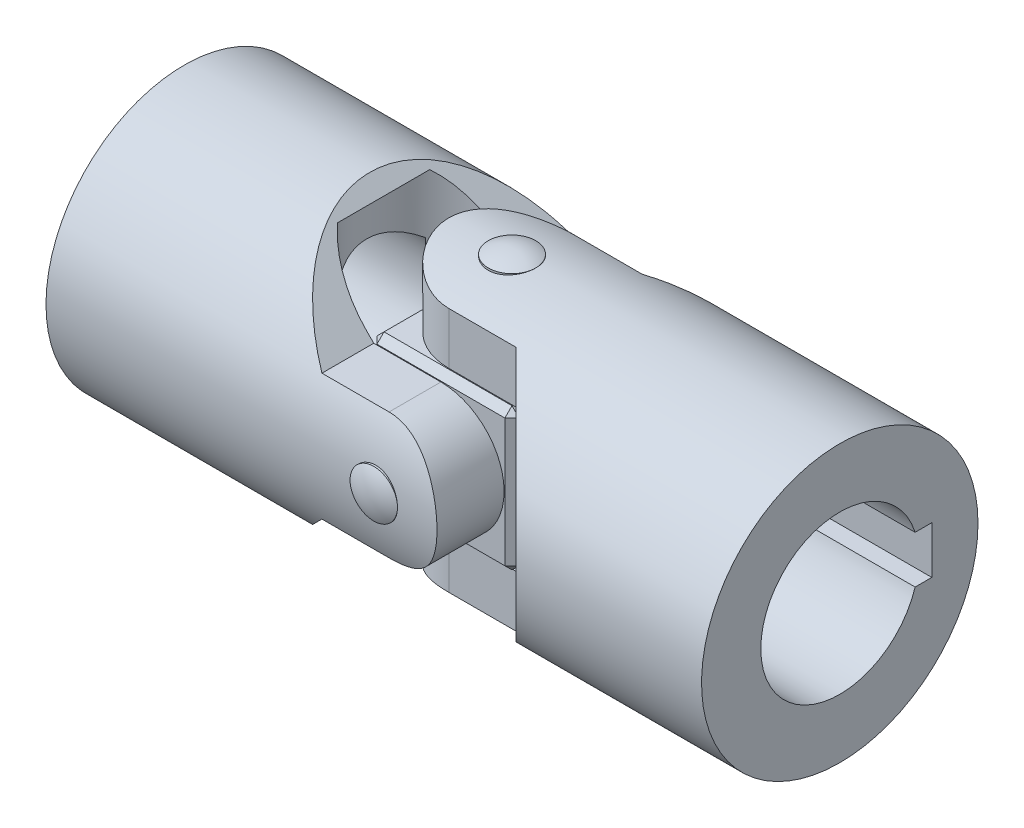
ISO-10303-21;
HEADER;
FILE_DESCRIPTION(('STEP AP214'),'2;1');
FILE_NAME('part.step','',(''),(''),'','','');
FILE_SCHEMA(('AUTOMOTIVE_DESIGN { 1 0 10303 214 1 1 1 1 }'));
ENDSEC;
DATA;
#1=APPLICATION_CONTEXT('core data for automotive mechanical design processes');
#2=APPLICATION_PROTOCOL_DEFINITION('international standard','automotive_design',2000,#1);
#3=PRODUCT_CONTEXT('',#1,'mechanical');
#4=PRODUCT('Part','Part','',(#3));
#5=PRODUCT_RELATED_PRODUCT_CATEGORY('part','',(#4));
#6=PRODUCT_DEFINITION_FORMATION('','',#4);
#7=PRODUCT_DEFINITION_CONTEXT('part definition',#1,'design');
#8=PRODUCT_DEFINITION('design','',#6,#7);
#9=PRODUCT_DEFINITION_SHAPE('','',#8);
#10=(LENGTH_UNIT() NAMED_UNIT(*) SI_UNIT(.MILLI.,.METRE.));
#11=(NAMED_UNIT(*) PLANE_ANGLE_UNIT() SI_UNIT($,.RADIAN.));
#12=(NAMED_UNIT(*) SI_UNIT($,.STERADIAN.) SOLID_ANGLE_UNIT());
#13=UNCERTAINTY_MEASURE_WITH_UNIT(LENGTH_MEASURE(1.E-05),#10,'distance_accuracy_value','');
#14=(GEOMETRIC_REPRESENTATION_CONTEXT(3) GLOBAL_UNCERTAINTY_ASSIGNED_CONTEXT((#13)) GLOBAL_UNIT_ASSIGNED_CONTEXT((#10,
#11,#12)) REPRESENTATION_CONTEXT('',''));
#15=CARTESIAN_POINT('',(0.,0.,0.));
#16=DIRECTION('',(0.,0.,1.));
#17=DIRECTION('',(1.,0.,0.));
#18=AXIS2_PLACEMENT_3D('',#15,#16,#17);
#19=CARTESIAN_POINT('',(0.,35.,0.));
#20=DIRECTION('',(0.,-1.,0.));
#21=DIRECTION('',(-1.,0.,0.));
#22=AXIS2_PLACEMENT_3D('',#19,#20,#21);
#23=CYLINDRICAL_SURFACE('',#22,6.);
#24=CARTESIAN_POINT('',(0.,35.,0.));
#25=DIRECTION('',(0.,1.,0.));
#26=DIRECTION('',(1.,0.,0.));
#27=AXIS2_PLACEMENT_3D('',#24,#25,#26);
#28=CIRCLE('',#27,6.);
#29=CARTESIAN_POINT('',(6.,35.,0.));
#30=VERTEX_POINT('',#29);
#31=EDGE_CURVE('P0_E10',#30,#30,#28,.T.);
#32=ORIENTED_EDGE('',*,*,#31,.F.);
#33=EDGE_LOOP('',(#32));
#34=FACE_BOUND('',#33,.T.);
#35=CARTESIAN_POINT('',(0.,-35.,0.));
#36=DIRECTION('',(0.,1.,0.));
#37=DIRECTION('',(0.,0.,1.));
#38=AXIS2_PLACEMENT_3D('',#35,#36,#37);
#39=CIRCLE('',#38,6.);
#40=CARTESIAN_POINT('',(0.,-35.,6.));
#41=VERTEX_POINT('',#40);
#42=EDGE_CURVE('P0_E20',#41,#41,#39,.T.);
#43=ORIENTED_EDGE('',*,*,#42,.T.);
#44=EDGE_LOOP('',(#43));
#45=FACE_BOUND('',#44,.T.);
#46=ADVANCED_FACE('P0_F14',(#34,#45),#23,.T.);
#47=CARTESIAN_POINT('',(0.,23.4674374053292,0.));
#48=DIRECTION('',(0.,1.,0.));
#49=DIRECTION('',(0.,0.,-1.));
#50=AXIS2_PLACEMENT_3D('',#47,#48,#49);
#51=SPHERICAL_SURFACE('',#50,13.);
#52=ORIENTED_EDGE('',*,*,#31,.T.);
#53=EDGE_LOOP('',(#52));
#54=FACE_BOUND('',#53,.T.);
#55=ADVANCED_FACE('P0_F29',(#54),#51,.T.);
#56=CARTESIAN_POINT('',(0.,-23.4674374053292,0.));
#57=DIRECTION('',(0.,-1.,0.));
#58=DIRECTION('',(0.,0.,-1.));
#59=AXIS2_PLACEMENT_3D('',#56,#57,#58);
#60=SPHERICAL_SURFACE('',#59,13.);
#61=ORIENTED_EDGE('',*,*,#42,.F.);
#62=EDGE_LOOP('',(#61));
#63=FACE_BOUND('',#62,.T.);
#64=ADVANCED_FACE('P0_F27',(#63),#60,.T.);
#65=CLOSED_SHELL('',(#46,#55,#64));
#66=MANIFOLD_SOLID_BREP('P0_B1',#65);
#67=CARTESIAN_POINT('',(0.,0.,35.));
#68=DIRECTION('',(0.,0.,-1.));
#69=DIRECTION('',(-1.,0.,0.));
#70=AXIS2_PLACEMENT_3D('',#67,#68,#69);
#71=CYLINDRICAL_SURFACE('',#70,6.);
#72=CARTESIAN_POINT('',(0.,0.,35.));
#73=DIRECTION('',(0.,0.,1.));
#74=DIRECTION('',(1.,0.,0.));
#75=AXIS2_PLACEMENT_3D('',#72,#73,#74);
#76=CIRCLE('',#75,6.);
#77=CARTESIAN_POINT('',(6.,0.,35.));
#78=VERTEX_POINT('',#77);
#79=EDGE_CURVE('P1_E10',#78,#78,#76,.T.);
#80=ORIENTED_EDGE('',*,*,#79,.F.);
#81=EDGE_LOOP('',(#80));
#82=FACE_BOUND('',#81,.T.);
#83=CARTESIAN_POINT('',(0.,0.,-35.));
#84=DIRECTION('',(0.,0.,1.));
#85=DIRECTION('',(0.,-1.,0.));
#86=AXIS2_PLACEMENT_3D('',#83,#84,#85);
#87=CIRCLE('',#86,6.);
#88=CARTESIAN_POINT('',(0.,-6.,-35.));
#89=VERTEX_POINT('',#88);
#90=EDGE_CURVE('P1_E20',#89,#89,#87,.T.);
#91=ORIENTED_EDGE('',*,*,#90,.T.);
#92=EDGE_LOOP('',(#91));
#93=FACE_BOUND('',#92,.T.);
#94=ADVANCED_FACE('P1_F14',(#82,#93),#71,.T.);
#95=CARTESIAN_POINT('',(0.,0.,23.4674374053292));
#96=DIRECTION('',(0.,0.,1.));
#97=DIRECTION('',(0.,1.,0.));
#98=AXIS2_PLACEMENT_3D('',#95,#96,#97);
#99=SPHERICAL_SURFACE('',#98,13.);
#100=ORIENTED_EDGE('',*,*,#79,.T.);
#101=EDGE_LOOP('',(#100));
#102=FACE_BOUND('',#101,.T.);
#103=ADVANCED_FACE('P1_F29',(#102),#99,.T.);
#104=CARTESIAN_POINT('',(0.,0.,-23.4674374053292));
#105=DIRECTION('',(0.,0.,-1.));
#106=DIRECTION('',(0.,1.,0.));
#107=AXIS2_PLACEMENT_3D('',#104,#105,#106);
#108=SPHERICAL_SURFACE('',#107,13.);
#109=ORIENTED_EDGE('',*,*,#90,.F.);
#110=EDGE_LOOP('',(#109));
#111=FACE_BOUND('',#110,.T.);
#112=ADVANCED_FACE('P1_F27',(#111),#108,.T.);
#113=CLOSED_SHELL('',(#94,#103,#112));
#114=MANIFOLD_SOLID_BREP('P1_B1',#113);
#115=CARTESIAN_POINT('',(0.,0.,18.));
#116=DIRECTION('',(0.,0.,-1.));
#117=DIRECTION('',(-1.,0.,0.));
#118=AXIS2_PLACEMENT_3D('',#115,#116,#117);
#119=CYLINDRICAL_SURFACE('',#118,6.);
#120=CARTESIAN_POINT('',(0.,0.,0.));
#121=DIRECTION('',(0.,0.707106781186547,-0.707106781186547));
#122=DIRECTION('',(0.,-0.707106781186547,-0.707106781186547));
#123=AXIS2_PLACEMENT_3D('',#120,#121,#122);
#124=ELLIPSE('',#123,8.48528137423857,6.);
#125=CARTESIAN_POINT('',(6.,0.,0.));
#126=VERTEX_POINT('',#125);
#127=CARTESIAN_POINT('',(-6.,0.,0.));
#128=VERTEX_POINT('',#127);
#129=EDGE_CURVE('P2_E116',#126,#128,#124,.F.);
#130=ORIENTED_EDGE('',*,*,#129,.F.);
#131=CARTESIAN_POINT('',(0.,0.,0.));
#132=DIRECTION('',(0.,-0.707106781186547,-0.707106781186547));
#133=DIRECTION('',(0.,0.707106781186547,-0.707106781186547));
#134=AXIS2_PLACEMENT_3D('',#131,#132,#133);
#135=ELLIPSE('',#134,8.48528137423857,6.);
#136=EDGE_CURVE('P2_E120',#128,#126,#135,.F.);
#137=ORIENTED_EDGE('',*,*,#136,.F.);
#138=EDGE_LOOP('',(#130,#137));
#139=FACE_BOUND('',#138,.T.);
#140=CARTESIAN_POINT('',(0.,0.,18.));
#141=DIRECTION('',(0.,0.,1.));
#142=DIRECTION('',(1.,0.,0.));
#143=AXIS2_PLACEMENT_3D('',#140,#141,#142);
#144=CIRCLE('',#143,6.);
#145=CARTESIAN_POINT('',(6.,0.,18.));
#146=VERTEX_POINT('',#145);
#147=EDGE_CURVE('P2_E127',#146,#146,#144,.T.);
#148=ORIENTED_EDGE('',*,*,#147,.T.);
#149=EDGE_LOOP('',(#148));
#150=FACE_BOUND('',#149,.T.);
#151=ADVANCED_FACE('P2_F16',(#139,#150),#119,.F.);
#152=CARTESIAN_POINT('',(18.,18.,18.));
#153=DIRECTION('',(0.,0.,1.));
#154=DIRECTION('',(1.,0.,0.));
#155=AXIS2_PLACEMENT_3D('',#152,#153,#154);
#156=PLANE('',#155);
#157=DIRECTION('',(0.,-1.,0.));
#158=VECTOR('',#157,1.);
#159=CARTESIAN_POINT('',(-16.2,-18.,18.));
#160=LINE('',#159,#158);
#161=CARTESIAN_POINT('',(-16.2,16.2,18.));
#162=VERTEX_POINT('',#161);
#163=CARTESIAN_POINT('',(-16.2,-16.2,18.));
#164=VERTEX_POINT('',#163);
#165=EDGE_CURVE('P2_E164',#162,#164,#160,.T.);
#166=ORIENTED_EDGE('',*,*,#165,.T.);
#167=DIRECTION('',(1.,0.,0.));
#168=VECTOR('',#167,1.);
#169=CARTESIAN_POINT('',(18.,-16.2,18.));
#170=LINE('',#169,#168);
#171=CARTESIAN_POINT('',(16.2,-16.2,18.));
#172=VERTEX_POINT('',#171);
#173=EDGE_CURVE('P2_E168',#164,#172,#170,.T.);
#174=ORIENTED_EDGE('',*,*,#173,.T.);
#175=DIRECTION('',(0.,1.,0.));
#176=VECTOR('',#175,1.);
#177=CARTESIAN_POINT('',(16.2,18.,18.));
#178=LINE('',#177,#176);
#179=CARTESIAN_POINT('',(16.2,16.2,18.));
#180=VERTEX_POINT('',#179);
#181=EDGE_CURVE('P2_E166',#172,#180,#178,.T.);
#182=ORIENTED_EDGE('',*,*,#181,.T.);
#183=DIRECTION('',(-1.,0.,0.));
#184=VECTOR('',#183,1.);
#185=CARTESIAN_POINT('',(-18.,16.2,18.));
#186=LINE('',#185,#184);
#187=EDGE_CURVE('P2_E162',#180,#162,#186,.T.);
#188=ORIENTED_EDGE('',*,*,#187,.T.);
#189=EDGE_LOOP('',(#166,#174,#182,#188));
#190=FACE_BOUND('',#189,.T.);
#191=ORIENTED_EDGE('',*,*,#147,.F.);
#192=EDGE_LOOP('',(#191));
#193=FACE_BOUND('',#192,.T.);
#194=ADVANCED_FACE('P2_F282',(#190,#193),#156,.T.);
#195=CARTESIAN_POINT('',(18.,18.,-18.));
#196=DIRECTION('',(0.,0.,1.));
#197=DIRECTION('',(1.,0.,0.));
#198=AXIS2_PLACEMENT_3D('',#195,#196,#197);
#199=PLANE('',#198);
#200=DIRECTION('',(-1.,0.,0.));
#201=VECTOR('',#200,1.);
#202=CARTESIAN_POINT('',(18.,-16.2,-18.));
#203=LINE('',#202,#201);
#204=CARTESIAN_POINT('',(16.2,-16.2,-18.));
#205=VERTEX_POINT('',#204);
#206=CARTESIAN_POINT('',(-16.2,-16.2,-18.));
#207=VERTEX_POINT('',#206);
#208=EDGE_CURVE('P2_E157',#205,#207,#203,.T.);
#209=ORIENTED_EDGE('',*,*,#208,.T.);
#210=DIRECTION('',(0.,1.,0.));
#211=VECTOR('',#210,1.);
#212=CARTESIAN_POINT('',(-16.2,18.,-18.));
#213=LINE('',#212,#211);
#214=CARTESIAN_POINT('',(-16.2,16.2,-18.));
#215=VERTEX_POINT('',#214);
#216=EDGE_CURVE('P2_E159',#207,#215,#213,.T.);
#217=ORIENTED_EDGE('',*,*,#216,.T.);
#218=DIRECTION('',(1.,0.,0.));
#219=VECTOR('',#218,1.);
#220=CARTESIAN_POINT('',(18.,16.2,-18.));
#221=LINE('',#220,#219);
#222=CARTESIAN_POINT('',(16.2,16.2,-18.));
#223=VERTEX_POINT('',#222);
#224=EDGE_CURVE('P2_E153',#215,#223,#221,.T.);
#225=ORIENTED_EDGE('',*,*,#224,.T.);
#226=DIRECTION('',(0.,-1.,0.));
#227=VECTOR('',#226,1.);
#228=CARTESIAN_POINT('',(16.2,18.,-18.));
#229=LINE('',#228,#227);
#230=EDGE_CURVE('P2_E155',#223,#205,#229,.T.);
#231=ORIENTED_EDGE('',*,*,#230,.T.);
#232=EDGE_LOOP('',(#209,#217,#225,#231));
#233=FACE_BOUND('',#232,.T.);
#234=CARTESIAN_POINT('',(0.,0.,-18.));
#235=DIRECTION('',(0.,0.,1.));
#236=DIRECTION('',(1.,0.,0.));
#237=AXIS2_PLACEMENT_3D('',#234,#235,#236);
#238=CIRCLE('',#237,6.);
#239=CARTESIAN_POINT('',(6.,0.,-18.));
#240=VERTEX_POINT('',#239);
#241=EDGE_CURVE('P2_E259',#240,#240,#238,.T.);
#242=ORIENTED_EDGE('',*,*,#241,.T.);
#243=EDGE_LOOP('',(#242));
#244=FACE_BOUND('',#243,.T.);
#245=ADVANCED_FACE('P2_F267',(#233,#244),#199,.F.);
#246=CARTESIAN_POINT('',(-18.,18.,18.));
#247=DIRECTION('',(0.,-1.,0.));
#248=DIRECTION('',(0.,0.,-1.));
#249=AXIS2_PLACEMENT_3D('',#246,#247,#248);
#250=PLANE('',#249);
#251=DIRECTION('',(-1.,0.,0.));
#252=VECTOR('',#251,1.);
#253=CARTESIAN_POINT('',(-18.,18.,-16.2));
#254=LINE('',#253,#252);
#255=CARTESIAN_POINT('',(16.2,18.,-16.2));
#256=VERTEX_POINT('',#255);
#257=CARTESIAN_POINT('',(-16.2,18.,-16.2));
#258=VERTEX_POINT('',#257);
#259=EDGE_CURVE('P2_E25',#256,#258,#254,.T.);
#260=ORIENTED_EDGE('',*,*,#259,.T.);
#261=DIRECTION('',(0.,0.,1.));
#262=VECTOR('',#261,1.);
#263=CARTESIAN_POINT('',(-16.2,18.,18.));
#264=LINE('',#263,#262);
#265=CARTESIAN_POINT('',(-16.2,18.,16.2));
#266=VERTEX_POINT('',#265);
#267=EDGE_CURVE('P2_E11',#258,#266,#264,.T.);
#268=ORIENTED_EDGE('',*,*,#267,.T.);
#269=DIRECTION('',(1.,0.,0.));
#270=VECTOR('',#269,1.);
#271=CARTESIAN_POINT('',(18.,18.,16.2));
#272=LINE('',#271,#270);
#273=CARTESIAN_POINT('',(16.2,18.,16.2));
#274=VERTEX_POINT('',#273);
#275=EDGE_CURVE('P2_E180',#266,#274,#272,.T.);
#276=ORIENTED_EDGE('',*,*,#275,.T.);
#277=DIRECTION('',(0.,0.,-1.));
#278=VECTOR('',#277,1.);
#279=CARTESIAN_POINT('',(16.2,18.,18.));
#280=LINE('',#279,#278);
#281=EDGE_CURVE('P2_E36',#274,#256,#280,.T.);
#282=ORIENTED_EDGE('',*,*,#281,.T.);
#283=EDGE_LOOP('',(#260,#268,#276,#282));
#284=FACE_BOUND('',#283,.T.);
#285=CARTESIAN_POINT('',(0.,18.,0.));
#286=DIRECTION('',(0.,1.,0.));
#287=DIRECTION('',(0.,0.,1.));
#288=AXIS2_PLACEMENT_3D('',#285,#286,#287);
#289=CIRCLE('',#288,6.);
#290=CARTESIAN_POINT('',(0.,18.,6.));
#291=VERTEX_POINT('',#290);
#292=EDGE_CURVE('P2_E249',#291,#291,#289,.T.);
#293=ORIENTED_EDGE('',*,*,#292,.F.);
#294=EDGE_LOOP('',(#293));
#295=FACE_BOUND('',#294,.T.);
#296=ADVANCED_FACE('P2_F290',(#284,#295),#250,.F.);
#297=CARTESIAN_POINT('',(-18.,-18.,18.));
#298=DIRECTION('',(1.,0.,0.));
#299=DIRECTION('',(0.,0.,-1.));
#300=AXIS2_PLACEMENT_3D('',#297,#298,#299);
#301=PLANE('',#300);
#302=DIRECTION('',(0.,-1.,0.));
#303=VECTOR('',#302,1.);
#304=CARTESIAN_POINT('',(-18.,-18.,-16.2));
#305=LINE('',#304,#303);
#306=CARTESIAN_POINT('',(-18.,16.2,-16.2));
#307=VERTEX_POINT('',#306);
#308=CARTESIAN_POINT('',(-18.,-16.2,-16.2));
#309=VERTEX_POINT('',#308);
#310=EDGE_CURVE('P2_E148',#307,#309,#305,.T.);
#311=ORIENTED_EDGE('',*,*,#310,.T.);
#312=DIRECTION('',(0.,0.,1.));
#313=VECTOR('',#312,1.);
#314=CARTESIAN_POINT('',(-18.,-16.2,18.));
#315=LINE('',#314,#313);
#316=CARTESIAN_POINT('',(-18.,-16.2,16.2));
#317=VERTEX_POINT('',#316);
#318=EDGE_CURVE('P2_E150',#309,#317,#315,.T.);
#319=ORIENTED_EDGE('',*,*,#318,.T.);
#320=DIRECTION('',(0.,1.,0.));
#321=VECTOR('',#320,1.);
#322=CARTESIAN_POINT('',(-18.,18.,16.2));
#323=LINE('',#322,#321);
#324=CARTESIAN_POINT('',(-18.,16.2,16.2));
#325=VERTEX_POINT('',#324);
#326=EDGE_CURVE('P2_E146',#317,#325,#323,.T.);
#327=ORIENTED_EDGE('',*,*,#326,.T.);
#328=DIRECTION('',(0.,0.,-1.));
#329=VECTOR('',#328,1.);
#330=CARTESIAN_POINT('',(-18.,16.2,18.));
#331=LINE('',#330,#329);
#332=EDGE_CURVE('P2_E144',#325,#307,#331,.T.);
#333=ORIENTED_EDGE('',*,*,#332,.T.);
#334=EDGE_LOOP('',(#311,#319,#327,#333));
#335=FACE_BOUND('',#334,.T.);
#336=ADVANCED_FACE('P2_F297',(#335),#301,.F.);
#337=CARTESIAN_POINT('',(-18.,-18.,18.));
#338=DIRECTION('',(0.,1.,0.));
#339=DIRECTION('',(0.,0.,1.));
#340=AXIS2_PLACEMENT_3D('',#337,#338,#339);
#341=PLANE('',#340);
#342=DIRECTION('',(-1.,0.,0.));
#343=VECTOR('',#342,1.);
#344=CARTESIAN_POINT('',(-18.,-18.,16.2));
#345=LINE('',#344,#343);
#346=CARTESIAN_POINT('',(16.2,-18.,16.2));
#347=VERTEX_POINT('',#346);
#348=CARTESIAN_POINT('',(-16.2,-18.,16.2));
#349=VERTEX_POINT('',#348);
#350=EDGE_CURVE('P2_E137',#347,#349,#345,.T.);
#351=ORIENTED_EDGE('',*,*,#350,.T.);
#352=DIRECTION('',(0.,0.,-1.));
#353=VECTOR('',#352,1.);
#354=CARTESIAN_POINT('',(-16.2,-18.,18.));
#355=LINE('',#354,#353);
#356=CARTESIAN_POINT('',(-16.2,-18.,-16.2));
#357=VERTEX_POINT('',#356);
#358=EDGE_CURVE('P2_E141',#349,#357,#355,.T.);
#359=ORIENTED_EDGE('',*,*,#358,.T.);
#360=DIRECTION('',(1.,0.,0.));
#361=VECTOR('',#360,1.);
#362=CARTESIAN_POINT('',(-18.,-18.,-16.2));
#363=LINE('',#362,#361);
#364=CARTESIAN_POINT('',(16.2,-18.,-16.2));
#365=VERTEX_POINT('',#364);
#366=EDGE_CURVE('P2_E139',#357,#365,#363,.T.);
#367=ORIENTED_EDGE('',*,*,#366,.T.);
#368=DIRECTION('',(0.,0.,1.));
#369=VECTOR('',#368,1.);
#370=CARTESIAN_POINT('',(16.2,-18.,18.));
#371=LINE('',#370,#369);
#372=EDGE_CURVE('P2_E130',#365,#347,#371,.T.);
#373=ORIENTED_EDGE('',*,*,#372,.T.);
#374=EDGE_LOOP('',(#351,#359,#367,#373));
#375=FACE_BOUND('',#374,.T.);
#376=CARTESIAN_POINT('',(0.,-18.,0.));
#377=DIRECTION('',(0.,1.,0.));
#378=DIRECTION('',(0.,0.,1.));
#379=AXIS2_PLACEMENT_3D('',#376,#377,#378);
#380=CIRCLE('',#379,6.);
#381=CARTESIAN_POINT('',(0.,-18.,6.));
#382=VERTEX_POINT('',#381);
#383=EDGE_CURVE('P2_E255',#382,#382,#380,.T.);
#384=ORIENTED_EDGE('',*,*,#383,.T.);
#385=EDGE_LOOP('',(#384));
#386=FACE_BOUND('',#385,.T.);
#387=ADVANCED_FACE('P2_F277',(#375,#386),#341,.F.);
#388=CARTESIAN_POINT('',(18.,-18.,18.));
#389=DIRECTION('',(-1.,0.,0.));
#390=DIRECTION('',(0.,0.,1.));
#391=AXIS2_PLACEMENT_3D('',#388,#389,#390);
#392=PLANE('',#391);
#393=DIRECTION('',(0.,-1.,0.));
#394=VECTOR('',#393,1.);
#395=CARTESIAN_POINT('',(18.,-18.,16.2));
#396=LINE('',#395,#394);
#397=CARTESIAN_POINT('',(18.,16.2,16.2));
#398=VERTEX_POINT('',#397);
#399=CARTESIAN_POINT('',(18.,-16.2,16.2));
#400=VERTEX_POINT('',#399);
#401=EDGE_CURVE('P2_E173',#398,#400,#396,.T.);
#402=ORIENTED_EDGE('',*,*,#401,.T.);
#403=DIRECTION('',(0.,0.,-1.));
#404=VECTOR('',#403,1.);
#405=CARTESIAN_POINT('',(18.,-16.2,18.));
#406=LINE('',#405,#404);
#407=CARTESIAN_POINT('',(18.,-16.2,-16.2));
#408=VERTEX_POINT('',#407);
#409=EDGE_CURVE('P2_E177',#400,#408,#406,.T.);
#410=ORIENTED_EDGE('',*,*,#409,.T.);
#411=DIRECTION('',(0.,1.,0.));
#412=VECTOR('',#411,1.);
#413=CARTESIAN_POINT('',(18.,-18.,-16.2));
#414=LINE('',#413,#412);
#415=CARTESIAN_POINT('',(18.,16.2,-16.2));
#416=VERTEX_POINT('',#415);
#417=EDGE_CURVE('P2_E175',#408,#416,#414,.T.);
#418=ORIENTED_EDGE('',*,*,#417,.T.);
#419=DIRECTION('',(0.,0.,1.));
#420=VECTOR('',#419,1.);
#421=CARTESIAN_POINT('',(18.,16.2,18.));
#422=LINE('',#421,#420);
#423=EDGE_CURVE('P2_E171',#416,#398,#422,.T.);
#424=ORIENTED_EDGE('',*,*,#423,.T.);
#425=EDGE_LOOP('',(#402,#410,#418,#424));
#426=FACE_BOUND('',#425,.T.);
#427=ADVANCED_FACE('P2_F269',(#426),#392,.F.);
#428=CARTESIAN_POINT('',(0.,0.,0.));
#429=DIRECTION('',(0.,0.707106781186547,-0.707106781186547));
#430=DIRECTION('',(0.,-0.707106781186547,-0.707106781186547));
#431=AXIS2_PLACEMENT_3D('',#428,#429,#430);
#432=ELLIPSE('',#431,8.48528137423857,6.);
#433=EDGE_CURVE('P2_E119',#126,#128,#432,.T.);
#434=ORIENTED_EDGE('',*,*,#433,.F.);
#435=CARTESIAN_POINT('',(0.,0.,0.));
#436=DIRECTION('',(0.,-0.707106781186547,-0.707106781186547));
#437=DIRECTION('',(0.,0.707106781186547,-0.707106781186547));
#438=AXIS2_PLACEMENT_3D('',#435,#436,#437);
#439=ELLIPSE('',#438,8.48528137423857,6.);
#440=EDGE_CURVE('P2_E111',#128,#126,#439,.T.);
#441=ORIENTED_EDGE('',*,*,#440,.F.);
#442=EDGE_LOOP('',(#434,#441));
#443=FACE_BOUND('',#442,.T.);
#444=ORIENTED_EDGE('',*,*,#241,.F.);
#445=EDGE_LOOP('',(#444));
#446=FACE_BOUND('',#445,.T.);
#447=ADVANCED_FACE('P2_F132',(#443,#446),#119,.F.);
#448=CARTESIAN_POINT('',(0.,-18.,0.));
#449=DIRECTION('',(0.,1.,0.));
#450=DIRECTION('',(0.,0.,1.));
#451=AXIS2_PLACEMENT_3D('',#448,#449,#450);
#452=CYLINDRICAL_SURFACE('',#451,6.);
#453=ORIENTED_EDGE('',*,*,#433,.T.);
#454=ORIENTED_EDGE('',*,*,#136,.T.);
#455=EDGE_LOOP('',(#453,#454));
#456=FACE_BOUND('',#455,.T.);
#457=ORIENTED_EDGE('',*,*,#383,.F.);
#458=EDGE_LOOP('',(#457));
#459=FACE_BOUND('',#458,.T.);
#460=ADVANCED_FACE('P2_F124',(#456,#459),#452,.F.);
#461=ORIENTED_EDGE('',*,*,#129,.T.);
#462=ORIENTED_EDGE('',*,*,#440,.T.);
#463=EDGE_LOOP('',(#461,#462));
#464=FACE_BOUND('',#463,.T.);
#465=ORIENTED_EDGE('',*,*,#292,.T.);
#466=EDGE_LOOP('',(#465));
#467=FACE_BOUND('',#466,.T.);
#468=ADVANCED_FACE('P2_F113',(#464,#467),#452,.F.);
#469=CARTESIAN_POINT('',(16.2,18.,18.));
#470=DIRECTION('',(-0.707106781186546,-0.707106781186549,0.));
#471=DIRECTION('',(0.707106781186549,-0.707106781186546,0.));
#472=AXIS2_PLACEMENT_3D('',#469,#470,#471);
#473=PLANE('',#472);
#474=DIRECTION('',(0.707106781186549,-0.707106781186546,0.));
#475=VECTOR('',#474,1.);
#476=CARTESIAN_POINT('',(17.1,17.1,16.2));
#477=LINE('',#476,#475);
#478=EDGE_CURVE('P2_E20',#398,#274,#477,.F.);
#479=ORIENTED_EDGE('',*,*,#478,.F.);
#480=ORIENTED_EDGE('',*,*,#423,.F.);
#481=DIRECTION('',(-0.707106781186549,0.707106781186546,0.));
#482=VECTOR('',#481,1.);
#483=CARTESIAN_POINT('',(18.,16.2,-16.2));
#484=LINE('',#483,#482);
#485=EDGE_CURVE('P2_E243',#256,#416,#484,.F.);
#486=ORIENTED_EDGE('',*,*,#485,.F.);
#487=ORIENTED_EDGE('',*,*,#281,.F.);
#488=EDGE_LOOP('',(#479,#480,#486,#487));
#489=FACE_BOUND('',#488,.T.);
#490=ADVANCED_FACE('P2_F18',(#489),#473,.F.);
#491=CARTESIAN_POINT('',(16.2,16.2,18.));
#492=DIRECTION('',(0.577350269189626,0.577350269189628,0.577350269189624));
#493=DIRECTION('',(-0.707106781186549,0.707106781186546,0.));
#494=AXIS2_PLACEMENT_3D('',#491,#492,#493);
#495=PLANE('',#494);
#496=DIRECTION('',(0.707106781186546,0.,-0.707106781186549));
#497=VECTOR('',#496,1.);
#498=CARTESIAN_POINT('',(16.2,16.2,18.));
#499=LINE('',#498,#497);
#500=EDGE_CURVE('P2_E238',#398,#180,#499,.F.);
#501=ORIENTED_EDGE('',*,*,#500,.F.);
#502=ORIENTED_EDGE('',*,*,#478,.T.);
#503=DIRECTION('',(0.,-0.707106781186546,0.707106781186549));
#504=VECTOR('',#503,1.);
#505=CARTESIAN_POINT('',(16.2,16.2,18.));
#506=LINE('',#505,#504);
#507=EDGE_CURVE('P2_E241',#180,#274,#506,.F.);
#508=ORIENTED_EDGE('',*,*,#507,.F.);
#509=EDGE_LOOP('',(#501,#502,#508));
#510=FACE_BOUND('',#509,.T.);
#511=ADVANCED_FACE('P2_F374',(#510),#495,.T.);
#512=CARTESIAN_POINT('',(18.,16.2,-16.2));
#513=DIRECTION('',(0.577350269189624,0.577350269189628,-0.577350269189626));
#514=DIRECTION('',(0.,0.707106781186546,0.707106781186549));
#515=AXIS2_PLACEMENT_3D('',#512,#513,#514);
#516=PLANE('',#515);
#517=DIRECTION('',(0.,-0.707106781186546,-0.707106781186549));
#518=VECTOR('',#517,1.);
#519=CARTESIAN_POINT('',(16.2,17.1,-17.1));
#520=LINE('',#519,#518);
#521=EDGE_CURVE('P2_E232',#256,#223,#520,.T.);
#522=ORIENTED_EDGE('',*,*,#521,.F.);
#523=ORIENTED_EDGE('',*,*,#485,.T.);
#524=DIRECTION('',(0.707106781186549,0.,0.707106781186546));
#525=VECTOR('',#524,1.);
#526=CARTESIAN_POINT('',(18.,16.2,-16.2));
#527=LINE('',#526,#525);
#528=EDGE_CURVE('P2_E235',#223,#416,#527,.T.);
#529=ORIENTED_EDGE('',*,*,#528,.F.);
#530=EDGE_LOOP('',(#522,#523,#529));
#531=FACE_BOUND('',#530,.T.);
#532=ADVANCED_FACE('P2_F371',(#531),#516,.T.);
#533=CARTESIAN_POINT('',(18.,16.2,18.));
#534=DIRECTION('',(0.,0.707106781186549,0.707106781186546));
#535=DIRECTION('',(0.,-0.707106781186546,0.707106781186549));
#536=AXIS2_PLACEMENT_3D('',#533,#534,#535);
#537=PLANE('',#536);
#538=ORIENTED_EDGE('',*,*,#507,.T.);
#539=ORIENTED_EDGE('',*,*,#275,.F.);
#540=DIRECTION('',(0.,0.707106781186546,-0.707106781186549));
#541=VECTOR('',#540,1.);
#542=CARTESIAN_POINT('',(-16.2,17.1,17.1));
#543=LINE('',#542,#541);
#544=EDGE_CURVE('P2_E227',#162,#266,#543,.T.);
#545=ORIENTED_EDGE('',*,*,#544,.F.);
#546=ORIENTED_EDGE('',*,*,#187,.F.);
#547=EDGE_LOOP('',(#538,#539,#545,#546));
#548=FACE_BOUND('',#547,.T.);
#549=ADVANCED_FACE('P2_F367',(#548),#537,.T.);
#550=CARTESIAN_POINT('',(16.2,18.,18.));
#551=DIRECTION('',(0.707106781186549,0.,0.707106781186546));
#552=DIRECTION('',(0.707106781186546,0.,-0.707106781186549));
#553=AXIS2_PLACEMENT_3D('',#550,#551,#552);
#554=PLANE('',#553);
#555=ORIENTED_EDGE('',*,*,#500,.T.);
#556=ORIENTED_EDGE('',*,*,#181,.F.);
#557=DIRECTION('',(-0.707106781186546,0.,0.707106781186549));
#558=VECTOR('',#557,1.);
#559=CARTESIAN_POINT('',(16.2,-16.2,18.));
#560=LINE('',#559,#558);
#561=EDGE_CURVE('P2_E224',#400,#172,#560,.T.);
#562=ORIENTED_EDGE('',*,*,#561,.F.);
#563=ORIENTED_EDGE('',*,*,#401,.F.);
#564=EDGE_LOOP('',(#555,#556,#562,#563));
#565=FACE_BOUND('',#564,.T.);
#566=ADVANCED_FACE('P2_F363',(#565),#554,.T.);
#567=CARTESIAN_POINT('',(18.,-16.2,18.));
#568=DIRECTION('',(-0.707106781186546,0.707106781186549,0.));
#569=DIRECTION('',(-0.707106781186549,-0.707106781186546,0.));
#570=AXIS2_PLACEMENT_3D('',#567,#568,#569);
#571=PLANE('',#570);
#572=DIRECTION('',(0.707106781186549,0.707106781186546,0.));
#573=VECTOR('',#572,1.);
#574=CARTESIAN_POINT('',(16.2,-18.,-16.2));
#575=LINE('',#574,#573);
#576=EDGE_CURVE('P2_E218',#408,#365,#575,.F.);
#577=ORIENTED_EDGE('',*,*,#576,.F.);
#578=ORIENTED_EDGE('',*,*,#409,.F.);
#579=DIRECTION('',(-0.707106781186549,-0.707106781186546,0.));
#580=VECTOR('',#579,1.);
#581=CARTESIAN_POINT('',(17.1,-17.1,16.2));
#582=LINE('',#581,#580);
#583=EDGE_CURVE('P2_E221',#347,#400,#582,.F.);
#584=ORIENTED_EDGE('',*,*,#583,.F.);
#585=ORIENTED_EDGE('',*,*,#372,.F.);
#586=EDGE_LOOP('',(#577,#578,#584,#585));
#587=FACE_BOUND('',#586,.T.);
#588=ADVANCED_FACE('P2_F359',(#587),#571,.F.);
#589=CARTESIAN_POINT('',(18.,-18.,-16.2));
#590=DIRECTION('',(-0.707106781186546,0.,0.707106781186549));
#591=DIRECTION('',(0.707106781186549,0.,0.707106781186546));
#592=AXIS2_PLACEMENT_3D('',#589,#590,#591);
#593=PLANE('',#592);
#594=ORIENTED_EDGE('',*,*,#528,.T.);
#595=ORIENTED_EDGE('',*,*,#417,.F.);
#596=DIRECTION('',(-0.707106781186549,0.,-0.707106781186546));
#597=VECTOR('',#596,1.);
#598=CARTESIAN_POINT('',(17.1,-16.2,-17.1));
#599=LINE('',#598,#597);
#600=EDGE_CURVE('P2_E216',#205,#408,#599,.F.);
#601=ORIENTED_EDGE('',*,*,#600,.F.);
#602=ORIENTED_EDGE('',*,*,#230,.F.);
#603=EDGE_LOOP('',(#594,#595,#601,#602));
#604=FACE_BOUND('',#603,.T.);
#605=ADVANCED_FACE('P2_F355',(#604),#593,.F.);
#606=CARTESIAN_POINT('',(-18.,18.,-16.2));
#607=DIRECTION('',(0.,-0.707106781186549,0.707106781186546));
#608=DIRECTION('',(0.,-0.707106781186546,-0.707106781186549));
#609=AXIS2_PLACEMENT_3D('',#606,#607,#608);
#610=PLANE('',#609);
#611=ORIENTED_EDGE('',*,*,#521,.T.);
#612=ORIENTED_EDGE('',*,*,#224,.F.);
#613=DIRECTION('',(0.,0.707106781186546,0.707106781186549));
#614=VECTOR('',#613,1.);
#615=CARTESIAN_POINT('',(-16.2,16.2,-18.));
#616=LINE('',#615,#614);
#617=EDGE_CURVE('P2_E213',#258,#215,#616,.F.);
#618=ORIENTED_EDGE('',*,*,#617,.F.);
#619=ORIENTED_EDGE('',*,*,#259,.F.);
#620=EDGE_LOOP('',(#611,#612,#618,#619));
#621=FACE_BOUND('',#620,.T.);
#622=ADVANCED_FACE('P2_F351',(#621),#610,.F.);
#623=CARTESIAN_POINT('',(-18.,16.2,18.));
#624=DIRECTION('',(0.707106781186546,-0.707106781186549,0.));
#625=DIRECTION('',(0.707106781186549,0.707106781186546,0.));
#626=AXIS2_PLACEMENT_3D('',#623,#624,#625);
#627=PLANE('',#626);
#628=DIRECTION('',(0.707106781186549,0.707106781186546,0.));
#629=VECTOR('',#628,1.);
#630=CARTESIAN_POINT('',(-18.,16.2,16.2));
#631=LINE('',#630,#629);
#632=EDGE_CURVE('P2_E229',#266,#325,#631,.F.);
#633=ORIENTED_EDGE('',*,*,#632,.F.);
#634=ORIENTED_EDGE('',*,*,#267,.F.);
#635=DIRECTION('',(-0.707106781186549,-0.707106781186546,0.));
#636=VECTOR('',#635,1.);
#637=CARTESIAN_POINT('',(-17.1,17.1,-16.2));
#638=LINE('',#637,#636);
#639=EDGE_CURVE('P2_E210',#307,#258,#638,.F.);
#640=ORIENTED_EDGE('',*,*,#639,.F.);
#641=ORIENTED_EDGE('',*,*,#332,.F.);
#642=EDGE_LOOP('',(#633,#634,#640,#641));
#643=FACE_BOUND('',#642,.T.);
#644=ADVANCED_FACE('P2_F347',(#643),#627,.F.);
#645=CARTESIAN_POINT('',(-18.,16.2,16.2));
#646=DIRECTION('',(-0.577350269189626,0.577350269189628,0.577350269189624));
#647=DIRECTION('',(-0.707106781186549,-0.707106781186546,0.));
#648=AXIS2_PLACEMENT_3D('',#645,#646,#647);
#649=PLANE('',#648);
#650=ORIENTED_EDGE('',*,*,#544,.T.);
#651=ORIENTED_EDGE('',*,*,#632,.T.);
#652=DIRECTION('',(0.707106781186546,0.,0.707106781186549));
#653=VECTOR('',#652,1.);
#654=CARTESIAN_POINT('',(-18.,16.2,16.2));
#655=LINE('',#654,#653);
#656=EDGE_CURVE('P2_E207',#162,#325,#655,.F.);
#657=ORIENTED_EDGE('',*,*,#656,.F.);
#658=EDGE_LOOP('',(#650,#651,#657));
#659=FACE_BOUND('',#658,.T.);
#660=ADVANCED_FACE('P2_F343',(#659),#649,.T.);
#661=CARTESIAN_POINT('',(16.2,-16.2,18.));
#662=DIRECTION('',(0.577350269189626,-0.577350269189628,0.577350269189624));
#663=DIRECTION('',(0.707106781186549,0.707106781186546,0.));
#664=AXIS2_PLACEMENT_3D('',#661,#662,#663);
#665=PLANE('',#664);
#666=ORIENTED_EDGE('',*,*,#583,.T.);
#667=ORIENTED_EDGE('',*,*,#561,.T.);
#668=DIRECTION('',(0.,-0.707106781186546,-0.707106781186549));
#669=VECTOR('',#668,1.);
#670=CARTESIAN_POINT('',(16.2,-16.2,18.));
#671=LINE('',#670,#669);
#672=EDGE_CURVE('P2_E205',#347,#172,#671,.F.);
#673=ORIENTED_EDGE('',*,*,#672,.F.);
#674=EDGE_LOOP('',(#666,#667,#673));
#675=FACE_BOUND('',#674,.T.);
#676=ADVANCED_FACE('P2_F339',(#675),#665,.T.);
#677=CARTESIAN_POINT('',(16.2,-18.,-16.2));
#678=DIRECTION('',(0.577350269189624,-0.577350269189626,-0.577350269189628));
#679=DIRECTION('',(0.,0.707106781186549,-0.707106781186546));
#680=AXIS2_PLACEMENT_3D('',#677,#678,#679);
#681=PLANE('',#680);
#682=ORIENTED_EDGE('',*,*,#600,.T.);
#683=ORIENTED_EDGE('',*,*,#576,.T.);
#684=DIRECTION('',(0.,-0.707106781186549,0.707106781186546));
#685=VECTOR('',#684,1.);
#686=CARTESIAN_POINT('',(16.2,-18.,-16.2));
#687=LINE('',#686,#685);
#688=EDGE_CURVE('P2_E202',#205,#365,#687,.T.);
#689=ORIENTED_EDGE('',*,*,#688,.F.);
#690=EDGE_LOOP('',(#682,#683,#689));
#691=FACE_BOUND('',#690,.T.);
#692=ADVANCED_FACE('P2_F335',(#691),#681,.T.);
#693=CARTESIAN_POINT('',(-16.2,16.2,-18.));
#694=DIRECTION('',(-0.577350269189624,0.577350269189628,-0.577350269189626));
#695=DIRECTION('',(0.,0.707106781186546,0.707106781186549));
#696=AXIS2_PLACEMENT_3D('',#693,#694,#695);
#697=PLANE('',#696);
#698=ORIENTED_EDGE('',*,*,#639,.T.);
#699=ORIENTED_EDGE('',*,*,#617,.T.);
#700=DIRECTION('',(0.707106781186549,0.,-0.707106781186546));
#701=VECTOR('',#700,1.);
#702=CARTESIAN_POINT('',(-16.2,16.2,-18.));
#703=LINE('',#702,#701);
#704=EDGE_CURVE('P2_E200',#307,#215,#703,.T.);
#705=ORIENTED_EDGE('',*,*,#704,.F.);
#706=EDGE_LOOP('',(#698,#699,#705));
#707=FACE_BOUND('',#706,.T.);
#708=ADVANCED_FACE('P2_F331',(#707),#697,.T.);
#709=CARTESIAN_POINT('',(-16.2,18.,18.));
#710=DIRECTION('',(-0.707106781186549,0.,0.707106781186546));
#711=DIRECTION('',(0.707106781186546,0.,0.707106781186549));
#712=AXIS2_PLACEMENT_3D('',#709,#710,#711);
#713=PLANE('',#712);
#714=ORIENTED_EDGE('',*,*,#656,.T.);
#715=ORIENTED_EDGE('',*,*,#326,.F.);
#716=DIRECTION('',(-0.707106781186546,0.,-0.707106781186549));
#717=VECTOR('',#716,1.);
#718=CARTESIAN_POINT('',(-18.,-16.2,16.2));
#719=LINE('',#718,#717);
#720=EDGE_CURVE('P2_E197',#164,#317,#719,.T.);
#721=ORIENTED_EDGE('',*,*,#720,.F.);
#722=ORIENTED_EDGE('',*,*,#165,.F.);
#723=EDGE_LOOP('',(#714,#715,#721,#722));
#724=FACE_BOUND('',#723,.T.);
#725=ADVANCED_FACE('P2_F327',(#724),#713,.T.);
#726=CARTESIAN_POINT('',(18.,-16.2,18.));
#727=DIRECTION('',(0.,-0.707106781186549,0.707106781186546));
#728=DIRECTION('',(0.,-0.707106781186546,-0.707106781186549));
#729=AXIS2_PLACEMENT_3D('',#726,#727,#728);
#730=PLANE('',#729);
#731=ORIENTED_EDGE('',*,*,#672,.T.);
#732=ORIENTED_EDGE('',*,*,#173,.F.);
#733=DIRECTION('',(0.,0.707106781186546,0.707106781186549));
#734=VECTOR('',#733,1.);
#735=CARTESIAN_POINT('',(-16.2,-17.1,17.1));
#736=LINE('',#735,#734);
#737=EDGE_CURVE('P2_E194',#349,#164,#736,.T.);
#738=ORIENTED_EDGE('',*,*,#737,.F.);
#739=ORIENTED_EDGE('',*,*,#350,.F.);
#740=EDGE_LOOP('',(#731,#732,#738,#739));
#741=FACE_BOUND('',#740,.T.);
#742=ADVANCED_FACE('P2_F323',(#741),#730,.T.);
#743=CARTESIAN_POINT('',(-18.,-18.,-16.2));
#744=DIRECTION('',(0.,0.707106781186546,0.707106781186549));
#745=DIRECTION('',(0.,-0.707106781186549,0.707106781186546));
#746=AXIS2_PLACEMENT_3D('',#743,#744,#745);
#747=PLANE('',#746);
#748=ORIENTED_EDGE('',*,*,#688,.T.);
#749=ORIENTED_EDGE('',*,*,#366,.F.);
#750=DIRECTION('',(0.,0.707106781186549,-0.707106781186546));
#751=VECTOR('',#750,1.);
#752=CARTESIAN_POINT('',(-16.2,-18.,-16.2));
#753=LINE('',#752,#751);
#754=EDGE_CURVE('P2_E191',#207,#357,#753,.F.);
#755=ORIENTED_EDGE('',*,*,#754,.F.);
#756=ORIENTED_EDGE('',*,*,#208,.F.);
#757=EDGE_LOOP('',(#748,#749,#755,#756));
#758=FACE_BOUND('',#757,.T.);
#759=ADVANCED_FACE('P2_F319',(#758),#747,.F.);
#760=CARTESIAN_POINT('',(-18.,-18.,-16.2));
#761=DIRECTION('',(0.707106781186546,0.,0.707106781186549));
#762=DIRECTION('',(0.707106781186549,0.,-0.707106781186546));
#763=AXIS2_PLACEMENT_3D('',#760,#761,#762);
#764=PLANE('',#763);
#765=ORIENTED_EDGE('',*,*,#704,.T.);
#766=ORIENTED_EDGE('',*,*,#216,.F.);
#767=DIRECTION('',(-0.707106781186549,0.,0.707106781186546));
#768=VECTOR('',#767,1.);
#769=CARTESIAN_POINT('',(-17.1,-16.2,-17.1));
#770=LINE('',#769,#768);
#771=EDGE_CURVE('P2_E188',#309,#207,#770,.F.);
#772=ORIENTED_EDGE('',*,*,#771,.F.);
#773=ORIENTED_EDGE('',*,*,#310,.F.);
#774=EDGE_LOOP('',(#765,#766,#772,#773));
#775=FACE_BOUND('',#774,.T.);
#776=ADVANCED_FACE('P2_F315',(#775),#764,.F.);
#777=CARTESIAN_POINT('',(-18.,-16.2,16.2));
#778=DIRECTION('',(-0.577350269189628,-0.577350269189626,0.577350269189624));
#779=DIRECTION('',(0.707106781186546,-0.707106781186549,0.));
#780=AXIS2_PLACEMENT_3D('',#777,#778,#779);
#781=PLANE('',#780);
#782=ORIENTED_EDGE('',*,*,#737,.T.);
#783=ORIENTED_EDGE('',*,*,#720,.T.);
#784=DIRECTION('',(-0.707106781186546,0.707106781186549,0.));
#785=VECTOR('',#784,1.);
#786=CARTESIAN_POINT('',(-18.,-16.2,16.2));
#787=LINE('',#786,#785);
#788=EDGE_CURVE('P2_E186',#349,#317,#787,.T.);
#789=ORIENTED_EDGE('',*,*,#788,.F.);
#790=EDGE_LOOP('',(#782,#783,#789));
#791=FACE_BOUND('',#790,.T.);
#792=ADVANCED_FACE('P2_F311',(#791),#781,.T.);
#793=CARTESIAN_POINT('',(-16.2,-18.,-16.2));
#794=DIRECTION('',(-0.577350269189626,-0.577350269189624,-0.577350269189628));
#795=DIRECTION('',(-0.707106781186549,0.,0.707106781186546));
#796=AXIS2_PLACEMENT_3D('',#793,#794,#795);
#797=PLANE('',#796);
#798=ORIENTED_EDGE('',*,*,#771,.T.);
#799=ORIENTED_EDGE('',*,*,#754,.T.);
#800=DIRECTION('',(0.707106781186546,-0.707106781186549,0.));
#801=VECTOR('',#800,1.);
#802=CARTESIAN_POINT('',(-16.2,-18.,-16.2));
#803=LINE('',#802,#801);
#804=EDGE_CURVE('P2_E184',#309,#357,#803,.T.);
#805=ORIENTED_EDGE('',*,*,#804,.F.);
#806=EDGE_LOOP('',(#798,#799,#805));
#807=FACE_BOUND('',#806,.T.);
#808=ADVANCED_FACE('P2_F307',(#807),#797,.T.);
#809=CARTESIAN_POINT('',(-16.2,-18.,18.));
#810=DIRECTION('',(0.707106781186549,0.707106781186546,0.));
#811=DIRECTION('',(-0.707106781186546,0.707106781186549,0.));
#812=AXIS2_PLACEMENT_3D('',#809,#810,#811);
#813=PLANE('',#812);
#814=ORIENTED_EDGE('',*,*,#788,.T.);
#815=ORIENTED_EDGE('',*,*,#318,.F.);
#816=ORIENTED_EDGE('',*,*,#804,.T.);
#817=ORIENTED_EDGE('',*,*,#358,.F.);
#818=EDGE_LOOP('',(#814,#815,#816,#817));
#819=FACE_BOUND('',#818,.T.);
#820=ADVANCED_FACE('P2_F304',(#819),#813,.F.);
#821=CLOSED_SHELL('',(#151,#194,#245,#296,#336,#387,#427,#447,#460,#468,#490,#511,#532,#549,
#566,#588,#605,#622,#644,#660,#676,#692,#708,#725,#742,#759,#776,#792,#808,#820));
#822=MANIFOLD_SOLID_BREP('P2_B1',#821);
#823=CARTESIAN_POINT('',(-33.,2.30437901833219E-13,0.));
#824=DIRECTION('',(-1.,0.,0.));
#825=DIRECTION('',(0.,-1.,0.));
#826=AXIS2_PLACEMENT_3D('',#823,#824,#825);
#827=PLANE('',#826);
#828=DIRECTION('',(0.,1.,0.));
#829=VECTOR('',#828,1.);
#830=CARTESIAN_POINT('',(-33.0000000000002,-31.4999999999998,11.0487963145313));
#831=LINE('',#830,#829);
#832=CARTESIAN_POINT('',(-33.0000000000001,-16.6710557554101,11.0487963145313));
#833=VERTEX_POINT('',#832);
#834=CARTESIAN_POINT('',(-33.0000000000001,-14.2099999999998,11.0487963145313));
#835=VERTEX_POINT('',#834);
#836=EDGE_CURVE('P3_E221',#833,#835,#831,.T.);
#837=ORIENTED_EDGE('',*,*,#836,.F.);
#838=CARTESIAN_POINT('',(-33.,2.30437901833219E-13,0.));
#839=DIRECTION('',(-1.,0.,0.));
#840=DIRECTION('',(0.,-1.,0.));
#841=AXIS2_PLACEMENT_3D('',#838,#839,#840);
#842=CIRCLE('',#841,20.);
#843=CARTESIAN_POINT('',(-32.9999999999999,16.6710557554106,11.0487963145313));
#844=VERTEX_POINT('',#843);
#845=EDGE_CURVE('P3_E282',#833,#844,#842,.T.);
#846=ORIENTED_EDGE('',*,*,#845,.T.);
#847=CARTESIAN_POINT('',(-32.9999999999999,14.2100000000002,11.0487963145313));
#848=VERTEX_POINT('',#847);
#849=EDGE_CURVE('P3_E219',#848,#844,#831,.T.);
#850=ORIENTED_EDGE('',*,*,#849,.F.);
#851=CARTESIAN_POINT('',(-33.,2.30437901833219E-13,0.));
#852=DIRECTION('',(-1.,0.,0.));
#853=DIRECTION('',(0.,-1.,0.));
#854=AXIS2_PLACEMENT_3D('',#851,#852,#853);
#855=CIRCLE('',#854,18.);
#856=EDGE_CURVE('P3_E284',#835,#848,#855,.T.);
#857=ORIENTED_EDGE('',*,*,#856,.F.);
#858=EDGE_LOOP('',(#837,#846,#850,#857));
#859=FACE_BOUND('',#858,.T.);
#860=ADVANCED_FACE('P3_F16',(#859),#827,.T.);
#861=CARTESIAN_POINT('',(16.,-1.117274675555E-13,0.));
#862=DIRECTION('',(-1.,0.,0.));
#863=DIRECTION('',(0.,-1.,0.));
#864=AXIS2_PLACEMENT_3D('',#861,#862,#863);
#865=CYLINDRICAL_SURFACE('',#864,18.);
#866=CARTESIAN_POINT('',(-32.9999999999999,14.2100000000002,-11.0487963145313));
#867=VERTEX_POINT('',#866);
#868=CARTESIAN_POINT('',(-33.0000000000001,-14.2099999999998,-11.0487963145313));
#869=VERTEX_POINT('',#868);
#870=EDGE_CURVE('P3_E423',#867,#869,#855,.T.);
#871=ORIENTED_EDGE('',*,*,#870,.T.);
#872=CARTESIAN_POINT('',(-18.79,1.31209944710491E-13,0.));
#873=DIRECTION('',(-0.707106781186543,0.707106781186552,0.));
#874=DIRECTION('',(-0.707106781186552,-0.707106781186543,0.));
#875=AXIS2_PLACEMENT_3D('',#872,#873,#874);
#876=ELLIPSE('',#875,25.4558441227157,18.);
#877=CARTESIAN_POINT('',(-18.79,1.33414308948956E-13,-18.));
#878=VERTEX_POINT('',#877);
#879=EDGE_CURVE('P3_E373',#869,#878,#876,.F.);
#880=ORIENTED_EDGE('',*,*,#879,.T.);
#881=CARTESIAN_POINT('',(-18.79,1.31209944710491E-13,0.));
#882=DIRECTION('',(-0.707106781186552,-0.707106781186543,0.));
#883=DIRECTION('',(-0.707106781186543,0.707106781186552,0.));
#884=AXIS2_PLACEMENT_3D('',#881,#882,#883);
#885=ELLIPSE('',#884,25.4558441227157,18.);
#886=EDGE_CURVE('P3_E367',#878,#867,#885,.F.);
#887=ORIENTED_EDGE('',*,*,#886,.T.);
#888=EDGE_LOOP('',(#871,#880,#887));
#889=FACE_BOUND('',#888,.T.);
#890=ADVANCED_FACE('P3_F260',(#889),#865,.F.);
#891=CARTESIAN_POINT('',(0.,0.,-35.));
#892=DIRECTION('',(0.,0.,1.));
#893=DIRECTION('',(0.,1.,0.));
#894=AXIS2_PLACEMENT_3D('',#891,#892,#893);
#895=CYLINDRICAL_SURFACE('',#894,6.);
#896=CARTESIAN_POINT('',(0.,0.,-18.));
#897=DIRECTION('',(0.,0.,-1.));
#898=DIRECTION('',(0.,-1.,0.));
#899=AXIS2_PLACEMENT_3D('',#896,#897,#898);
#900=CIRCLE('',#899,6.);
#901=CARTESIAN_POINT('',(0.,-6.,-18.));
#902=VERTEX_POINT('',#901);
#903=EDGE_CURVE('P3_E209',#902,#902,#900,.F.);
#904=ORIENTED_EDGE('',*,*,#903,.T.);
#905=EDGE_LOOP('',(#904));
#906=FACE_BOUND('',#905,.T.);
#907=CARTESIAN_POINT('',(6.,0.,-35.));
#908=CARTESIAN_POINT('',(6.00000267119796,0.16725508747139,-35.0000011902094));
#909=CARTESIAN_POINT('',(5.99300431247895,0.334474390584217,-34.9987988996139));
#910=CARTESIAN_POINT('',(5.96506920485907,0.66776198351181,-34.9940258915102));
#911=CARTESIAN_POINT('',(5.94412974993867,0.833830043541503,-34.9904547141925));
#912=CARTESIAN_POINT('',(5.88845199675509,1.16367070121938,-34.9810394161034));
#913=CARTESIAN_POINT('',(5.85370520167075,1.32744182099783,-34.9751938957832));
#914=CARTESIAN_POINT('',(5.77066517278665,1.65148640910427,-34.9613915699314));
#915=CARTESIAN_POINT('',(5.72236696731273,1.81175857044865,-34.9534339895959));
#916=CARTESIAN_POINT('',(5.61266065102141,2.12742268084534,-34.9356413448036));
#917=CARTESIAN_POINT('',(5.55126856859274,2.28282033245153,-34.9258085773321));
#918=CARTESIAN_POINT('',(5.41576726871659,2.58792139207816,-34.904527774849));
#919=CARTESIAN_POINT('',(5.3416533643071,2.73762267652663,-34.8930791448));
#920=CARTESIAN_POINT('',(5.18129777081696,3.03017581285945,-34.8688911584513));
#921=CARTESIAN_POINT('',(5.09506203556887,3.17303098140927,-34.8561524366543));
#922=CARTESIAN_POINT('',(4.91100882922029,3.45105732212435,-34.8297245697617));
#923=CARTESIAN_POINT('',(4.81318704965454,3.5862256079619,-34.8160350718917));
#924=CARTESIAN_POINT('',(4.60576710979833,3.84904873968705,-34.7879640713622));
#925=CARTESIAN_POINT('',(4.49607422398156,3.9766283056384,-34.7735775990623));
#926=CARTESIAN_POINT('',(4.26633497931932,4.22216337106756,-34.7446201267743));
#927=CARTESIAN_POINT('',(4.14628480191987,4.34011528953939,-34.7300490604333));
#928=CARTESIAN_POINT('',(3.89672563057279,4.56549997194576,-34.701140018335));
#929=CARTESIAN_POINT('',(3.76721950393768,4.672935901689,-34.6868019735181));
#930=CARTESIAN_POINT('',(3.49955059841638,4.87662179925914,-34.6587526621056));
#931=CARTESIAN_POINT('',(3.3613846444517,4.97286762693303,-34.6450416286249));
#932=CARTESIAN_POINT('',(3.07650314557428,5.15400759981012,-34.6185591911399));
#933=CARTESIAN_POINT('',(2.92974001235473,5.23882786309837,-34.60579412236));
#934=CARTESIAN_POINT('',(2.6294200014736,5.39582022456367,-34.5816632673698));
#935=CARTESIAN_POINT('',(2.47586061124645,5.467987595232,-34.5702980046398));
#936=CARTESIAN_POINT('',(2.16313326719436,5.59906873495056,-34.5493103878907));
#937=CARTESIAN_POINT('',(2.00396773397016,5.65798814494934,-34.5396872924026));
#938=CARTESIAN_POINT('',(1.68110754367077,5.76217911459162,-34.5224570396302));
#939=CARTESIAN_POINT('',(1.51741125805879,5.80744569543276,-34.5148506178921));
#940=CARTESIAN_POINT('',(1.0246243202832,5.92138281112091,-34.4955569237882));
#941=CARTESIAN_POINT('',(0.690410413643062,5.96962059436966,-34.4871581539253));
#942=CARTESIAN_POINT('',(0.0187185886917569,6.00940841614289,-34.4802462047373));
#943=CARTESIAN_POINT('',(-0.31875908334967,6.00096269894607,-34.4817322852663));
#944=CARTESIAN_POINT('',(-0.983728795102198,5.92814204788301,-34.4943248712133));
#945=CARTESIAN_POINT('',(-1.31128965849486,5.864379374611,-34.5053260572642));
#946=CARTESIAN_POINT('',(-1.95098144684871,5.68367618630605,-34.5355488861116));
#947=CARTESIAN_POINT('',(-2.26311181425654,5.56673375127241,-34.5547708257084));
#948=CARTESIAN_POINT('',(-2.8649225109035,5.28237988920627,-34.5993811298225));
#949=CARTESIAN_POINT('',(-3.15448104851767,5.11471569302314,-34.6248002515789));
#950=CARTESIAN_POINT('',(-3.70158520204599,4.73385555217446,-34.6789200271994));
#951=CARTESIAN_POINT('',(-3.95912808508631,4.52065572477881,-34.7076209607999));
#952=CARTESIAN_POINT('',(-4.43843504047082,4.05144742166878,-34.7655325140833));
#953=CARTESIAN_POINT('',(-4.65968517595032,3.79491383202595,-34.7947448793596));
#954=CARTESIAN_POINT('',(-5.05607892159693,3.24809177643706,-34.8500400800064));
#955=CARTESIAN_POINT('',(-5.23122220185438,2.95780306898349,-34.8761228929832));
#956=CARTESIAN_POINT('',(-5.53048369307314,2.35121626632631,-34.9222604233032));
#957=CARTESIAN_POINT('',(-5.65455474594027,2.03489445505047,-34.9423095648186));
#958=CARTESIAN_POINT('',(-5.84766360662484,1.38548169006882,-34.9740764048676));
#959=CARTESIAN_POINT('',(-5.91670628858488,1.05239222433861,-34.9857948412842));
#960=CARTESIAN_POINT('',(-5.99709776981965,0.383327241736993,-34.999480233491));
#961=CARTESIAN_POINT('',(-6.00915180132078,0.0474388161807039,-35.0015663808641));
#962=CARTESIAN_POINT('',(-5.97710650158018,-0.621557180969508,-34.9960792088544));
#963=CARTESIAN_POINT('',(-5.93300946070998,-0.954664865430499,-34.9885062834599));
#964=CARTESIAN_POINT('',(-5.79050034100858,-1.60645253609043,-34.9646257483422));
#965=CARTESIAN_POINT('',(-5.69243909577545,-1.92521147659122,-34.9483745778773));
#966=CARTESIAN_POINT('',(-5.44516031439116,-2.54176506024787,-34.9089523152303));
#967=CARTESIAN_POINT('',(-5.29593976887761,-2.83955846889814,-34.8857808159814));
#968=CARTESIAN_POINT('',(-4.94897524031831,-3.40877939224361,-34.8347920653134));
#969=CARTESIAN_POINT('',(-4.750792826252,-3.67993589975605,-34.8069336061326));
#970=CARTESIAN_POINT('',(-4.31212995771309,-4.18539502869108,-34.7497811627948));
#971=CARTESIAN_POINT('',(-4.07164624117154,-4.41969480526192,-34.7204870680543));
#972=CARTESIAN_POINT('',(-3.55204207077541,-4.84741854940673,-34.6633771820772));
#973=CARTESIAN_POINT('',(-3.27252601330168,-5.04036494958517,-34.6355811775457));
#974=CARTESIAN_POINT('',(-2.68462161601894,-5.37656320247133,-34.5849909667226));
#975=CARTESIAN_POINT('',(-2.37623422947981,-5.51981669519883,-34.5621965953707));
#976=CARTESIAN_POINT('',(-1.74071365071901,-5.75186205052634,-34.5243379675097));
#977=CARTESIAN_POINT('',(-1.41366758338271,-5.84088747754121,-34.5092406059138));
#978=CARTESIAN_POINT('',(-0.748794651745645,-5.96266101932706,-34.4884132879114));
#979=CARTESIAN_POINT('',(-0.410968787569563,-5.99541433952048,-34.4826824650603));
#980=CARTESIAN_POINT('',(0.0937174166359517,-6.00159891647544,-34.4815984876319));
#981=CARTESIAN_POINT('',(0.260578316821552,-5.99666300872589,-34.4824611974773));
#982=CARTESIAN_POINT('',(0.593263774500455,-5.97292151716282,-34.4865829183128));
#983=CARTESIAN_POINT('',(0.759088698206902,-5.95412115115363,-34.4898410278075));
#984=CARTESIAN_POINT('',(1.08858292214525,-5.90278019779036,-34.4986644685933));
#985=CARTESIAN_POINT('',(1.25225143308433,-5.87023471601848,-34.5042306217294));
#986=CARTESIAN_POINT('',(1.57617285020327,-5.79166976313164,-34.5175049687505));
#987=CARTESIAN_POINT('',(1.7364269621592,-5.74565513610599,-34.5252123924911));
#988=CARTESIAN_POINT('',(2.0523057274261,-5.6405428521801,-34.5425405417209));
#989=CARTESIAN_POINT('',(2.20793466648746,-5.58145776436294,-34.5521594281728));
#990=CARTESIAN_POINT('',(2.51359984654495,-5.45063686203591,-34.5730377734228));
#991=CARTESIAN_POINT('',(2.66363806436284,-5.37890557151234,-34.5842966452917));
#992=CARTESIAN_POINT('',(2.95722159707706,-5.2232610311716,-34.6081455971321));
#993=CARTESIAN_POINT('',(3.10076431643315,-5.13934296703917,-34.6207362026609));
#994=CARTESIAN_POINT('',(3.3802813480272,-4.95996627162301,-34.6468893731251));
#995=CARTESIAN_POINT('',(3.51625828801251,-4.86451168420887,-34.6604515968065));
#996=CARTESIAN_POINT('',(3.78149745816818,-4.66138804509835,-34.688356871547));
#997=CARTESIAN_POINT('',(3.91065024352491,-4.55357712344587,-34.702707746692));
#998=CARTESIAN_POINT('',(4.15939287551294,-4.32754915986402,-34.7316180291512));
#999=CARTESIAN_POINT('',(4.27898611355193,-4.20933583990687,-34.7461773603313));
#1000=CARTESIAN_POINT('',(4.50791166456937,-3.96320522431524,-34.7751112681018));
#1001=CARTESIAN_POINT('',(4.61723782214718,-3.83528218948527,-34.7894857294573));
#1002=CARTESIAN_POINT('',(4.82475300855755,-3.57071599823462,-34.817634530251));
#1003=CARTESIAN_POINT('',(4.92294613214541,-3.43407607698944,-34.8314090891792));
#1004=CARTESIAN_POINT('',(5.10826712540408,-3.15187580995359,-34.858082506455));
#1005=CARTESIAN_POINT('',(5.19530340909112,-3.00625457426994,-34.8709737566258));
#1006=CARTESIAN_POINT('',(5.35674720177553,-2.70813322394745,-34.8953918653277));
#1007=CARTESIAN_POINT('',(5.43115935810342,-2.55563566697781,-34.9069192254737));
#1008=CARTESIAN_POINT('',(5.56679405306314,-2.24488730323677,-34.9282794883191));
#1009=CARTESIAN_POINT('',(5.62802559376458,-2.0866405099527,-34.938113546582));
#1010=CARTESIAN_POINT('',(5.73688281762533,-1.7654831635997,-34.9558142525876));
#1011=CARTESIAN_POINT('',(5.78451138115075,-1.60257360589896,-34.963681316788));
#1012=CARTESIAN_POINT('',(5.88311436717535,-1.20307991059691,-34.9801044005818));
#1013=CARTESIAN_POINT('',(5.92689342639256,-0.964634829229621,-34.9875299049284));
#1014=CARTESIAN_POINT('',(5.98533403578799,-0.484101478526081,-34.997476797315));
#1015=CARTESIAN_POINT('',(5.99999613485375,-0.242013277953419,-34.9999982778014));
#1016=CARTESIAN_POINT('',(6.,0.,-35.));
#1017=B_SPLINE_CURVE_WITH_KNOTS('',3,(#907,#908,#909,#910,#911,#912,#913,#914,#915,#916,#917,
#918,#919,#920,#921,#922,#923,#924,#925,#926,#927,#928,#929,#930,#931,#932,#933,#934,#935,#936,
#937,#938,#939,#940,#941,#942,#943,#944,#945,#946,#947,#948,#949,#950,#951,#952,#953,#954,#955,
#956,#957,#958,#959,#960,#961,#962,#963,#964,#965,#966,#967,#968,#969,#970,#971,#972,#973,#974,
#975,#976,#977,#978,#979,#980,#981,#982,#983,#984,#985,#986,#987,#988,#989,#990,#991,#992,#993,
#994,#995,#996,#997,#998,#999,#1000,#1001,#1002,#1003,#1004,#1005,#1006,#1007,#1008,#1009,#1010,
#1011,#1012,#1013,#1014,#1015,#1016),.UNSPECIFIED.,.T.,.F.,(4,2,2,2,2,2,2,2,2,2,2,2,2,2,2,2,2,2,
2,2,2,2,2,2,2,2,2,2,2,2,2,2,2,2,2,2,2,2,2,2,2,2,2,2,2,2,2,2,2,2,2,2,2,2,4),(0.,
0.501553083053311,1.00320354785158,1.50516319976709,2.00730724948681,2.50884011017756,
3.01055814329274,3.51203060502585,4.01369013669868,4.51969793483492,5.02589309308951,
5.5319353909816,6.03816432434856,6.54752387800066,7.05707334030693,7.56640542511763,
8.07592302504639,9.08394479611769,10.0918910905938,11.0888215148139,12.0857879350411,
13.0878068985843,14.0899113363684,15.1051677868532,16.1204315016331,17.1366305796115,
18.1527396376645,19.1562408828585,20.1597011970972,21.1567135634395,22.1537845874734,
23.16012987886,24.1665528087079,25.1840372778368,26.2014881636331,27.214525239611,
28.2274686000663,28.7277890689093,29.2279213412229,29.7282318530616,30.2283626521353,
30.7280145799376,31.227488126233,31.7271595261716,32.2266562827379,32.7326061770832,
33.2383757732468,33.7444466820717,34.2503308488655,34.7601329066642,35.2697468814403,
35.7790116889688,36.2881685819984,37.0139150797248,37.7396478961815),.UNSPECIFIED.);
#1018=CARTESIAN_POINT('',(6.,0.,-35.));
#1019=VERTEX_POINT('',#1018);
#1020=EDGE_CURVE('P3_E344',#1019,#1019,#1017,.T.);
#1021=ORIENTED_EDGE('',*,*,#1020,.F.);
#1022=EDGE_LOOP('',(#1021));
#1023=FACE_BOUND('',#1022,.T.);
#1024=ADVANCED_FACE('P3_F275',(#906,#1023),#895,.F.);
#1025=CARTESIAN_POINT('',(-16.9999999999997,16.0000000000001,-35.));
#1026=DIRECTION('',(0.,-1.,0.));
#1027=DIRECTION('',(1.,0.,0.));
#1028=AXIS2_PLACEMENT_3D('',#1025,#1026,#1027);
#1029=PLANE('',#1028);
#1030=DIRECTION('',(0.,0.,1.));
#1031=VECTOR('',#1030,1.);
#1032=CARTESIAN_POINT('',(1.117274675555E-13,16.,-35.));
#1033=LINE('',#1032,#1031);
#1034=CARTESIAN_POINT('',(1.117274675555E-13,16.,18.));
#1035=VERTEX_POINT('',#1034);
#1036=CARTESIAN_POINT('',(1.117274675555E-13,16.,31.1287648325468));
#1037=VERTEX_POINT('',#1036);
#1038=EDGE_CURVE('P3_E304',#1035,#1037,#1033,.T.);
#1039=ORIENTED_EDGE('',*,*,#1038,.F.);
#1040=DIRECTION('',(-1.,0.,0.));
#1041=VECTOR('',#1040,1.);
#1042=CARTESIAN_POINT('',(-16.9999999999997,16.0000000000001,18.));
#1043=LINE('',#1042,#1041);
#1044=CARTESIAN_POINT('',(-16.9999999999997,16.0000000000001,18.));
#1045=VERTEX_POINT('',#1044);
#1046=EDGE_CURVE('P3_E420',#1035,#1045,#1043,.T.);
#1047=ORIENTED_EDGE('',*,*,#1046,.T.);
#1048=DIRECTION('',(0.,0.,1.));
#1049=VECTOR('',#1048,1.);
#1050=CARTESIAN_POINT('',(-16.9999999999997,16.0000000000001,-35.));
#1051=LINE('',#1050,#1049);
#1052=CARTESIAN_POINT('',(-16.9999999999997,16.0000000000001,31.1287648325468));
#1053=VERTEX_POINT('',#1052);
#1054=EDGE_CURVE('P3_E308',#1045,#1053,#1051,.T.);
#1055=ORIENTED_EDGE('',*,*,#1054,.T.);
#1056=DIRECTION('',(1.,0.,0.));
#1057=VECTOR('',#1056,1.);
#1058=CARTESIAN_POINT('',(-82.9999999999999,16.0000000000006,31.1287648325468));
#1059=LINE('',#1058,#1057);
#1060=EDGE_CURVE('P3_E361',#1037,#1053,#1059,.F.);
#1061=ORIENTED_EDGE('',*,*,#1060,.F.);
#1062=EDGE_LOOP('',(#1039,#1047,#1055,#1061));
#1063=FACE_BOUND('',#1062,.T.);
#1064=ADVANCED_FACE('P3_F466',(#1063),#1029,.F.);
#1065=CARTESIAN_POINT('',(-1.117274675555E-13,-16.,-35.));
#1066=DIRECTION('',(0.,1.,0.));
#1067=DIRECTION('',(-1.,0.,0.));
#1068=AXIS2_PLACEMENT_3D('',#1065,#1066,#1067);
#1069=PLANE('',#1068);
#1070=DIRECTION('',(0.,0.,1.));
#1071=VECTOR('',#1070,1.);
#1072=CARTESIAN_POINT('',(-1.117274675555E-13,-16.,-35.));
#1073=LINE('',#1072,#1071);
#1074=CARTESIAN_POINT('',(-1.117274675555E-13,-16.,-31.1287648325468));
#1075=VERTEX_POINT('',#1074);
#1076=CARTESIAN_POINT('',(-1.117274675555E-13,-16.,-18.));
#1077=VERTEX_POINT('',#1076);
#1078=EDGE_CURVE('P3_E293',#1075,#1077,#1073,.T.);
#1079=ORIENTED_EDGE('',*,*,#1078,.T.);
#1080=DIRECTION('',(-1.,0.,0.));
#1081=VECTOR('',#1080,1.);
#1082=CARTESIAN_POINT('',(-1.117274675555E-13,-16.,-18.));
#1083=LINE('',#1082,#1081);
#1084=CARTESIAN_POINT('',(-16.9999999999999,-15.9999999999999,-18.));
#1085=VERTEX_POINT('',#1084);
#1086=EDGE_CURVE('P3_E206',#1077,#1085,#1083,.T.);
#1087=ORIENTED_EDGE('',*,*,#1086,.T.);
#1088=DIRECTION('',(0.,0.,1.));
#1089=VECTOR('',#1088,1.);
#1090=CARTESIAN_POINT('',(-16.9999999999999,-15.9999999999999,-35.));
#1091=LINE('',#1090,#1089);
#1092=CARTESIAN_POINT('',(-16.9999999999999,-15.9999999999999,-31.1287648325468));
#1093=VERTEX_POINT('',#1092);
#1094=EDGE_CURVE('P3_E309',#1093,#1085,#1091,.T.);
#1095=ORIENTED_EDGE('',*,*,#1094,.F.);
#1096=DIRECTION('',(1.,0.,0.));
#1097=VECTOR('',#1096,1.);
#1098=CARTESIAN_POINT('',(-83.0000000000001,-15.9999999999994,-31.1287648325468));
#1099=LINE('',#1098,#1097);
#1100=EDGE_CURVE('P3_E349',#1075,#1093,#1099,.F.);
#1101=ORIENTED_EDGE('',*,*,#1100,.F.);
#1102=EDGE_LOOP('',(#1079,#1087,#1095,#1101));
#1103=FACE_BOUND('',#1102,.T.);
#1104=ADVANCED_FACE('P3_F446',(#1103),#1069,.F.);
#1105=CARTESIAN_POINT('',(0.,0.,-35.));
#1106=DIRECTION('',(0.,0.,1.));
#1107=DIRECTION('',(0.,1.,0.));
#1108=AXIS2_PLACEMENT_3D('',#1105,#1106,#1107);
#1109=CYLINDRICAL_SURFACE('',#1108,16.);
#1110=CARTESIAN_POINT('',(-1.117274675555E-13,-16.,18.));
#1111=VERTEX_POINT('',#1110);
#1112=CARTESIAN_POINT('',(-1.117274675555E-13,-16.,31.1287648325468));
#1113=VERTEX_POINT('',#1112);
#1114=EDGE_CURVE('P3_E290',#1111,#1113,#1073,.T.);
#1115=ORIENTED_EDGE('',*,*,#1114,.F.);
#1116=CARTESIAN_POINT('',(0.,0.,18.));
#1117=DIRECTION('',(0.,0.,1.));
#1118=DIRECTION('',(0.,1.,0.));
#1119=AXIS2_PLACEMENT_3D('',#1116,#1117,#1118);
#1120=CIRCLE('',#1119,16.);
#1121=EDGE_CURVE('P3_E421',#1111,#1035,#1120,.T.);
#1122=ORIENTED_EDGE('',*,*,#1121,.T.);
#1123=ORIENTED_EDGE('',*,*,#1038,.T.);
#1124=CARTESIAN_POINT('',(-1.13686902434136E-13,-16.,31.1287648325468));
#1125=CARTESIAN_POINT('',(0.212139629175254,-16.0000012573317,31.1287607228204));
#1126=CARTESIAN_POINT('',(0.424250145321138,-15.9957800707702,31.1309342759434));
#1127=CARTESIAN_POINT('',(0.848040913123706,-15.9789173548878,31.1395942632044));
#1128=CARTESIAN_POINT('',(1.05972117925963,-15.9662761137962,31.1460805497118));
#1129=CARTESIAN_POINT('',(1.69327002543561,-15.9157834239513,31.1719324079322));
#1130=CARTESIAN_POINT('',(2.1139593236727,-15.8653629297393,31.1976911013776));
#1131=CARTESIAN_POINT('',(2.94662628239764,-15.7319546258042,31.265174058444));
#1132=CARTESIAN_POINT('',(3.35863656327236,-15.6491278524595,31.3068193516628));
#1133=CARTESIAN_POINT('',(4.17327858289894,-15.4518408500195,31.4046608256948));
#1134=CARTESIAN_POINT('',(4.57590948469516,-15.3373778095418,31.4608582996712));
#1135=CARTESIAN_POINT('',(5.36849959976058,-15.0782222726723,31.5858804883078));
#1136=CARTESIAN_POINT('',(5.75847914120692,-14.9335813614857,31.6546836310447));
#1137=CARTESIAN_POINT('',(6.52427907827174,-14.615257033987,31.8029096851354));
#1138=CARTESIAN_POINT('',(6.90009958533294,-14.4415738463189,31.8823325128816));
#1139=CARTESIAN_POINT('',(7.63606401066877,-14.0663188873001,32.0496630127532));
#1140=CARTESIAN_POINT('',(7.99619141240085,-13.8647186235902,32.1375793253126));
#1141=CARTESIAN_POINT('',(8.69881739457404,-13.4350374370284,32.3195639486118));
#1142=CARTESIAN_POINT('',(9.04130944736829,-13.2069468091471,32.4136345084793));
#1143=CARTESIAN_POINT('',(9.72953636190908,-12.7093823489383,32.6120849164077));
#1144=CARTESIAN_POINT('',(10.0739265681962,-12.4381536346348,32.716731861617));
#1145=CARTESIAN_POINT('',(10.73904579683,-11.8686392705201,32.9276115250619));
#1146=CARTESIAN_POINT('',(11.0597737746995,-11.5703524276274,33.0338443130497));
#1147=CARTESIAN_POINT('',(11.6760165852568,-10.948169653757,33.2452335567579));
#1148=CARTESIAN_POINT('',(11.9715213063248,-10.6242635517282,33.3503895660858));
#1149=CARTESIAN_POINT('',(12.5353875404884,-9.9526997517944,33.5569237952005));
#1150=CARTESIAN_POINT('',(12.8037582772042,-9.60505019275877,33.6583032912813));
#1151=CARTESIAN_POINT('',(13.3256139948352,-8.86807829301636,33.8601677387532));
#1152=CARTESIAN_POINT('',(13.5774894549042,-8.47751729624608,33.9603025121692));
#1153=CARTESIAN_POINT('',(14.0472132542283,-7.67413278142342,34.1508140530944));
#1154=CARTESIAN_POINT('',(14.2650600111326,-7.26130822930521,34.2411903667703));
#1155=CARTESIAN_POINT('',(14.6645765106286,-6.41626943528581,34.4095479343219));
#1156=CARTESIAN_POINT('',(14.8462610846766,-5.98406323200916,34.4875342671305));
#1157=CARTESIAN_POINT('',(15.1715936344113,-5.10324474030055,34.6288284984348));
#1158=CARTESIAN_POINT('',(15.3152448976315,-4.65463387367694,34.6921376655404));
#1159=CARTESIAN_POINT('',(15.5552206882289,-3.77241682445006,34.7987653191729));
#1160=CARTESIAN_POINT('',(15.6539017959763,-3.33957021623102,34.8430693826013));
#1161=CARTESIAN_POINT('',(15.8150810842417,-2.46586831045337,34.915778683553));
#1162=CARTESIAN_POINT('',(15.8775806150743,-2.02501331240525,34.944184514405));
#1163=CARTESIAN_POINT('',(15.9656088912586,-1.13904770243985,34.9842697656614));
#1164=CARTESIAN_POINT('',(15.9911524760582,-0.693938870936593,34.9959558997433));
#1165=CARTESIAN_POINT('',(16.0049882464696,0.196969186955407,35.0022799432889));
#1166=CARTESIAN_POINT('',(15.9932822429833,0.642768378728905,34.9969186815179));
#1167=CARTESIAN_POINT('',(15.9349927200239,1.49879891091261,34.9703217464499));
#1168=CARTESIAN_POINT('',(15.8910210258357,1.90924830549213,34.9502750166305));
#1169=CARTESIAN_POINT('',(15.7716930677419,2.7245985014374,34.8961813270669));
#1170=CARTESIAN_POINT('',(15.6963386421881,3.12949962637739,34.8621351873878));
#1171=CARTESIAN_POINT('',(15.5150200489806,3.93103071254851,34.780875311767));
#1172=CARTESIAN_POINT('',(15.4090554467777,4.32766055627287,34.7336613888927));
#1173=CARTESIAN_POINT('',(15.1675349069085,5.11014227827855,34.6271912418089));
#1174=CARTESIAN_POINT('',(15.0319779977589,5.49599380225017,34.5679346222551));
#1175=CARTESIAN_POINT('',(14.7302175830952,6.26035563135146,34.4377773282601));
#1176=CARTESIAN_POINT('',(14.5635840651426,6.63866842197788,34.3667150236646));
#1177=CARTESIAN_POINT('',(14.2024286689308,7.37976627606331,34.215232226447));
#1178=CARTESIAN_POINT('',(14.0079067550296,7.74255131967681,34.134811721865));
#1179=CARTESIAN_POINT('',(13.5923618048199,8.45081693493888,33.9663984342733));
#1180=CARTESIAN_POINT('',(13.3713354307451,8.79629531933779,33.8784046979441));
#1181=CARTESIAN_POINT('',(12.9041354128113,9.46841469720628,33.6967413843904));
#1182=CARTESIAN_POINT('',(12.6579520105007,9.79504830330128,33.6030696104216));
#1183=CARTESIAN_POINT('',(12.1207035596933,10.4538862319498,33.4042537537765));
#1184=CARTESIAN_POINT('',(11.8276132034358,10.7843473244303,33.2987990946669));
#1185=CARTESIAN_POINT('',(11.2154181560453,11.4196772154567,33.0862993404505));
#1186=CARTESIAN_POINT('',(10.8963123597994,11.7245449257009,32.9792541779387));
#1187=CARTESIAN_POINT('',(10.23360160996,12.3072410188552,32.7662647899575));
#1188=CARTESIAN_POINT('',(9.88998258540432,12.5850536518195,32.6603212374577));
#1189=CARTESIAN_POINT('',(9.18009964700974,13.1118715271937,32.4524120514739));
#1190=CARTESIAN_POINT('',(8.81383210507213,13.3608721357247,32.3504470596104));
#1191=CARTESIAN_POINT('',(8.04281088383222,13.8393855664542,32.1487477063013));
#1192=CARTESIAN_POINT('',(7.63705728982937,14.0674308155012,32.0493438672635));
#1193=CARTESIAN_POINT('',(6.80537149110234,14.4880634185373,31.8614044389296));
#1194=CARTESIAN_POINT('',(6.37944831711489,14.6806664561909,31.772864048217));
#1195=CARTESIAN_POINT('',(5.5106591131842,15.0283447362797,31.609899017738));
#1196=CARTESIAN_POINT('',(5.06781970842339,15.1834763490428,31.535453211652));
#1197=CARTESIAN_POINT('',(4.16812841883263,15.4546904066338,31.4034277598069));
#1198=CARTESIAN_POINT('',(3.71128281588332,15.5707900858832,31.3458406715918));
#1199=CARTESIAN_POINT('',(2.7170963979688,15.7769518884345,31.2426519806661));
#1200=CARTESIAN_POINT('',(2.17802388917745,15.8604281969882,31.2001765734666));
#1201=CARTESIAN_POINT('',(1.36421902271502,15.9440745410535,31.1574602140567));
#1202=CARTESIAN_POINT('',(1.09198585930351,15.9650286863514,31.1467208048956));
#1203=CARTESIAN_POINT('',(0.54652441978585,15.9929950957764,31.1323665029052));
#1204=CARTESIAN_POINT('',(0.273295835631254,16.0000025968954,31.1287540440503));
#1205=CARTESIAN_POINT('',(1.11060765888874E-13,16.,31.1287648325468));
#1206=B_SPLINE_CURVE_WITH_KNOTS('',3,(#1124,#1125,#1126,#1127,#1128,#1129,#1130,#1131,#1132,
#1133,#1134,#1135,#1136,#1137,#1138,#1139,#1140,#1141,#1142,#1143,#1144,#1145,#1146,#1147,#1148,
#1149,#1150,#1151,#1152,#1153,#1154,#1155,#1156,#1157,#1158,#1159,#1160,#1161,#1162,#1163,#1164,
#1165,#1166,#1167,#1168,#1169,#1170,#1171,#1172,#1173,#1174,#1175,#1176,#1177,#1178,#1179,#1180,
#1181,#1182,#1183,#1184,#1185,#1186,#1187,#1188,#1189,#1190,#1191,#1192,#1193,#1194,#1195,#1196,
#1197,#1198,#1199,#1200,#1201,#1202,#1203,#1204,#1205),.UNSPECIFIED.,.F.,.F.,(4,2,2,2,2,2,2,2,2,
2,2,2,2,2,2,2,2,2,2,2,2,2,2,2,2,2,2,2,2,2,2,2,2,2,2,2,2,2,2,2,4),(0.,0.636308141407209,
1.27259450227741,2.54423258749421,3.80963018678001,5.07514027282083,6.33850459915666,
7.60185897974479,8.86651238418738,10.1316305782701,11.4822344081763,12.8328978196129,
14.1841001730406,15.5348416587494,16.9592327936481,18.3836901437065,19.8075620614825,
21.2313108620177,22.5680113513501,23.9046619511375,25.2407756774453,26.5768244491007,
27.8152180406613,29.0535390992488,30.291877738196,31.5302570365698,32.7872499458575,
34.0442444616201,35.3013974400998,36.5590399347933,37.9199071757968,39.2808322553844,
40.6425449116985,42.0044762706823,43.4304693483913,44.8558298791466,46.2790326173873,
47.7016061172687,49.3391501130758,50.1585117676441,50.9781531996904),.UNSPECIFIED.);
#1207=EDGE_CURVE('P3_E303',#1113,#1037,#1206,.T.);
#1208=ORIENTED_EDGE('',*,*,#1207,.F.);
#1209=EDGE_LOOP('',(#1115,#1122,#1123,#1208));
#1210=FACE_BOUND('',#1209,.T.);
#1211=ADVANCED_FACE('P3_F330',(#1210),#1109,.T.);
#1212=CARTESIAN_POINT('',(-83.,5.79586237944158E-13,0.));
#1213=DIRECTION('',(1.,0.,0.));
#1214=DIRECTION('',(0.,1.,0.));
#1215=AXIS2_PLACEMENT_3D('',#1212,#1213,#1214);
#1216=CYLINDRICAL_SURFACE('',#1215,35.);
#1217=CARTESIAN_POINT('',(-0.99999999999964,0.,0.));
#1218=DIRECTION('',(-0.707106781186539,0.707106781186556,0.));
#1219=DIRECTION('',(0.707106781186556,0.707106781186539,0.));
#1220=AXIS2_PLACEMENT_3D('',#1217,#1218,#1219);
#1221=ELLIPSE('',#1220,49.4974746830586,35.);
#1222=CARTESIAN_POINT('',(-16.9999999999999,-15.9999999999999,31.1287648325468));
#1223=VERTEX_POINT('',#1222);
#1224=EDGE_CURVE('P3_E352',#1093,#1223,#1221,.T.);
#1225=ORIENTED_EDGE('',*,*,#1224,.T.);
#1226=DIRECTION('',(1.,0.,0.));
#1227=VECTOR('',#1226,1.);
#1228=CARTESIAN_POINT('',(-83.0000000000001,-15.9999999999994,31.1287648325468));
#1229=LINE('',#1228,#1227);
#1230=EDGE_CURVE('P3_E364',#1223,#1113,#1229,.T.);
#1231=ORIENTED_EDGE('',*,*,#1230,.T.);
#1232=ORIENTED_EDGE('',*,*,#1207,.T.);
#1233=ORIENTED_EDGE('',*,*,#1060,.T.);
#1234=CARTESIAN_POINT('',(-0.999999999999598,0.,0.));
#1235=DIRECTION('',(-0.707106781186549,-0.707106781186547,0.));
#1236=DIRECTION('',(0.707106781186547,-0.707106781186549,0.));
#1237=AXIS2_PLACEMENT_3D('',#1234,#1235,#1236);
#1238=ELLIPSE('',#1237,49.4974746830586,35.);
#1239=CARTESIAN_POINT('',(-16.9999999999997,16.0000000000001,-31.1287648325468));
#1240=VERTEX_POINT('',#1239);
#1241=EDGE_CURVE('P3_E358',#1053,#1240,#1238,.T.);
#1242=ORIENTED_EDGE('',*,*,#1241,.T.);
#1243=DIRECTION('',(1.,0.,0.));
#1244=VECTOR('',#1243,1.);
#1245=CARTESIAN_POINT('',(-82.9999999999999,16.0000000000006,-31.1287648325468));
#1246=LINE('',#1245,#1244);
#1247=CARTESIAN_POINT('',(1.117274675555E-13,16.,-31.1287648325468));
#1248=VERTEX_POINT('',#1247);
#1249=EDGE_CURVE('P3_E355',#1240,#1248,#1246,.T.);
#1250=ORIENTED_EDGE('',*,*,#1249,.T.);
#1251=CARTESIAN_POINT('',(1.117274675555E-13,16.,-31.1287648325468));
#1252=CARTESIAN_POINT('',(0.212139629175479,16.0000012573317,-31.1287607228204));
#1253=CARTESIAN_POINT('',(0.424250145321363,15.9957800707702,-31.1309342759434));
#1254=CARTESIAN_POINT('',(0.848040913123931,15.9789173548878,-31.1395942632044));
#1255=CARTESIAN_POINT('',(1.05972117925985,15.9662761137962,-31.1460805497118));
#1256=CARTESIAN_POINT('',(1.69327002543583,15.9157834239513,-31.1719324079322));
#1257=CARTESIAN_POINT('',(2.11395932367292,15.8653629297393,-31.1976911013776));
#1258=CARTESIAN_POINT('',(2.94662628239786,15.7319546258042,-31.265174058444));
#1259=CARTESIAN_POINT('',(3.35863656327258,15.6491278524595,-31.3068193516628));
#1260=CARTESIAN_POINT('',(4.17327858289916,15.4518408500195,-31.4046608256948));
#1261=CARTESIAN_POINT('',(4.57590948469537,15.3373778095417,-31.4608582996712));
#1262=CARTESIAN_POINT('',(5.3684995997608,15.0782222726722,-31.5858804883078));
#1263=CARTESIAN_POINT('',(5.75847914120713,14.9335813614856,-31.6546836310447));
#1264=CARTESIAN_POINT('',(6.52427907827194,14.6152570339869,-31.8029096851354));
#1265=CARTESIAN_POINT('',(6.90009958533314,14.4415738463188,-31.8823325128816));
#1266=CARTESIAN_POINT('',(7.63606401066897,14.0663188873,-32.0496630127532));
#1267=CARTESIAN_POINT('',(7.99619141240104,13.8647186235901,-32.1375793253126));
#1268=CARTESIAN_POINT('',(8.69881739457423,13.4350374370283,-32.3195639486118));
#1269=CARTESIAN_POINT('',(9.04130944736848,13.206946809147,-32.4136345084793));
#1270=CARTESIAN_POINT('',(9.72953636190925,12.7093823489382,-32.6120849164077));
#1271=CARTESIAN_POINT('',(10.0739265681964,12.4381536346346,-32.716731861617));
#1272=CARTESIAN_POINT('',(10.7390457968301,11.86863927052,-32.9276115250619));
#1273=CARTESIAN_POINT('',(11.0597737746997,11.5703524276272,-33.0338443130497));
#1274=CARTESIAN_POINT('',(11.6760165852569,10.9481696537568,-33.2452335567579));
#1275=CARTESIAN_POINT('',(11.9715213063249,10.624263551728,-33.3503895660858));
#1276=CARTESIAN_POINT('',(12.5353875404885,9.95269975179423,-33.5569237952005));
#1277=CARTESIAN_POINT('',(12.8037582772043,9.60505019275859,-33.6583032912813));
#1278=CARTESIAN_POINT('',(13.3256139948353,8.86807829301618,-33.8601677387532));
#1279=CARTESIAN_POINT('',(13.5774894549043,8.47751729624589,-33.9603025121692));
#1280=CARTESIAN_POINT('',(14.0472132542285,7.67413278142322,-34.1508140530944));
#1281=CARTESIAN_POINT('',(14.2650600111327,7.26130822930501,-34.2411903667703));
#1282=CARTESIAN_POINT('',(14.6645765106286,6.4162694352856,-34.4095479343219));
#1283=CARTESIAN_POINT('',(14.8462610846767,5.98406323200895,-34.4875342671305));
#1284=CARTESIAN_POINT('',(15.1715936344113,5.10324474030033,-34.6288284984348));
#1285=CARTESIAN_POINT('',(15.3152448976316,4.65463387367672,-34.6921376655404));
#1286=CARTESIAN_POINT('',(15.555220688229,3.77241682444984,-34.7987653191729));
#1287=CARTESIAN_POINT('',(15.6539017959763,3.3395702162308,-34.8430693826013));
#1288=CARTESIAN_POINT('',(15.8150810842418,2.46586831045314,-34.915778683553));
#1289=CARTESIAN_POINT('',(15.8775806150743,2.02501331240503,-34.944184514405));
#1290=CARTESIAN_POINT('',(15.9656088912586,1.13904770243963,-34.9842697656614));
#1291=CARTESIAN_POINT('',(15.9911524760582,0.693938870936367,-34.9959558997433));
#1292=CARTESIAN_POINT('',(16.0049882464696,-0.196969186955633,-35.0022799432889));
#1293=CARTESIAN_POINT('',(15.9932822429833,-0.64276837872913,-34.9969186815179));
#1294=CARTESIAN_POINT('',(15.9349927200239,-1.49879891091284,-34.9703217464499));
#1295=CARTESIAN_POINT('',(15.8910210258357,-1.90924830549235,-34.9502750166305));
#1296=CARTESIAN_POINT('',(15.7716930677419,-2.72459850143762,-34.8961813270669));
#1297=CARTESIAN_POINT('',(15.696338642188,-3.12949962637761,-34.8621351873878));
#1298=CARTESIAN_POINT('',(15.5150200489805,-3.93103071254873,-34.780875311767));
#1299=CARTESIAN_POINT('',(15.4090554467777,-4.32766055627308,-34.7336613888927));
#1300=CARTESIAN_POINT('',(15.1675349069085,-5.11014227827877,-34.6271912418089));
#1301=CARTESIAN_POINT('',(15.0319779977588,-5.49599380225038,-34.5679346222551));
#1302=CARTESIAN_POINT('',(14.7302175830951,-6.26035563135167,-34.4377773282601));
#1303=CARTESIAN_POINT('',(14.5635840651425,-6.63866842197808,-34.3667150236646));
#1304=CARTESIAN_POINT('',(14.2024286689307,-7.37976627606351,-34.215232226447));
#1305=CARTESIAN_POINT('',(14.0079067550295,-7.742551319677,-34.134811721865));
#1306=CARTESIAN_POINT('',(13.5923618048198,-8.45081693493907,-33.9663984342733));
#1307=CARTESIAN_POINT('',(13.371335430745,-8.79629531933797,-33.8784046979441));
#1308=CARTESIAN_POINT('',(12.9041354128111,-9.46841469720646,-33.6967413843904));
#1309=CARTESIAN_POINT('',(12.6579520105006,-9.79504830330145,-33.6030696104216));
#1310=CARTESIAN_POINT('',(12.1207035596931,-10.45388623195,-33.4042537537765));
#1311=CARTESIAN_POINT('',(11.8276132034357,-10.7843473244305,-33.2987990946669));
#1312=CARTESIAN_POINT('',(11.2154181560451,-11.4196772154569,-33.0862993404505));
#1313=CARTESIAN_POINT('',(10.8963123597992,-11.724544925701,-32.9792541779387));
#1314=CARTESIAN_POINT('',(10.2336016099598,-12.3072410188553,-32.7662647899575));
#1315=CARTESIAN_POINT('',(9.88998258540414,-12.5850536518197,-32.6603212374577));
#1316=CARTESIAN_POINT('',(9.18009964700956,-13.1118715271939,-32.4524120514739));
#1317=CARTESIAN_POINT('',(8.81383210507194,-13.3608721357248,-32.3504470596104));
#1318=CARTESIAN_POINT('',(8.04281088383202,-13.8393855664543,-32.1487477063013));
#1319=CARTESIAN_POINT('',(7.63705728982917,-14.0674308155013,-32.0493438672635));
#1320=CARTESIAN_POINT('',(6.80537149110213,-14.4880634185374,-31.8614044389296));
#1321=CARTESIAN_POINT('',(6.37944831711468,-14.680666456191,-31.772864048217));
#1322=CARTESIAN_POINT('',(5.51065911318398,-15.0283447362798,-31.609899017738));
#1323=CARTESIAN_POINT('',(5.06781970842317,-15.1834763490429,-31.535453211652));
#1324=CARTESIAN_POINT('',(4.1681284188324,-15.4546904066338,-31.4034277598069));
#1325=CARTESIAN_POINT('',(3.7112828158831,-15.5707900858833,-31.3458406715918));
#1326=CARTESIAN_POINT('',(2.71709639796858,-15.7769518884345,-31.2426519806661));
#1327=CARTESIAN_POINT('',(2.17802388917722,-15.8604281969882,-31.2001765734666));
#1328=CARTESIAN_POINT('',(1.36421902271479,-15.9440745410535,-31.1574602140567));
#1329=CARTESIAN_POINT('',(1.09198585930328,-15.9650286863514,-31.1467208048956));
#1330=CARTESIAN_POINT('',(0.546524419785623,-15.9929950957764,-31.1323665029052));
#1331=CARTESIAN_POINT('',(0.273295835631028,-16.0000025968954,-31.1287540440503));
#1332=CARTESIAN_POINT('',(-1.1346511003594E-13,-16.,-31.1287648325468));
#1333=B_SPLINE_CURVE_WITH_KNOTS('',3,(#1251,#1252,#1253,#1254,#1255,#1256,#1257,#1258,#1259,
#1260,#1261,#1262,#1263,#1264,#1265,#1266,#1267,#1268,#1269,#1270,#1271,#1272,#1273,#1274,#1275,
#1276,#1277,#1278,#1279,#1280,#1281,#1282,#1283,#1284,#1285,#1286,#1287,#1288,#1289,#1290,#1291,
#1292,#1293,#1294,#1295,#1296,#1297,#1298,#1299,#1300,#1301,#1302,#1303,#1304,#1305,#1306,#1307,
#1308,#1309,#1310,#1311,#1312,#1313,#1314,#1315,#1316,#1317,#1318,#1319,#1320,#1321,#1322,#1323,
#1324,#1325,#1326,#1327,#1328,#1329,#1330,#1331,#1332),.UNSPECIFIED.,.F.,.F.,(4,2,2,2,2,2,2,2,2,
2,2,2,2,2,2,2,2,2,2,2,2,2,2,2,2,2,2,2,2,2,2,2,2,2,2,2,2,2,2,2,4),(0.,0.636308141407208,
1.27259450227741,2.54423258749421,3.80963018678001,5.07514027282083,6.33850459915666,
7.60185897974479,8.86651238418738,10.1316305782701,11.4822344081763,12.8328978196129,
14.1841001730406,15.5348416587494,16.9592327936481,18.3836901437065,19.8075620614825,
21.2313108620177,22.5680113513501,23.9046619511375,25.2407756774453,26.5768244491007,
27.8152180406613,29.0535390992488,30.291877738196,31.5302570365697,32.7872499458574,
34.0442444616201,35.3013974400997,36.5590399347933,37.9199071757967,39.2808322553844,
40.6425449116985,42.0044762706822,43.4304693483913,44.8558298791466,46.2790326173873,
47.7016061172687,49.3391501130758,50.1585117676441,50.9781531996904),.UNSPECIFIED.);
#1334=EDGE_CURVE('P3_E320',#1248,#1075,#1333,.T.);
#1335=ORIENTED_EDGE('',*,*,#1334,.T.);
#1336=ORIENTED_EDGE('',*,*,#1100,.T.);
#1337=EDGE_LOOP('',(#1225,#1231,#1232,#1233,#1242,#1250,#1335,#1336));
#1338=FACE_BOUND('',#1337,.T.);
#1339=ORIENTED_EDGE('',*,*,#1020,.T.);
#1340=EDGE_LOOP('',(#1339));
#1341=FACE_BOUND('',#1340,.T.);
#1342=CARTESIAN_POINT('',(0.,6.,34.4818792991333));
#1343=CARTESIAN_POINT('',(0.167234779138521,6.0000026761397,34.4818780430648));
#1344=CARTESIAN_POINT('',(0.33443377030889,5.99300599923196,34.4830982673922));
#1345=CARTESIAN_POINT('',(0.667680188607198,5.96507777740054,34.4879408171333));
#1346=CARTESIAN_POINT('',(0.833727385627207,5.94414352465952,34.4915636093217));
#1347=CARTESIAN_POINT('',(1.16352587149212,5.88847999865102,34.501110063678));
#1348=CARTESIAN_POINT('',(1.3272756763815,5.85374219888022,34.5070351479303));
#1349=CARTESIAN_POINT('',(1.65127717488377,5.77072436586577,34.5210155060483));
#1350=CARTESIAN_POINT('',(1.81152756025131,5.72243935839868,34.5290715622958));
#1351=CARTESIAN_POINT('',(2.12714533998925,5.61276491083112,34.5470686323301));
#1352=CARTESIAN_POINT('',(2.28251853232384,5.55139176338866,34.5570073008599));
#1353=CARTESIAN_POINT('',(2.58757275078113,5.41593292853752,34.5784958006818));
#1354=CARTESIAN_POINT('',(2.73725165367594,5.34184255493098,34.590046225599));
#1355=CARTESIAN_POINT('',(3.02976398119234,5.18153763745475,34.614422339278));
#1356=CARTESIAN_POINT('',(3.17260070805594,5.09532902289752,34.62724740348));
#1357=CARTESIAN_POINT('',(3.45059517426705,4.91133257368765,34.6538230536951));
#1358=CARTESIAN_POINT('',(3.58575002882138,4.81354043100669,34.6675739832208));
#1359=CARTESIAN_POINT('',(3.84859119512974,4.60615026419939,34.6957407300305));
#1360=CARTESIAN_POINT('',(3.97619967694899,4.49645424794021,34.7101614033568));
#1361=CARTESIAN_POINT('',(4.22179286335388,4.26670262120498,34.7391516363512));
#1362=CARTESIAN_POINT('',(4.33977398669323,4.14664318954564,34.7537212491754));
#1363=CARTESIAN_POINT('',(4.56521584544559,3.8970596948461,34.7825918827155));
#1364=CARTESIAN_POINT('',(4.67267978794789,3.76753853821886,34.796892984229));
#1365=CARTESIAN_POINT('',(4.87641959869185,3.49983381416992,34.8248370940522));
#1366=CARTESIAN_POINT('',(4.97269132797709,3.36164707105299,34.83847985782));
#1367=CARTESIAN_POINT('',(5.15386089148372,3.0767487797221,34.8647988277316));
#1368=CARTESIAN_POINT('',(5.23868731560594,2.92999122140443,34.8774687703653));
#1369=CARTESIAN_POINT('',(5.39569257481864,2.62968182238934,34.9013964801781));
#1370=CARTESIAN_POINT('',(5.46786668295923,2.47612746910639,34.9126537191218));
#1371=CARTESIAN_POINT('',(5.598961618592,2.16341037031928,34.9334248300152));
#1372=CARTESIAN_POINT('',(5.65788805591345,2.00425003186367,34.9429394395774));
#1373=CARTESIAN_POINT('',(5.76209327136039,1.68140140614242,34.9599644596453));
#1374=CARTESIAN_POINT('',(5.80736706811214,1.51771148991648,34.9674741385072));
#1375=CARTESIAN_POINT('',(5.92132410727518,1.02495666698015,34.9865144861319));
#1376=CARTESIAN_POINT('',(5.9695772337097,0.69077145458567,34.9947913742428));
#1377=CARTESIAN_POINT('',(6.00940565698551,0.019136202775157,35.0016087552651));
#1378=CARTESIAN_POINT('',(6.00098501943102,-0.318313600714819,35.000149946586));
#1379=CARTESIAN_POINT('',(5.92820518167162,-0.983390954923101,34.9877459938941));
#1380=CARTESIAN_POINT('',(5.86443294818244,-1.31108437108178,34.9769003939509));
#1381=CARTESIAN_POINT('',(5.68366511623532,-1.95103627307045,34.9470480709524));
#1382=CARTESIAN_POINT('',(5.56666782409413,-2.26329426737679,34.9280410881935));
#1383=CARTESIAN_POINT('',(5.28219816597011,-2.86526393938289,34.8838339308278));
#1384=CARTESIAN_POINT('',(5.11448545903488,-3.15485980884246,34.8586043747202));
#1385=CARTESIAN_POINT('',(4.73352057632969,-3.70201828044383,34.8047520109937));
#1386=CARTESIAN_POINT('',(4.52026450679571,-3.95957814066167,34.7761289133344));
#1387=CARTESIAN_POINT('',(4.05101487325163,-4.43882574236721,34.7182365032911));
#1388=CARTESIAN_POINT('',(3.79450802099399,-4.66001076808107,34.6889636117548));
#1389=CARTESIAN_POINT('',(3.24776315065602,-5.056285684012,34.6334251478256));
#1390=CARTESIAN_POINT('',(2.95752478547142,-5.23137509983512,34.6071596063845));
#1391=CARTESIAN_POINT('',(2.35095451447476,-5.53059719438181,34.5606071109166));
#1392=CARTESIAN_POINT('',(2.0345907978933,-5.65466661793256,34.5403275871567));
#1393=CARTESIAN_POINT('',(1.3850865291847,-5.8477595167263,34.5081640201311));
#1394=CARTESIAN_POINT('',(1.05194754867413,-5.91678813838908,34.4962791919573));
#1395=CARTESIAN_POINT('',(0.382855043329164,-5.9971264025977,34.4824033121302));
#1396=CARTESIAN_POINT('',(0.0469901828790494,-6.00915390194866,34.4802892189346));
#1397=CARTESIAN_POINT('',(-0.621952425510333,-5.97706395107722,34.4858661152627));
#1398=CARTESIAN_POINT('',(-0.955030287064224,-5.9329488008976,34.4935567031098));
#1399=CARTESIAN_POINT('',(-1.60664637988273,-5.79043882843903,34.5177625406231));
#1400=CARTESIAN_POINT('',(-1.92526746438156,-5.69241178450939,34.5342179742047));
#1401=CARTESIAN_POINT('',(-2.54156036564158,-5.44524726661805,34.57404890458));
#1402=CARTESIAN_POINT('',(-2.8392308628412,-5.29610657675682,34.5974248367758));
#1403=CARTESIAN_POINT('',(-3.40836065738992,-4.94926362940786,34.6487475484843));
#1404=CARTESIAN_POINT('',(-3.679536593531,-4.75110278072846,34.6767366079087));
#1405=CARTESIAN_POINT('',(-4.18504487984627,-4.31247036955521,34.7340092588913));
#1406=CARTESIAN_POINT('',(-4.41937447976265,-4.07199565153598,34.7632929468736));
#1407=CARTESIAN_POINT('',(-4.84717328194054,-3.55238013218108,34.8202460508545));
#1408=CARTESIAN_POINT('',(-5.04016285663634,-3.27284178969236,34.8478940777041));
#1409=CARTESIAN_POINT('',(-5.37643676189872,-2.68488029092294,34.8981133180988));
#1410=CARTESIAN_POINT('',(-5.51972277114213,-2.37645811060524,34.9206847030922));
#1411=CARTESIAN_POINT('',(-5.75178752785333,-1.74095095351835,34.9581171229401));
#1412=CARTESIAN_POINT('',(-5.84081384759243,-1.41395829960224,34.9730131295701));
#1413=CARTESIAN_POINT('',(-5.96260728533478,-0.749199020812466,34.9935556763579));
#1414=CARTESIAN_POINT('',(-5.99537931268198,-0.411433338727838,34.9992030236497));
#1415=CARTESIAN_POINT('',(-6.00160752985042,0.0932362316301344,35.0002779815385));
#1416=CARTESIAN_POINT('',(-5.99668324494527,0.260138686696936,34.9994302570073));
#1417=CARTESIAN_POINT('',(-5.9729579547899,0.592908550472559,34.995371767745));
#1418=CARTESIAN_POINT('',(-5.95416216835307,0.758776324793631,34.9921618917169));
#1419=CARTESIAN_POINT('',(-5.90282303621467,1.08835709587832,34.9834631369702));
#1420=CARTESIAN_POINT('',(-5.8702748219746,1.25206930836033,34.9779734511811));
#1421=CARTESIAN_POINT('',(-5.79169670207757,1.57607852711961,34.9648716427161));
#1422=CARTESIAN_POINT('',(-5.74567164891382,1.7363767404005,34.9572602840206));
#1423=CARTESIAN_POINT('',(-5.64052757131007,2.05235224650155,34.9401326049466));
#1424=CARTESIAN_POINT('',(-5.5814203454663,2.20803356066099,34.9306180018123));
#1425=CARTESIAN_POINT('',(-5.45054621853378,2.51380016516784,34.9099453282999));
#1426=CARTESIAN_POINT('',(-5.37878384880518,2.66388743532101,34.898787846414));
#1427=CARTESIAN_POINT('',(-5.2230692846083,2.95756345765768,34.8751276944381));
#1428=CARTESIAN_POINT('',(-5.13911229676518,3.10114962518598,34.862624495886));
#1429=CARTESIAN_POINT('',(-4.95965126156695,3.38074628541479,34.8366224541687));
#1430=CARTESIAN_POINT('',(-4.86415126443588,3.51675941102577,34.8231239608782));
#1431=CARTESIAN_POINT('',(-4.66097764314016,3.78200237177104,34.7953224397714));
#1432=CARTESIAN_POINT('',(-4.55316714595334,3.91112655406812,34.7810114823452));
#1433=CARTESIAN_POINT('',(-4.3271459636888,4.15981137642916,34.7521457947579));
#1434=CARTESIAN_POINT('',(-4.20893899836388,4.27937540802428,34.7375911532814));
#1435=CARTESIAN_POINT('',(-3.96282693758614,4.50824323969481,34.7086309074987));
#1436=CARTESIAN_POINT('',(-3.83491607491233,4.6175408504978,34.6942253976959));
#1437=CARTESIAN_POINT('',(-3.57038004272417,4.82500061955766,34.6659822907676));
#1438=CARTESIAN_POINT('',(-3.43375810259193,4.9231668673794,34.6521444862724));
#1439=CARTESIAN_POINT('',(-3.15157283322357,5.10845404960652,34.6253163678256));
#1440=CARTESIAN_POINT('',(-3.005947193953,5.19548122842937,34.6123336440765));
#1441=CARTESIAN_POINT('',(-2.70781812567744,5.35690645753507,34.5877177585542));
#1442=CARTESIAN_POINT('',(-2.55531725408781,5.43130915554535,34.5760841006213));
#1443=CARTESIAN_POINT('',(-2.24456266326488,5.56692492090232,34.5545086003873));
#1444=CARTESIAN_POINT('',(-2.08631297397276,5.62814702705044,34.5445655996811));
#1445=CARTESIAN_POINT('',(-1.76514901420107,5.73698564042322,34.5266567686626));
#1446=CARTESIAN_POINT('',(-1.60223574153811,5.7846050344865,34.5186905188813));
#1447=CARTESIAN_POINT('',(-1.20279428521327,5.88317022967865,34.5020554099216));
#1448=CARTESIAN_POINT('',(-0.964406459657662,5.9269282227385,34.4945268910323));
#1449=CARTESIAN_POINT('',(-0.483987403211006,5.98534088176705,34.4844397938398));
#1450=CARTESIAN_POINT('',(-0.241956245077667,5.99999612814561,34.4818811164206));
#1451=CARTESIAN_POINT('',(0.,6.,34.4818792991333));
#1452=B_SPLINE_CURVE_WITH_KNOTS('',3,(#1342,#1343,#1344,#1345,#1346,#1347,#1348,#1349,#1350,
#1351,#1352,#1353,#1354,#1355,#1356,#1357,#1358,#1359,#1360,#1361,#1362,#1363,#1364,#1365,#1366,
#1367,#1368,#1369,#1370,#1371,#1372,#1373,#1374,#1375,#1376,#1377,#1378,#1379,#1380,#1381,#1382,
#1383,#1384,#1385,#1386,#1387,#1388,#1389,#1390,#1391,#1392,#1393,#1394,#1395,#1396,#1397,#1398,
#1399,#1400,#1401,#1402,#1403,#1404,#1405,#1406,#1407,#1408,#1409,#1410,#1411,#1412,#1413,#1414,
#1415,#1416,#1417,#1418,#1419,#1420,#1421,#1422,#1423,#1424,#1425,#1426,#1427,#1428,#1429,#1430,
#1431,#1432,#1433,#1434,#1435,#1436,#1437,#1438,#1439,#1440,#1441,#1442,#1443,#1444,#1445,#1446,
#1447,#1448,#1449,#1450,#1451),.UNSPECIFIED.,.T.,.F.,(4,2,2,2,2,2,2,2,2,2,2,2,2,2,2,2,2,2,2,2,2,
2,2,2,2,2,2,2,2,2,2,2,2,2,2,2,2,2,2,2,2,2,2,2,2,2,2,2,2,2,2,2,2,2,4),(0.,0.501492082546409,
1.00308162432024,1.50498148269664,2.00706586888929,2.50852885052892,3.01017701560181,
3.51158057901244,4.0131712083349,4.51925920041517,5.02553460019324,5.53165513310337,
6.03796224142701,6.54729510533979,7.05681785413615,7.56612443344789,8.07561661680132,
9.08355550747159,10.0914220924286,11.0887297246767,12.0860690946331,13.0882109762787,
14.0904385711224,15.1055266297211,16.120625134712,17.1369784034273,18.1532366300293,
19.1566617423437,20.1600457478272,21.1566682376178,22.1533534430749,23.1597409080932,
24.1662034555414,25.1837766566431,26.2013154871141,27.2141761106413,28.2269483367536,
28.7273921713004,29.227647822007,29.7280807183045,30.2283336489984,30.7281372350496,
31.2277622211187,31.7275841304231,32.2272311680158,32.7331046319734,33.2387978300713,
33.7447939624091,34.2506035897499,34.760424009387,35.2700563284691,35.7793380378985,
36.2885115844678,37.0140876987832,37.739649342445),.UNSPECIFIED.);
#1453=CARTESIAN_POINT('',(0.,6.,34.4818792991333));
#1454=VERTEX_POINT('',#1453);
#1455=EDGE_CURVE('P3_E340',#1454,#1454,#1452,.T.);
#1456=ORIENTED_EDGE('',*,*,#1455,.T.);
#1457=EDGE_LOOP('',(#1456));
#1458=FACE_BOUND('',#1457,.T.);
#1459=CARTESIAN_POINT('',(-83.,5.79586237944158E-13,0.));
#1460=DIRECTION('',(-1.,0.,0.));
#1461=DIRECTION('',(0.,-1.,0.));
#1462=AXIS2_PLACEMENT_3D('',#1459,#1460,#1461);
#1463=CIRCLE('',#1462,35.);
#1464=CARTESIAN_POINT('',(-83.0000000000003,-34.9999999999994,0.));
#1465=VERTEX_POINT('',#1464);
#1466=EDGE_CURVE('P3_E594',#1465,#1465,#1463,.T.);
#1467=ORIENTED_EDGE('',*,*,#1466,.F.);
#1468=EDGE_LOOP('',(#1467));
#1469=FACE_BOUND('',#1468,.T.);
#1470=ADVANCED_FACE('P3_F18',(#1338,#1341,#1458,#1469),#1216,.T.);
#1471=CARTESIAN_POINT('',(-83.,5.79586237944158E-13,0.));
#1472=DIRECTION('',(-1.,0.,0.));
#1473=DIRECTION('',(0.,-1.,0.));
#1474=AXIS2_PLACEMENT_3D('',#1471,#1472,#1473);
#1475=PLANE('',#1474);
#1476=DIRECTION('',(0.,1.,0.));
#1477=VECTOR('',#1476,1.);
#1478=CARTESIAN_POINT('',(-83.,5.77626803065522E-13,6.));
#1479=LINE('',#1478,#1477);
#1480=CARTESIAN_POINT('',(-83.0000000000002,-23.2999999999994,6.));
#1481=VERTEX_POINT('',#1480);
#1482=CARTESIAN_POINT('',(-83.0000000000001,-19.0787840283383,6.));
#1483=VERTEX_POINT('',#1482);
#1484=EDGE_CURVE('P3_E168',#1481,#1483,#1479,.T.);
#1485=ORIENTED_EDGE('',*,*,#1484,.F.);
#1486=DIRECTION('',(0.,0.,1.));
#1487=VECTOR('',#1486,1.);
#1488=CARTESIAN_POINT('',(-83.0000000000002,-23.2999999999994,6.));
#1489=LINE('',#1488,#1487);
#1490=CARTESIAN_POINT('',(-83.0000000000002,-23.2999999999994,-6.));
#1491=VERTEX_POINT('',#1490);
#1492=EDGE_CURVE('P3_E163',#1491,#1481,#1489,.T.);
#1493=ORIENTED_EDGE('',*,*,#1492,.F.);
#1494=DIRECTION('',(0.,-1.,0.));
#1495=VECTOR('',#1494,1.);
#1496=CARTESIAN_POINT('',(-83.,5.79096379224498E-13,-6.));
#1497=LINE('',#1496,#1495);
#1498=CARTESIAN_POINT('',(-83.0000000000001,-19.0787840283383,-6.));
#1499=VERTEX_POINT('',#1498);
#1500=EDGE_CURVE('P3_E171',#1499,#1491,#1497,.T.);
#1501=ORIENTED_EDGE('',*,*,#1500,.F.);
#1502=CARTESIAN_POINT('',(-83.,5.79586237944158E-13,0.));
#1503=DIRECTION('',(-1.,0.,0.));
#1504=DIRECTION('',(0.,-1.,0.));
#1505=AXIS2_PLACEMENT_3D('',#1502,#1503,#1504);
#1506=CIRCLE('',#1505,20.);
#1507=EDGE_CURVE('P3_E296',#1483,#1499,#1506,.T.);
#1508=ORIENTED_EDGE('',*,*,#1507,.F.);
#1509=EDGE_LOOP('',(#1485,#1493,#1501,#1508));
#1510=FACE_BOUND('',#1509,.T.);
#1511=ORIENTED_EDGE('',*,*,#1466,.T.);
#1512=EDGE_LOOP('',(#1511));
#1513=FACE_BOUND('',#1512,.T.);
#1514=ADVANCED_FACE('P3_F179',(#1510,#1513),#1475,.T.);
#1515=CARTESIAN_POINT('',(0.,0.,18.));
#1516=DIRECTION('',(0.,0.,1.));
#1517=DIRECTION('',(0.,1.,0.));
#1518=AXIS2_PLACEMENT_3D('',#1515,#1516,#1517);
#1519=CIRCLE('',#1518,6.);
#1520=CARTESIAN_POINT('',(0.,6.,18.));
#1521=VERTEX_POINT('',#1520);
#1522=EDGE_CURVE('P3_E413',#1521,#1521,#1519,.F.);
#1523=ORIENTED_EDGE('',*,*,#1522,.T.);
#1524=EDGE_LOOP('',(#1523));
#1525=FACE_BOUND('',#1524,.T.);
#1526=ORIENTED_EDGE('',*,*,#1455,.F.);
#1527=EDGE_LOOP('',(#1526));
#1528=FACE_BOUND('',#1527,.T.);
#1529=ADVANCED_FACE('P3_F332',(#1525,#1528),#895,.F.);
#1530=CARTESIAN_POINT('',(-16.9999999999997,16.0000000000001,-18.));
#1531=VERTEX_POINT('',#1530);
#1532=EDGE_CURVE('P3_E305',#1240,#1531,#1051,.T.);
#1533=ORIENTED_EDGE('',*,*,#1532,.T.);
#1534=DIRECTION('',(1.,0.,0.));
#1535=VECTOR('',#1534,1.);
#1536=CARTESIAN_POINT('',(-16.9999999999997,16.0000000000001,-18.));
#1537=LINE('',#1536,#1535);
#1538=CARTESIAN_POINT('',(1.117274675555E-13,16.,-18.));
#1539=VERTEX_POINT('',#1538);
#1540=EDGE_CURVE('P3_E204',#1531,#1539,#1537,.T.);
#1541=ORIENTED_EDGE('',*,*,#1540,.T.);
#1542=EDGE_CURVE('P3_E301',#1248,#1539,#1033,.T.);
#1543=ORIENTED_EDGE('',*,*,#1542,.F.);
#1544=ORIENTED_EDGE('',*,*,#1249,.F.);
#1545=EDGE_LOOP('',(#1533,#1541,#1543,#1544));
#1546=FACE_BOUND('',#1545,.T.);
#1547=ADVANCED_FACE('P3_F336',(#1546),#1029,.F.);
#1548=CARTESIAN_POINT('',(-35.9999999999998,35.0000000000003,-35.));
#1549=DIRECTION('',(-0.707106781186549,-0.707106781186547,0.));
#1550=DIRECTION('',(0.707106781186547,-0.707106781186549,0.));
#1551=AXIS2_PLACEMENT_3D('',#1548,#1549,#1550);
#1552=PLANE('',#1551);
#1553=CARTESIAN_POINT('',(-18.7899999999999,17.7900000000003,0.));
#1554=DIRECTION('',(-0.707106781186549,-0.707106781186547,0.));
#1555=DIRECTION('',(-0.707106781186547,0.707106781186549,0.));
#1556=AXIS2_PLACEMENT_3D('',#1553,#1554,#1555);
#1557=ELLIPSE('',#1556,25.4558441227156,18.);
#1558=CARTESIAN_POINT('',(-32.4999999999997,31.5000000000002,-11.6634428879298));
#1559=VERTEX_POINT('',#1558);
#1560=CARTESIAN_POINT('',(-18.7899999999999,17.7900000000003,-18.));
#1561=VERTEX_POINT('',#1560);
#1562=EDGE_CURVE('P3_E406',#1559,#1561,#1557,.T.);
#1563=ORIENTED_EDGE('',*,*,#1562,.T.);
#1564=DIRECTION('',(0.707106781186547,-0.707106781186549,0.));
#1565=VECTOR('',#1564,1.);
#1566=CARTESIAN_POINT('',(-35.9999999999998,35.0000000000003,-18.));
#1567=LINE('',#1566,#1565);
#1568=EDGE_CURVE('P3_E216',#1561,#1531,#1567,.T.);
#1569=ORIENTED_EDGE('',*,*,#1568,.T.);
#1570=ORIENTED_EDGE('',*,*,#1532,.F.);
#1571=ORIENTED_EDGE('',*,*,#1241,.F.);
#1572=ORIENTED_EDGE('',*,*,#1054,.F.);
#1573=DIRECTION('',(-0.707106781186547,0.707106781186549,0.));
#1574=VECTOR('',#1573,1.);
#1575=CARTESIAN_POINT('',(-35.9999999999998,35.0000000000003,18.));
#1576=LINE('',#1575,#1574);
#1577=CARTESIAN_POINT('',(-18.7899999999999,17.7900000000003,18.));
#1578=VERTEX_POINT('',#1577);
#1579=EDGE_CURVE('P3_E410',#1045,#1578,#1576,.T.);
#1580=ORIENTED_EDGE('',*,*,#1579,.T.);
#1581=CARTESIAN_POINT('',(-32.4999999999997,31.5000000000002,11.6634428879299));
#1582=VERTEX_POINT('',#1581);
#1583=EDGE_CURVE('P3_E405',#1578,#1582,#1557,.T.);
#1584=ORIENTED_EDGE('',*,*,#1583,.T.);
#1585=DIRECTION('',(0.,0.,1.));
#1586=VECTOR('',#1585,1.);
#1587=CARTESIAN_POINT('',(-32.4999999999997,31.5000000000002,-35.));
#1588=LINE('',#1587,#1586);
#1589=EDGE_CURVE('P3_E377',#1559,#1582,#1588,.T.);
#1590=ORIENTED_EDGE('',*,*,#1589,.F.);
#1591=EDGE_LOOP('',(#1563,#1569,#1570,#1571,#1572,#1580,#1584,#1590));
#1592=FACE_BOUND('',#1591,.T.);
#1593=ADVANCED_FACE('P3_F408',(#1592),#1552,.F.);
#1594=CARTESIAN_POINT('',(-16.9999999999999,-15.9999999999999,-35.));
#1595=DIRECTION('',(-0.707106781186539,0.707106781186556,0.));
#1596=DIRECTION('',(-0.707106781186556,-0.707106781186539,0.));
#1597=AXIS2_PLACEMENT_3D('',#1594,#1595,#1596);
#1598=PLANE('',#1597);
#1599=ORIENTED_EDGE('',*,*,#1094,.T.);
#1600=DIRECTION('',(-0.707106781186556,-0.707106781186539,0.));
#1601=VECTOR('',#1600,1.);
#1602=CARTESIAN_POINT('',(-16.9999999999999,-15.9999999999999,-18.));
#1603=LINE('',#1602,#1601);
#1604=CARTESIAN_POINT('',(-18.7900000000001,-17.7900000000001,-18.));
#1605=VERTEX_POINT('',#1604);
#1606=EDGE_CURVE('P3_E205',#1085,#1605,#1603,.T.);
#1607=ORIENTED_EDGE('',*,*,#1606,.T.);
#1608=CARTESIAN_POINT('',(-18.7900000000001,-17.79,0.));
#1609=DIRECTION('',(-0.707106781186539,0.707106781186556,0.));
#1610=DIRECTION('',(0.707106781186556,0.707106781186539,0.));
#1611=AXIS2_PLACEMENT_3D('',#1608,#1609,#1610);
#1612=ELLIPSE('',#1611,25.4558441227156,18.);
#1613=CARTESIAN_POINT('',(-32.5000000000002,-31.4999999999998,-11.6634428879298));
#1614=VERTEX_POINT('',#1613);
#1615=EDGE_CURVE('P3_E411',#1605,#1614,#1612,.T.);
#1616=ORIENTED_EDGE('',*,*,#1615,.T.);
#1617=DIRECTION('',(0.,0.,1.));
#1618=VECTOR('',#1617,1.);
#1619=CARTESIAN_POINT('',(-32.5000000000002,-31.4999999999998,-35.));
#1620=LINE('',#1619,#1618);
#1621=CARTESIAN_POINT('',(-32.5000000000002,-31.4999999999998,11.6634428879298));
#1622=VERTEX_POINT('',#1621);
#1623=EDGE_CURVE('P3_E374',#1614,#1622,#1620,.T.);
#1624=ORIENTED_EDGE('',*,*,#1623,.T.);
#1625=CARTESIAN_POINT('',(-18.7900000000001,-17.7900000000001,18.));
#1626=VERTEX_POINT('',#1625);
#1627=EDGE_CURVE('P3_E415',#1622,#1626,#1612,.T.);
#1628=ORIENTED_EDGE('',*,*,#1627,.T.);
#1629=DIRECTION('',(0.707106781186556,0.707106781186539,0.));
#1630=VECTOR('',#1629,1.);
#1631=CARTESIAN_POINT('',(-16.9999999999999,-15.9999999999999,18.));
#1632=LINE('',#1631,#1630);
#1633=CARTESIAN_POINT('',(-16.9999999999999,-15.9999999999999,18.));
#1634=VERTEX_POINT('',#1633);
#1635=EDGE_CURVE('P3_E424',#1626,#1634,#1632,.T.);
#1636=ORIENTED_EDGE('',*,*,#1635,.T.);
#1637=EDGE_CURVE('P3_E311',#1634,#1223,#1091,.T.);
#1638=ORIENTED_EDGE('',*,*,#1637,.T.);
#1639=ORIENTED_EDGE('',*,*,#1224,.F.);
#1640=EDGE_LOOP('',(#1599,#1607,#1616,#1624,#1628,#1636,#1638,#1639));
#1641=FACE_BOUND('',#1640,.T.);
#1642=ADVANCED_FACE('P3_F434',(#1641),#1598,.F.);
#1643=ORIENTED_EDGE('',*,*,#1637,.F.);
#1644=DIRECTION('',(1.,0.,0.));
#1645=VECTOR('',#1644,1.);
#1646=CARTESIAN_POINT('',(-1.117274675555E-13,-16.,18.));
#1647=LINE('',#1646,#1645);
#1648=EDGE_CURVE('P3_E428',#1634,#1111,#1647,.T.);
#1649=ORIENTED_EDGE('',*,*,#1648,.T.);
#1650=ORIENTED_EDGE('',*,*,#1114,.T.);
#1651=ORIENTED_EDGE('',*,*,#1230,.F.);
#1652=EDGE_LOOP('',(#1643,#1649,#1650,#1651));
#1653=FACE_BOUND('',#1652,.T.);
#1654=ADVANCED_FACE('P3_F329',(#1653),#1069,.F.);
#1655=ORIENTED_EDGE('',*,*,#1542,.T.);
#1656=CARTESIAN_POINT('',(0.,0.,-18.));
#1657=DIRECTION('',(0.,0.,-1.));
#1658=DIRECTION('',(0.,-1.,0.));
#1659=AXIS2_PLACEMENT_3D('',#1656,#1657,#1658);
#1660=CIRCLE('',#1659,16.);
#1661=EDGE_CURVE('P3_E40',#1539,#1077,#1660,.T.);
#1662=ORIENTED_EDGE('',*,*,#1661,.T.);
#1663=ORIENTED_EDGE('',*,*,#1078,.F.);
#1664=ORIENTED_EDGE('',*,*,#1334,.F.);
#1665=EDGE_LOOP('',(#1655,#1662,#1663,#1664));
#1666=FACE_BOUND('',#1665,.T.);
#1667=ADVANCED_FACE('P3_F267',(#1666),#1109,.T.);
#1668=CARTESIAN_POINT('',(-33.,2.30437901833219E-13,0.));
#1669=DIRECTION('',(-1.,0.,0.));
#1670=DIRECTION('',(0.,-1.,0.));
#1671=AXIS2_PLACEMENT_3D('',#1668,#1669,#1670);
#1672=CYLINDRICAL_SURFACE('',#1671,20.);
#1673=CARTESIAN_POINT('',(-33.0000000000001,-16.6710557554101,11.0487963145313));
#1674=CARTESIAN_POINT('',(-33.2511932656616,-16.8851896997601,10.7257255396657));
#1675=CARTESIAN_POINT('',(-33.4934508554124,-17.0932139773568,10.391422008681));
#1676=CARTESIAN_POINT('',(-33.9582441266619,-17.4946185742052,9.70041313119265));
#1677=CARTESIAN_POINT('',(-34.1807583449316,-17.6879829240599,9.34368410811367));
#1678=CARTESIAN_POINT('',(-34.6056005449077,-18.0588607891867,8.60522055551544));
#1679=CARTESIAN_POINT('',(-34.8077251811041,-18.236213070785,8.22328708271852));
#1680=CARTESIAN_POINT('',(-35.1868854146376,-18.5701312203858,7.438546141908));
#1681=CARTESIAN_POINT('',(-35.3639285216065,-18.7267033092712,7.03574497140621));
#1682=CARTESIAN_POINT('',(-35.6915051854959,-19.0172321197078,6.20794586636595));
#1683=CARTESIAN_POINT('',(-35.8418453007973,-19.1510235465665,5.78281274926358));
#1684=CARTESIAN_POINT('',(-36.1118063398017,-19.3917828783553,4.91541480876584));
#1685=CARTESIAN_POINT('',(-36.2314246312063,-19.4987484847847,4.47314852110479));
#1686=CARTESIAN_POINT('',(-36.4370157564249,-19.6828626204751,3.57678036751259));
#1687=CARTESIAN_POINT('',(-36.5231277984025,-19.760134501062,3.12273601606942));
#1688=CARTESIAN_POINT('',(-36.6604210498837,-19.8834361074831,2.20523821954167));
#1689=CARTESIAN_POINT('',(-36.7116090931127,-19.9294719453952,1.741786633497));
#1690=CARTESIAN_POINT('',(-36.7734304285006,-19.9850850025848,0.872009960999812));
#1691=CARTESIAN_POINT('',(-36.7885380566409,-19.9986843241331,0.466250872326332));
#1692=CARTESIAN_POINT('',(-36.7912591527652,-20.0011331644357,-0.345416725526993));
#1693=CARTESIAN_POINT('',(-36.7788751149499,-19.9899849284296,-0.751325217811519));
#1694=CARTESIAN_POINT('',(-36.7268417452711,-19.9431733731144,-1.56013928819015));
#1695=CARTESIAN_POINT('',(-36.6871797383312,-19.9074986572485,-1.96304338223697));
#1696=CARTESIAN_POINT('',(-36.581324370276,-19.8123871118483,-2.76249092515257));
#1697=CARTESIAN_POINT('',(-36.5151312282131,-19.7529504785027,-3.15903442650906));
#1698=CARTESIAN_POINT('',(-36.3625306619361,-19.616135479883,-3.91738664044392));
#1699=CARTESIAN_POINT('',(-36.277718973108,-19.5401763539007,-4.27977646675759));
#1700=CARTESIAN_POINT('',(-36.0871386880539,-19.3698008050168,-4.99457944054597));
#1701=CARTESIAN_POINT('',(-35.9813683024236,-19.2753828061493,-5.34699173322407));
#1702=CARTESIAN_POINT('',(-35.7501091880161,-19.0694136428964,-6.04057102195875));
#1703=CARTESIAN_POINT('',(-35.6245990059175,-18.9578438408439,-6.38172528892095));
#1704=CARTESIAN_POINT('',(-35.3553755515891,-18.7191823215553,-7.05113366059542));
#1705=CARTESIAN_POINT('',(-35.2116628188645,-18.5920910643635,-7.37938814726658));
#1706=CARTESIAN_POINT('',(-34.914855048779,-18.3304740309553,-8.00646481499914));
#1707=CARTESIAN_POINT('',(-34.7625557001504,-18.1966099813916,-8.305942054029));
#1708=CARTESIAN_POINT('',(-34.4439297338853,-17.9175781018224,-8.89188975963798));
#1709=CARTESIAN_POINT('',(-34.2776023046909,-17.7724096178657,-9.17835947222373));
#1710=CARTESIAN_POINT('',(-33.9328038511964,-17.472757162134,-9.73666684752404));
#1711=CARTESIAN_POINT('',(-33.7543906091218,-17.3183178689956,-10.0085643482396));
#1712=CARTESIAN_POINT('',(-33.3857958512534,-17.0008403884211,-10.5388290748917));
#1713=CARTESIAN_POINT('',(-33.1956195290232,-16.8378060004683,-10.7972021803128));
#1714=CARTESIAN_POINT('',(-33.0000000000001,-16.6710557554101,-11.0487963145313));
#1715=B_SPLINE_CURVE_WITH_KNOTS('',3,(#1673,#1674,#1675,#1676,#1677,#1678,#1679,#1680,#1681,
#1682,#1683,#1684,#1685,#1686,#1687,#1688,#1689,#1690,#1691,#1692,#1693,#1694,#1695,#1696,#1697,
#1698,#1699,#1700,#1701,#1702,#1703,#1704,#1705,#1706,#1707,#1708,#1709,#1710,#1711,#1712,#1713,
#1714),.UNSPECIFIED.,.F.,.F.,(4,2,2,2,2,2,2,2,2,2,2,2,2,2,2,2,2,2,2,2,4),(0.,1.38560036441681,
2.77268903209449,4.1724702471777,5.57183146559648,6.98094957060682,8.39018837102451,
9.79350805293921,11.1965530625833,12.4137205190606,13.6307775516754,14.8484004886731,
16.066013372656,17.2043909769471,18.3428658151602,19.4825866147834,20.6222736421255,
21.706558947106,22.790907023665,23.8703939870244,24.9494076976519),.UNSPECIFIED.);
#1716=CARTESIAN_POINT('',(-35.7605627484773,-19.0787840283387,6.));
#1717=VERTEX_POINT('',#1716);
#1718=EDGE_CURVE('P3_E231',#833,#1717,#1715,.T.);
#1719=ORIENTED_EDGE('',*,*,#1718,.T.);
#1720=DIRECTION('',(-1.,0.,0.));
#1721=VECTOR('',#1720,1.);
#1722=CARTESIAN_POINT('',(-33.0000000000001,-19.0787840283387,6.));
#1723=LINE('',#1722,#1721);
#1724=EDGE_CURVE('P3_E186',#1717,#1483,#1723,.T.);
#1725=ORIENTED_EDGE('',*,*,#1724,.T.);
#1726=ORIENTED_EDGE('',*,*,#1507,.T.);
#1727=DIRECTION('',(-1.,0.,0.));
#1728=VECTOR('',#1727,1.);
#1729=CARTESIAN_POINT('',(-33.0000000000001,-19.0787840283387,-6.));
#1730=LINE('',#1729,#1728);
#1731=CARTESIAN_POINT('',(-35.7605627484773,-19.0787840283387,-6.));
#1732=VERTEX_POINT('',#1731);
#1733=EDGE_CURVE('P3_E174',#1499,#1732,#1730,.F.);
#1734=ORIENTED_EDGE('',*,*,#1733,.T.);
#1735=CARTESIAN_POINT('',(-33.0000000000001,-16.6710557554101,-11.0487963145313));
#1736=VERTEX_POINT('',#1735);
#1737=EDGE_CURVE('P3_E230',#1732,#1736,#1715,.T.);
#1738=ORIENTED_EDGE('',*,*,#1737,.T.);
#1739=CARTESIAN_POINT('',(-32.9999999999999,16.6710557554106,-11.0487963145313));
#1740=VERTEX_POINT('',#1739);
#1741=EDGE_CURVE('P3_E291',#1740,#1736,#842,.T.);
#1742=ORIENTED_EDGE('',*,*,#1741,.F.);
#1743=CARTESIAN_POINT('',(-32.9999999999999,16.6710557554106,-11.0487963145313));
#1744=CARTESIAN_POINT('',(-33.2511932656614,16.8851896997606,-10.7257255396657));
#1745=CARTESIAN_POINT('',(-33.4934508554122,17.0932139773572,-10.391422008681));
#1746=CARTESIAN_POINT('',(-33.9582441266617,17.4946185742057,-9.70041313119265));
#1747=CARTESIAN_POINT('',(-34.1807583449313,17.6879829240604,-9.34368410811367));
#1748=CARTESIAN_POINT('',(-34.6056005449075,18.0588607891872,-8.60522055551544));
#1749=CARTESIAN_POINT('',(-34.8077251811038,18.2362130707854,-8.22328708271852));
#1750=CARTESIAN_POINT('',(-35.1868854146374,18.5701312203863,-7.438546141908));
#1751=CARTESIAN_POINT('',(-35.3639285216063,18.7267033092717,-7.03574497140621));
#1752=CARTESIAN_POINT('',(-35.6915051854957,19.0172321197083,-6.20794586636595));
#1753=CARTESIAN_POINT('',(-35.841845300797,19.151023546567,-5.78281274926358));
#1754=CARTESIAN_POINT('',(-36.1118063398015,19.3917828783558,-4.91541480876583));
#1755=CARTESIAN_POINT('',(-36.2314246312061,19.4987484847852,-4.47314852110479));
#1756=CARTESIAN_POINT('',(-36.4370157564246,19.6828626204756,-3.57678036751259));
#1757=CARTESIAN_POINT('',(-36.5231277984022,19.7601345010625,-3.12273601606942));
#1758=CARTESIAN_POINT('',(-36.6604210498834,19.8834361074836,-2.20523821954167));
#1759=CARTESIAN_POINT('',(-36.7116090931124,19.9294719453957,-1.741786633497));
#1760=CARTESIAN_POINT('',(-36.7734304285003,19.9850850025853,-0.872009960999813));
#1761=CARTESIAN_POINT('',(-36.7885380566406,19.9986843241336,-0.466250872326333));
#1762=CARTESIAN_POINT('',(-36.7912591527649,20.0011331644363,0.345416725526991));
#1763=CARTESIAN_POINT('',(-36.7788751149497,19.9899849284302,0.751325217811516));
#1764=CARTESIAN_POINT('',(-36.7268417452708,19.9431733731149,1.56013928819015));
#1765=CARTESIAN_POINT('',(-36.687179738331,19.907498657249,1.96304338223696));
#1766=CARTESIAN_POINT('',(-36.5813243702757,19.8123871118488,2.76249092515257));
#1767=CARTESIAN_POINT('',(-36.5151312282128,19.7529504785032,3.15903442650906));
#1768=CARTESIAN_POINT('',(-36.3625306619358,19.6161354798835,3.91738664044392));
#1769=CARTESIAN_POINT('',(-36.2777189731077,19.5401763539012,4.27977646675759));
#1770=CARTESIAN_POINT('',(-36.0871386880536,19.3698008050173,4.99457944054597));
#1771=CARTESIAN_POINT('',(-35.9813683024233,19.2753828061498,5.34699173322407));
#1772=CARTESIAN_POINT('',(-35.7501091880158,19.0694136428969,6.04057102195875));
#1773=CARTESIAN_POINT('',(-35.6245990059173,18.9578438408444,6.38172528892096));
#1774=CARTESIAN_POINT('',(-35.3553755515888,18.7191823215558,7.05113366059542));
#1775=CARTESIAN_POINT('',(-35.2116628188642,18.592091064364,7.37938814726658));
#1776=CARTESIAN_POINT('',(-34.9148550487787,18.3304740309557,8.00646481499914));
#1777=CARTESIAN_POINT('',(-34.7625557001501,18.196609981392,8.305942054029));
#1778=CARTESIAN_POINT('',(-34.4439297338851,17.9175781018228,8.89188975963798));
#1779=CARTESIAN_POINT('',(-34.2776023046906,17.7724096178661,9.17835947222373));
#1780=CARTESIAN_POINT('',(-33.9328038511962,17.4727571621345,9.73666684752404));
#1781=CARTESIAN_POINT('',(-33.7543906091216,17.3183178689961,10.0085643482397));
#1782=CARTESIAN_POINT('',(-33.3857958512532,17.0008403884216,10.5388290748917));
#1783=CARTESIAN_POINT('',(-33.195619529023,16.8378060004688,10.7972021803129));
#1784=CARTESIAN_POINT('',(-32.9999999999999,16.6710557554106,11.0487963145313));
#1785=B_SPLINE_CURVE_WITH_KNOTS('',3,(#1743,#1744,#1745,#1746,#1747,#1748,#1749,#1750,#1751,
#1752,#1753,#1754,#1755,#1756,#1757,#1758,#1759,#1760,#1761,#1762,#1763,#1764,#1765,#1766,#1767,
#1768,#1769,#1770,#1771,#1772,#1773,#1774,#1775,#1776,#1777,#1778,#1779,#1780,#1781,#1782,#1783,
#1784),.UNSPECIFIED.,.F.,.F.,(4,2,2,2,2,2,2,2,2,2,2,2,2,2,2,2,2,2,2,2,4),(0.,1.38560036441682,
2.7726890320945,4.1724702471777,5.57183146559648,6.98094957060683,8.39018837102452,
9.79350805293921,11.1965530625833,12.4137205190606,13.6307775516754,14.8484004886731,
16.066013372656,17.2043909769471,18.3428658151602,19.4825866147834,20.6222736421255,
21.706558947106,22.7909070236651,23.8703939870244,24.9494076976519),.UNSPECIFIED.);
#1786=EDGE_CURVE('P3_E222',#1740,#844,#1785,.T.);
#1787=ORIENTED_EDGE('',*,*,#1786,.T.);
#1788=ORIENTED_EDGE('',*,*,#845,.F.);
#1789=EDGE_LOOP('',(#1719,#1725,#1726,#1734,#1738,#1742,#1787,#1788));
#1790=FACE_BOUND('',#1789,.T.);
#1791=ADVANCED_FACE('P3_F236',(#1790),#1672,.F.);
#1792=DIRECTION('',(0.,1.,0.));
#1793=VECTOR('',#1792,1.);
#1794=CARTESIAN_POINT('',(-33.0000000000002,-31.4999999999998,-11.0487963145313));
#1795=LINE('',#1794,#1793);
#1796=EDGE_CURVE('P3_E457',#1740,#867,#1795,.F.);
#1797=ORIENTED_EDGE('',*,*,#1796,.F.);
#1798=ORIENTED_EDGE('',*,*,#1741,.T.);
#1799=EDGE_CURVE('P3_E458',#869,#1736,#1795,.F.);
#1800=ORIENTED_EDGE('',*,*,#1799,.F.);
#1801=ORIENTED_EDGE('',*,*,#870,.F.);
#1802=EDGE_LOOP('',(#1797,#1798,#1800,#1801));
#1803=FACE_BOUND('',#1802,.T.);
#1804=ADVANCED_FACE('P3_F258',(#1803),#827,.T.);
#1805=CARTESIAN_POINT('',(-18.79,1.22066686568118E-13,18.));
#1806=VERTEX_POINT('',#1805);
#1807=EDGE_CURVE('P3_E370',#848,#1806,#885,.F.);
#1808=ORIENTED_EDGE('',*,*,#1807,.T.);
#1809=EDGE_CURVE('P3_E371',#1806,#835,#876,.F.);
#1810=ORIENTED_EDGE('',*,*,#1809,.T.);
#1811=ORIENTED_EDGE('',*,*,#856,.T.);
#1812=EDGE_LOOP('',(#1808,#1810,#1811));
#1813=FACE_BOUND('',#1812,.T.);
#1814=ADVANCED_FACE('P3_F255',(#1813),#865,.F.);
#1815=CARTESIAN_POINT('',(-18.7899999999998,31.5000000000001,0.));
#1816=DIRECTION('',(0.,-1.,0.));
#1817=DIRECTION('',(1.,0.,0.));
#1818=AXIS2_PLACEMENT_3D('',#1815,#1816,#1817);
#1819=PLANE('',#1818);
#1820=ORIENTED_EDGE('',*,*,#1589,.T.);
#1821=CARTESIAN_POINT('',(-18.7899999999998,31.5000000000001,0.));
#1822=DIRECTION('',(0.,1.,0.));
#1823=DIRECTION('',(1.,0.,0.));
#1824=AXIS2_PLACEMENT_3D('',#1821,#1822,#1823);
#1825=CIRCLE('',#1824,18.);
#1826=EDGE_CURVE('P3_E189',#1559,#1582,#1825,.T.);
#1827=ORIENTED_EDGE('',*,*,#1826,.F.);
#1828=EDGE_LOOP('',(#1820,#1827));
#1829=FACE_BOUND('',#1828,.T.);
#1830=ADVANCED_FACE('P3_F257',(#1829),#1819,.T.);
#1831=CARTESIAN_POINT('',(-18.7900000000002,-31.4999999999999,0.));
#1832=DIRECTION('',(0.,-1.,0.));
#1833=DIRECTION('',(1.,0.,0.));
#1834=AXIS2_PLACEMENT_3D('',#1831,#1832,#1833);
#1835=PLANE('',#1834);
#1836=CARTESIAN_POINT('',(-18.7900000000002,-31.4999999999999,0.));
#1837=DIRECTION('',(0.,1.,0.));
#1838=DIRECTION('',(1.,0.,0.));
#1839=AXIS2_PLACEMENT_3D('',#1836,#1837,#1838);
#1840=CIRCLE('',#1839,18.);
#1841=EDGE_CURVE('P3_E190',#1614,#1622,#1840,.T.);
#1842=ORIENTED_EDGE('',*,*,#1841,.T.);
#1843=ORIENTED_EDGE('',*,*,#1623,.F.);
#1844=EDGE_LOOP('',(#1842,#1843));
#1845=FACE_BOUND('',#1844,.T.);
#1846=ADVANCED_FACE('P3_F392',(#1845),#1835,.F.);
#1847=CARTESIAN_POINT('',(15.9999999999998,-31.5000000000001,18.));
#1848=DIRECTION('',(0.,0.,1.));
#1849=DIRECTION('',(0.,1.,0.));
#1850=AXIS2_PLACEMENT_3D('',#1847,#1848,#1849);
#1851=PLANE('',#1850);
#1852=ORIENTED_EDGE('',*,*,#1522,.F.);
#1853=EDGE_LOOP('',(#1852));
#1854=FACE_BOUND('',#1853,.T.);
#1855=ORIENTED_EDGE('',*,*,#1648,.F.);
#1856=ORIENTED_EDGE('',*,*,#1635,.F.);
#1857=DIRECTION('',(0.,1.,0.));
#1858=VECTOR('',#1857,1.);
#1859=CARTESIAN_POINT('',(-18.7900000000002,-31.4999999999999,18.));
#1860=LINE('',#1859,#1858);
#1861=EDGE_CURVE('P3_E199',#1626,#1806,#1860,.T.);
#1862=ORIENTED_EDGE('',*,*,#1861,.T.);
#1863=EDGE_CURVE('P3_E196',#1806,#1578,#1860,.T.);
#1864=ORIENTED_EDGE('',*,*,#1863,.T.);
#1865=ORIENTED_EDGE('',*,*,#1579,.F.);
#1866=ORIENTED_EDGE('',*,*,#1046,.F.);
#1867=ORIENTED_EDGE('',*,*,#1121,.F.);
#1868=EDGE_LOOP('',(#1855,#1856,#1862,#1864,#1865,#1866,#1867));
#1869=FACE_BOUND('',#1868,.T.);
#1870=ADVANCED_FACE('P3_F246',(#1854,#1869),#1851,.F.);
#1871=CARTESIAN_POINT('',(-18.7900000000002,-31.4999999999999,0.));
#1872=DIRECTION('',(0.,1.,0.));
#1873=DIRECTION('',(-1.,0.,0.));
#1874=AXIS2_PLACEMENT_3D('',#1871,#1872,#1873);
#1875=CYLINDRICAL_SURFACE('',#1874,18.);
#1876=ORIENTED_EDGE('',*,*,#1826,.T.);
#1877=ORIENTED_EDGE('',*,*,#1583,.F.);
#1878=ORIENTED_EDGE('',*,*,#1863,.F.);
#1879=ORIENTED_EDGE('',*,*,#1807,.F.);
#1880=ORIENTED_EDGE('',*,*,#849,.T.);
#1881=ORIENTED_EDGE('',*,*,#1786,.F.);
#1882=ORIENTED_EDGE('',*,*,#1796,.T.);
#1883=ORIENTED_EDGE('',*,*,#886,.F.);
#1884=DIRECTION('',(0.,1.,0.));
#1885=VECTOR('',#1884,1.);
#1886=CARTESIAN_POINT('',(-18.7900000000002,-31.4999999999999,-18.));
#1887=LINE('',#1886,#1885);
#1888=EDGE_CURVE('P3_E193',#878,#1561,#1887,.T.);
#1889=ORIENTED_EDGE('',*,*,#1888,.T.);
#1890=ORIENTED_EDGE('',*,*,#1562,.F.);
#1891=EDGE_LOOP('',(#1876,#1877,#1878,#1879,#1880,#1881,#1882,#1883,#1889,#1890));
#1892=FACE_BOUND('',#1891,.T.);
#1893=ADVANCED_FACE('P3_F240',(#1892),#1875,.F.);
#1894=CARTESIAN_POINT('',(-18.7900000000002,-23.2999999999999,0.));
#1895=DIRECTION('',(0.,-1.,0.));
#1896=DIRECTION('',(1.,0.,0.));
#1897=AXIS2_PLACEMENT_3D('',#1894,#1895,#1896);
#1898=CIRCLE('',#1897,18.);
#1899=CARTESIAN_POINT('',(-35.7605627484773,-23.2999999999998,-6.));
#1900=VERTEX_POINT('',#1899);
#1901=CARTESIAN_POINT('',(-35.7605627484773,-23.2999999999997,6.));
#1902=VERTEX_POINT('',#1901);
#1903=EDGE_CURVE('P3_E25',#1900,#1902,#1898,.F.);
#1904=ORIENTED_EDGE('',*,*,#1903,.T.);
#1905=DIRECTION('',(0.,1.,0.));
#1906=VECTOR('',#1905,1.);
#1907=CARTESIAN_POINT('',(-35.7605627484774,-31.4999999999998,6.));
#1908=LINE('',#1907,#1906);
#1909=EDGE_CURVE('P3_E11',#1902,#1717,#1908,.T.);
#1910=ORIENTED_EDGE('',*,*,#1909,.T.);
#1911=ORIENTED_EDGE('',*,*,#1718,.F.);
#1912=ORIENTED_EDGE('',*,*,#836,.T.);
#1913=ORIENTED_EDGE('',*,*,#1809,.F.);
#1914=ORIENTED_EDGE('',*,*,#1861,.F.);
#1915=ORIENTED_EDGE('',*,*,#1627,.F.);
#1916=ORIENTED_EDGE('',*,*,#1841,.F.);
#1917=ORIENTED_EDGE('',*,*,#1615,.F.);
#1918=EDGE_CURVE('P3_E200',#1605,#878,#1887,.T.);
#1919=ORIENTED_EDGE('',*,*,#1918,.T.);
#1920=ORIENTED_EDGE('',*,*,#879,.F.);
#1921=ORIENTED_EDGE('',*,*,#1799,.T.);
#1922=ORIENTED_EDGE('',*,*,#1737,.F.);
#1923=DIRECTION('',(0.,1.,0.));
#1924=VECTOR('',#1923,1.);
#1925=CARTESIAN_POINT('',(-35.7605627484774,-31.4999999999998,-6.));
#1926=LINE('',#1925,#1924);
#1927=EDGE_CURVE('P3_E379',#1732,#1900,#1926,.F.);
#1928=ORIENTED_EDGE('',*,*,#1927,.T.);
#1929=EDGE_LOOP('',(#1904,#1910,#1911,#1912,#1913,#1914,#1915,#1916,#1917,#1919,#1920,#1921,
#1922,#1928));
#1930=FACE_BOUND('',#1929,.T.);
#1931=ADVANCED_FACE('P3_F245',(#1930),#1875,.F.);
#1932=CARTESIAN_POINT('',(15.9999999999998,-31.5000000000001,-18.));
#1933=DIRECTION('',(0.,0.,-1.));
#1934=DIRECTION('',(0.,-1.,0.));
#1935=AXIS2_PLACEMENT_3D('',#1932,#1933,#1934);
#1936=PLANE('',#1935);
#1937=ORIENTED_EDGE('',*,*,#903,.F.);
#1938=EDGE_LOOP('',(#1937));
#1939=FACE_BOUND('',#1938,.T.);
#1940=ORIENTED_EDGE('',*,*,#1888,.F.);
#1941=ORIENTED_EDGE('',*,*,#1918,.F.);
#1942=ORIENTED_EDGE('',*,*,#1606,.F.);
#1943=ORIENTED_EDGE('',*,*,#1086,.F.);
#1944=ORIENTED_EDGE('',*,*,#1661,.F.);
#1945=ORIENTED_EDGE('',*,*,#1540,.F.);
#1946=ORIENTED_EDGE('',*,*,#1568,.F.);
#1947=EDGE_LOOP('',(#1940,#1941,#1942,#1943,#1944,#1945,#1946));
#1948=FACE_BOUND('',#1947,.T.);
#1949=ADVANCED_FACE('P3_F249',(#1939,#1948),#1936,.F.);
#1950=CARTESIAN_POINT('',(16.,-1.13686902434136E-13,6.));
#1951=DIRECTION('',(0.,0.,1.));
#1952=DIRECTION('',(0.,1.,0.));
#1953=AXIS2_PLACEMENT_3D('',#1950,#1951,#1952);
#1954=PLANE('',#1953);
#1955=ORIENTED_EDGE('',*,*,#1909,.F.);
#1956=DIRECTION('',(-1.,0.,0.));
#1957=VECTOR('',#1956,1.);
#1958=CARTESIAN_POINT('',(15.9999999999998,-23.3000000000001,6.));
#1959=LINE('',#1958,#1957);
#1960=EDGE_CURVE('P3_E167',#1902,#1481,#1959,.T.);
#1961=ORIENTED_EDGE('',*,*,#1960,.T.);
#1962=ORIENTED_EDGE('',*,*,#1484,.T.);
#1963=ORIENTED_EDGE('',*,*,#1724,.F.);
#1964=EDGE_LOOP('',(#1955,#1961,#1962,#1963));
#1965=FACE_BOUND('',#1964,.T.);
#1966=ADVANCED_FACE('P3_F253',(#1965),#1954,.F.);
#1967=CARTESIAN_POINT('',(15.9999999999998,-23.3000000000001,6.));
#1968=DIRECTION('',(0.,-1.,0.));
#1969=DIRECTION('',(1.,0.,0.));
#1970=AXIS2_PLACEMENT_3D('',#1967,#1968,#1969);
#1971=PLANE('',#1970);
#1972=DIRECTION('',(-1.,0.,0.));
#1973=VECTOR('',#1972,1.);
#1974=CARTESIAN_POINT('',(15.9999999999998,-23.3000000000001,-6.));
#1975=LINE('',#1974,#1973);
#1976=EDGE_CURVE('P3_E32',#1900,#1491,#1975,.T.);
#1977=ORIENTED_EDGE('',*,*,#1976,.T.);
#1978=ORIENTED_EDGE('',*,*,#1492,.T.);
#1979=ORIENTED_EDGE('',*,*,#1960,.F.);
#1980=ORIENTED_EDGE('',*,*,#1903,.F.);
#1981=EDGE_LOOP('',(#1977,#1978,#1979,#1980));
#1982=FACE_BOUND('',#1981,.T.);
#1983=ADVANCED_FACE('P3_F160',(#1982),#1971,.F.);
#1984=CARTESIAN_POINT('',(16.,-1.12217326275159E-13,-6.));
#1985=DIRECTION('',(0.,0.,-1.));
#1986=DIRECTION('',(0.,-1.,0.));
#1987=AXIS2_PLACEMENT_3D('',#1984,#1985,#1986);
#1988=PLANE('',#1987);
#1989=ORIENTED_EDGE('',*,*,#1500,.T.);
#1990=ORIENTED_EDGE('',*,*,#1976,.F.);
#1991=ORIENTED_EDGE('',*,*,#1927,.F.);
#1992=ORIENTED_EDGE('',*,*,#1733,.F.);
#1993=EDGE_LOOP('',(#1989,#1990,#1991,#1992));
#1994=FACE_BOUND('',#1993,.T.);
#1995=ADVANCED_FACE('P3_F172',(#1994),#1988,.F.);
#1996=CLOSED_SHELL('',(#860,#890,#1024,#1064,#1104,#1211,#1470,#1514,#1529,#1547,#1593,#1642,
#1654,#1667,#1791,#1804,#1814,#1830,#1846,#1870,#1893,#1931,#1949,#1966,#1983,#1995));
#1997=MANIFOLD_SOLID_BREP('P3_B1',#1996);
#1998=CARTESIAN_POINT('',(33.,0.,0.));
#1999=DIRECTION('',(1.,0.,0.));
#2000=DIRECTION('',(0.,0.,-1.));
#2001=AXIS2_PLACEMENT_3D('',#1998,#1999,#2000);
#2002=PLANE('',#2001);
#2003=DIRECTION('',(0.,0.,1.));
#2004=VECTOR('',#2003,1.);
#2005=CARTESIAN_POINT('',(33.,11.0487963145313,-31.5));
#2006=LINE('',#2005,#2004);
#2007=CARTESIAN_POINT('',(33.,11.0487963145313,-16.6710557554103));
#2008=VERTEX_POINT('',#2007);
#2009=CARTESIAN_POINT('',(33.,11.0487963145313,-14.21));
#2010=VERTEX_POINT('',#2009);
#2011=EDGE_CURVE('P4_E220',#2008,#2010,#2006,.T.);
#2012=ORIENTED_EDGE('',*,*,#2011,.F.);
#2013=CARTESIAN_POINT('',(33.,0.,0.));
#2014=DIRECTION('',(1.,0.,0.));
#2015=DIRECTION('',(0.,0.,-1.));
#2016=AXIS2_PLACEMENT_3D('',#2013,#2014,#2015);
#2017=CIRCLE('',#2016,20.);
#2018=CARTESIAN_POINT('',(33.,11.0487963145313,16.6710557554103));
#2019=VERTEX_POINT('',#2018);
#2020=EDGE_CURVE('P4_E281',#2008,#2019,#2017,.T.);
#2021=ORIENTED_EDGE('',*,*,#2020,.T.);
#2022=CARTESIAN_POINT('',(33.,11.0487963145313,14.21));
#2023=VERTEX_POINT('',#2022);
#2024=EDGE_CURVE('P4_E218',#2023,#2019,#2006,.T.);
#2025=ORIENTED_EDGE('',*,*,#2024,.F.);
#2026=CARTESIAN_POINT('',(33.,0.,0.));
#2027=DIRECTION('',(1.,0.,0.));
#2028=DIRECTION('',(0.,0.,-1.));
#2029=AXIS2_PLACEMENT_3D('',#2026,#2027,#2028);
#2030=CIRCLE('',#2029,18.);
#2031=EDGE_CURVE('P4_E283',#2010,#2023,#2030,.T.);
#2032=ORIENTED_EDGE('',*,*,#2031,.F.);
#2033=EDGE_LOOP('',(#2012,#2021,#2025,#2032));
#2034=FACE_BOUND('',#2033,.T.);
#2035=ADVANCED_FACE('P4_F15',(#2034),#2002,.T.);
#2036=CARTESIAN_POINT('',(-16.,0.,0.));
#2037=DIRECTION('',(1.,0.,0.));
#2038=DIRECTION('',(0.,0.,-1.));
#2039=AXIS2_PLACEMENT_3D('',#2036,#2037,#2038);
#2040=CYLINDRICAL_SURFACE('',#2039,18.);
#2041=CARTESIAN_POINT('',(33.,-11.0487963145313,14.21));
#2042=VERTEX_POINT('',#2041);
#2043=CARTESIAN_POINT('',(33.,-11.0487963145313,-14.21));
#2044=VERTEX_POINT('',#2043);
#2045=EDGE_CURVE('P4_E422',#2042,#2044,#2030,.T.);
#2046=ORIENTED_EDGE('',*,*,#2045,.T.);
#2047=CARTESIAN_POINT('',(18.79,0.,0.));
#2048=DIRECTION('',(0.707106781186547,0.,0.707106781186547));
#2049=DIRECTION('',(0.707106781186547,0.,-0.707106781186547));
#2050=AXIS2_PLACEMENT_3D('',#2047,#2048,#2049);
#2051=ELLIPSE('',#2050,25.4558441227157,18.);
#2052=CARTESIAN_POINT('',(18.79,-18.,0.));
#2053=VERTEX_POINT('',#2052);
#2054=EDGE_CURVE('P4_E372',#2044,#2053,#2051,.F.);
#2055=ORIENTED_EDGE('',*,*,#2054,.T.);
#2056=CARTESIAN_POINT('',(18.79,0.,0.));
#2057=DIRECTION('',(0.707106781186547,0.,-0.707106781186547));
#2058=DIRECTION('',(0.707106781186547,0.,0.707106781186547));
#2059=AXIS2_PLACEMENT_3D('',#2056,#2057,#2058);
#2060=ELLIPSE('',#2059,25.4558441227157,18.);
#2061=EDGE_CURVE('P4_E366',#2053,#2042,#2060,.F.);
#2062=ORIENTED_EDGE('',*,*,#2061,.T.);
#2063=EDGE_LOOP('',(#2046,#2055,#2062));
#2064=FACE_BOUND('',#2063,.T.);
#2065=ADVANCED_FACE('P4_F259',(#2064),#2040,.F.);
#2066=CARTESIAN_POINT('',(0.,-35.,0.));
#2067=DIRECTION('',(0.,1.,0.));
#2068=DIRECTION('',(0.,0.,1.));
#2069=AXIS2_PLACEMENT_3D('',#2066,#2067,#2068);
#2070=CYLINDRICAL_SURFACE('',#2069,6.);
#2071=CARTESIAN_POINT('',(0.,-18.,0.));
#2072=DIRECTION('',(0.,-1.,0.));
#2073=DIRECTION('',(0.,0.,-1.));
#2074=AXIS2_PLACEMENT_3D('',#2071,#2072,#2073);
#2075=CIRCLE('',#2074,6.);
#2076=CARTESIAN_POINT('',(0.,-18.,-6.));
#2077=VERTEX_POINT('',#2076);
#2078=EDGE_CURVE('P4_E208',#2077,#2077,#2075,.F.);
#2079=ORIENTED_EDGE('',*,*,#2078,.T.);
#2080=EDGE_LOOP('',(#2079));
#2081=FACE_BOUND('',#2080,.T.);
#2082=CARTESIAN_POINT('',(-6.,-35.,0.));
#2083=CARTESIAN_POINT('',(-6.00000267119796,-35.0000011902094,0.167255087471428));
#2084=CARTESIAN_POINT('',(-5.99300431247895,-34.9987988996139,0.334474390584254));
#2085=CARTESIAN_POINT('',(-5.96506920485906,-34.9940258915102,0.667761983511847));
#2086=CARTESIAN_POINT('',(-5.94412974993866,-34.9904547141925,0.83383004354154));
#2087=CARTESIAN_POINT('',(-5.88845199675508,-34.9810394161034,1.16367070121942));
#2088=CARTESIAN_POINT('',(-5.85370520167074,-34.9751938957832,1.32744182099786));
#2089=CARTESIAN_POINT('',(-5.77066517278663,-34.9613915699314,1.6514864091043));
#2090=CARTESIAN_POINT('',(-5.72236696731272,-34.9534339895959,1.81175857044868));
#2091=CARTESIAN_POINT('',(-5.61266065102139,-34.9356413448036,2.12742268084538));
#2092=CARTESIAN_POINT('',(-5.55126856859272,-34.9258085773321,2.28282033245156));
#2093=CARTESIAN_POINT('',(-5.41576726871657,-34.904527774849,2.58792139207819));
#2094=CARTESIAN_POINT('',(-5.34165336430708,-34.8930791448,2.73762267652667));
#2095=CARTESIAN_POINT('',(-5.18129777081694,-34.8688911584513,3.03017581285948));
#2096=CARTESIAN_POINT('',(-5.09506203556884,-34.8561524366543,3.1730309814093));
#2097=CARTESIAN_POINT('',(-4.91100882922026,-34.8297245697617,3.45105732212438));
#2098=CARTESIAN_POINT('',(-4.81318704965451,-34.8160350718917,3.58622560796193));
#2099=CARTESIAN_POINT('',(-4.6057671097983,-34.7879640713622,3.84904873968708));
#2100=CARTESIAN_POINT('',(-4.49607422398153,-34.7735775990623,3.97662830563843));
#2101=CARTESIAN_POINT('',(-4.26633497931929,-34.7446201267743,4.22216337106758));
#2102=CARTESIAN_POINT('',(-4.14628480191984,-34.7300490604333,4.34011528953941));
#2103=CARTESIAN_POINT('',(-3.89672563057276,-34.701140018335,4.56549997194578));
#2104=CARTESIAN_POINT('',(-3.76721950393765,-34.6868019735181,4.67293590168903));
#2105=CARTESIAN_POINT('',(-3.49955059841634,-34.6587526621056,4.87662179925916));
#2106=CARTESIAN_POINT('',(-3.36138464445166,-34.6450416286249,4.97286762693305));
#2107=CARTESIAN_POINT('',(-3.07650314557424,-34.6185591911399,5.15400759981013));
#2108=CARTESIAN_POINT('',(-2.9297400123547,-34.60579412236,5.23882786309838));
#2109=CARTESIAN_POINT('',(-2.62942000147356,-34.5816632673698,5.39582022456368));
#2110=CARTESIAN_POINT('',(-2.47586061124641,-34.5702980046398,5.46798759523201));
#2111=CARTESIAN_POINT('',(-2.16313326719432,-34.5493103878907,5.59906873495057));
#2112=CARTESIAN_POINT('',(-2.00396773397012,-34.5396872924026,5.65798814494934));
#2113=CARTESIAN_POINT('',(-1.68110754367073,-34.5224570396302,5.76217911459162));
#2114=CARTESIAN_POINT('',(-1.51741125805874,-34.5148506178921,5.80744569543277));
#2115=CARTESIAN_POINT('',(-1.02462432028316,-34.4955569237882,5.92138281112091));
#2116=CARTESIAN_POINT('',(-0.690410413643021,-34.4871581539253,5.96962059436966));
#2117=CARTESIAN_POINT('',(-0.0187185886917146,-34.4802462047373,6.00940841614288));
#2118=CARTESIAN_POINT('',(0.318759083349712,-34.4817322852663,6.00096269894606));
#2119=CARTESIAN_POINT('',(0.983728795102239,-34.4943248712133,5.928142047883));
#2120=CARTESIAN_POINT('',(1.3112896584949,-34.5053260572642,5.86437937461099));
#2121=CARTESIAN_POINT('',(1.95098144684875,-34.5355488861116,5.68367618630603));
#2122=CARTESIAN_POINT('',(2.26311181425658,-34.5547708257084,5.56673375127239));
#2123=CARTESIAN_POINT('',(2.86492251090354,-34.5993811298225,5.28237988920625));
#2124=CARTESIAN_POINT('',(3.15448104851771,-34.6248002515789,5.11471569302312));
#2125=CARTESIAN_POINT('',(3.70158520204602,-34.6789200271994,4.73385555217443));
#2126=CARTESIAN_POINT('',(3.95912808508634,-34.7076209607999,4.52065572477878));
#2127=CARTESIAN_POINT('',(4.43843504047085,-34.7655325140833,4.05144742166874));
#2128=CARTESIAN_POINT('',(4.65968517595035,-34.7947448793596,3.79491383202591));
#2129=CARTESIAN_POINT('',(5.05607892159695,-34.8500400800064,3.24809177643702));
#2130=CARTESIAN_POINT('',(5.2312222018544,-34.8761228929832,2.95780306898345));
#2131=CARTESIAN_POINT('',(5.53048369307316,-34.9222604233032,2.35121626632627));
#2132=CARTESIAN_POINT('',(5.65455474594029,-34.9423095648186,2.03489445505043));
#2133=CARTESIAN_POINT('',(5.84766360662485,-34.9740764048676,1.38548169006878));
#2134=CARTESIAN_POINT('',(5.91670628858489,-34.9857948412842,1.05239222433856));
#2135=CARTESIAN_POINT('',(5.99709776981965,-34.999480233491,0.383327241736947));
#2136=CARTESIAN_POINT('',(6.00915180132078,-35.0015663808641,0.0474388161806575));
#2137=CARTESIAN_POINT('',(5.97710650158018,-34.9960792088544,-0.621557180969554));
#2138=CARTESIAN_POINT('',(5.93300946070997,-34.9885062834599,-0.954664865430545));
#2139=CARTESIAN_POINT('',(5.79050034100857,-34.9646257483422,-1.60645253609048));
#2140=CARTESIAN_POINT('',(5.69243909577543,-34.9483745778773,-1.92521147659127));
#2141=CARTESIAN_POINT('',(5.44516031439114,-34.9089523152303,-2.54176506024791));
#2142=CARTESIAN_POINT('',(5.29593976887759,-34.8857808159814,-2.83955846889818));
#2143=CARTESIAN_POINT('',(4.94897524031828,-34.8347920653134,-3.40877939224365));
#2144=CARTESIAN_POINT('',(4.75079282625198,-34.8069336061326,-3.67993589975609));
#2145=CARTESIAN_POINT('',(4.31212995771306,-34.7497811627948,-4.18539502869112));
#2146=CARTESIAN_POINT('',(4.07164624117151,-34.7204870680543,-4.41969480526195));
#2147=CARTESIAN_POINT('',(3.55204207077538,-34.6633771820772,-4.84741854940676));
#2148=CARTESIAN_POINT('',(3.27252601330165,-34.6355811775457,-5.0403649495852));
#2149=CARTESIAN_POINT('',(2.6846216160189,-34.5849909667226,-5.37656320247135));
#2150=CARTESIAN_POINT('',(2.37623422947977,-34.5621965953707,-5.51981669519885));
#2151=CARTESIAN_POINT('',(1.74071365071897,-34.5243379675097,-5.75186205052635));
#2152=CARTESIAN_POINT('',(1.41366758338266,-34.5092406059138,-5.84088747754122));
#2153=CARTESIAN_POINT('',(0.748794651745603,-34.4884132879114,-5.96266101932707));
#2154=CARTESIAN_POINT('',(0.410968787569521,-34.4826824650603,-5.99541433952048));
#2155=CARTESIAN_POINT('',(-0.0937174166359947,-34.4815984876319,-6.00159891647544));
#2156=CARTESIAN_POINT('',(-0.260578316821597,-34.4824611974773,-5.9966630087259));
#2157=CARTESIAN_POINT('',(-0.593263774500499,-34.4865829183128,-5.97292151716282));
#2158=CARTESIAN_POINT('',(-0.759088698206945,-34.4898410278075,-5.95412115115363));
#2159=CARTESIAN_POINT('',(-1.08858292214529,-34.4986644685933,-5.90278019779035));
#2160=CARTESIAN_POINT('',(-1.25225143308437,-34.5042306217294,-5.87023471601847));
#2161=CARTESIAN_POINT('',(-1.57617285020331,-34.5175049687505,-5.79166976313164));
#2162=CARTESIAN_POINT('',(-1.73642696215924,-34.5252123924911,-5.74565513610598));
#2163=CARTESIAN_POINT('',(-2.05230572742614,-34.5425405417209,-5.64054285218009));
#2164=CARTESIAN_POINT('',(-2.2079346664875,-34.5521594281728,-5.58145776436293));
#2165=CARTESIAN_POINT('',(-2.51359984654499,-34.5730377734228,-5.45063686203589));
#2166=CARTESIAN_POINT('',(-2.66363806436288,-34.5842966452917,-5.37890557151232));
#2167=CARTESIAN_POINT('',(-2.9572215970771,-34.6081455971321,-5.22326103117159));
#2168=CARTESIAN_POINT('',(-3.10076431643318,-34.6207362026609,-5.13934296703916));
#2169=CARTESIAN_POINT('',(-3.38028134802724,-34.6468893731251,-4.95996627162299));
#2170=CARTESIAN_POINT('',(-3.51625828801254,-34.6604515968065,-4.86451168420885));
#2171=CARTESIAN_POINT('',(-3.78149745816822,-34.688356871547,-4.66138804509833));
#2172=CARTESIAN_POINT('',(-3.91065024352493,-34.702707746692,-4.55357712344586));
#2173=CARTESIAN_POINT('',(-4.15939287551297,-34.7316180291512,-4.327549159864));
#2174=CARTESIAN_POINT('',(-4.27898611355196,-34.7461773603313,-4.20933583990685));
#2175=CARTESIAN_POINT('',(-4.5079116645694,-34.7751112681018,-3.96320522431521));
#2176=CARTESIAN_POINT('',(-4.61723782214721,-34.7894857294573,-3.83528218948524));
#2177=CARTESIAN_POINT('',(-4.82475300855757,-34.817634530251,-3.57071599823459));
#2178=CARTESIAN_POINT('',(-4.92294613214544,-34.8314090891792,-3.43407607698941));
#2179=CARTESIAN_POINT('',(-5.10826712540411,-34.858082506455,-3.15187580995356));
#2180=CARTESIAN_POINT('',(-5.19530340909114,-34.8709737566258,-3.00625457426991));
#2181=CARTESIAN_POINT('',(-5.35674720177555,-34.8953918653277,-2.70813322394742));
#2182=CARTESIAN_POINT('',(-5.43115935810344,-34.9069192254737,-2.55563566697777));
#2183=CARTESIAN_POINT('',(-5.56679405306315,-34.9282794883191,-2.24488730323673));
#2184=CARTESIAN_POINT('',(-5.62802559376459,-34.938113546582,-2.08664050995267));
#2185=CARTESIAN_POINT('',(-5.73688281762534,-34.9558142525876,-1.76548316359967));
#2186=CARTESIAN_POINT('',(-5.78451138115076,-34.963681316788,-1.60257360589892));
#2187=CARTESIAN_POINT('',(-5.88311436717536,-34.9801044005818,-1.20307991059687));
#2188=CARTESIAN_POINT('',(-5.92689342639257,-34.9875299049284,-0.964634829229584));
#2189=CARTESIAN_POINT('',(-5.985334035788,-34.997476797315,-0.484101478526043));
#2190=CARTESIAN_POINT('',(-5.99999613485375,-34.9999982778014,-0.242013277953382));
#2191=CARTESIAN_POINT('',(-6.,-35.,0.));
#2192=B_SPLINE_CURVE_WITH_KNOTS('',3,(#2082,#2083,#2084,#2085,#2086,#2087,#2088,#2089,#2090,
#2091,#2092,#2093,#2094,#2095,#2096,#2097,#2098,#2099,#2100,#2101,#2102,#2103,#2104,#2105,#2106,
#2107,#2108,#2109,#2110,#2111,#2112,#2113,#2114,#2115,#2116,#2117,#2118,#2119,#2120,#2121,#2122,
#2123,#2124,#2125,#2126,#2127,#2128,#2129,#2130,#2131,#2132,#2133,#2134,#2135,#2136,#2137,#2138,
#2139,#2140,#2141,#2142,#2143,#2144,#2145,#2146,#2147,#2148,#2149,#2150,#2151,#2152,#2153,#2154,
#2155,#2156,#2157,#2158,#2159,#2160,#2161,#2162,#2163,#2164,#2165,#2166,#2167,#2168,#2169,#2170,
#2171,#2172,#2173,#2174,#2175,#2176,#2177,#2178,#2179,#2180,#2181,#2182,#2183,#2184,#2185,#2186,
#2187,#2188,#2189,#2190,#2191),.UNSPECIFIED.,.T.,.F.,(4,2,2,2,2,2,2,2,2,2,2,2,2,2,2,2,2,2,2,2,2,
2,2,2,2,2,2,2,2,2,2,2,2,2,2,2,2,2,2,2,2,2,2,2,2,2,2,2,2,2,2,2,2,2,4),(0.,0.501553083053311,
1.00320354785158,1.50516319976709,2.00730724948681,2.50884011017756,3.01055814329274,
3.51203060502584,4.01369013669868,4.51969793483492,5.02589309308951,5.5319353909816,
6.03816432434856,6.54752387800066,7.05707334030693,7.56640542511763,8.07592302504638,
9.08394479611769,10.0918910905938,11.0888215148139,12.0857879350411,13.0878068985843,
14.0899113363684,15.1051677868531,16.1204315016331,17.1366305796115,18.1527396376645,
19.1562408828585,20.1597011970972,21.1567135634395,22.1537845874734,23.16012987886,
24.1665528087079,25.1840372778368,26.2014881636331,27.214525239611,28.2274686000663,
28.7277890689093,29.2279213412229,29.7282318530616,30.2283626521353,30.7280145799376,
31.227488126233,31.7271595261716,32.2266562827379,32.7326061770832,33.2383757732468,
33.7444466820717,34.2503308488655,34.7601329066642,35.2697468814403,35.7790116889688,
36.2881685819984,37.0139150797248,37.7396478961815),.UNSPECIFIED.);
#2193=CARTESIAN_POINT('',(-6.,-35.,0.));
#2194=VERTEX_POINT('',#2193);
#2195=EDGE_CURVE('P4_E343',#2194,#2194,#2192,.T.);
#2196=ORIENTED_EDGE('',*,*,#2195,.F.);
#2197=EDGE_LOOP('',(#2196));
#2198=FACE_BOUND('',#2197,.T.);
#2199=ADVANCED_FACE('P4_F274',(#2081,#2198),#2070,.F.);
#2200=CARTESIAN_POINT('',(16.9999999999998,-35.,16.));
#2201=DIRECTION('',(0.,0.,-1.));
#2202=DIRECTION('',(-1.,0.,0.));
#2203=AXIS2_PLACEMENT_3D('',#2200,#2201,#2202);
#2204=PLANE('',#2203);
#2205=DIRECTION('',(0.,1.,0.));
#2206=VECTOR('',#2205,1.);
#2207=CARTESIAN_POINT('',(0.,-35.,16.));
#2208=LINE('',#2207,#2206);
#2209=CARTESIAN_POINT('',(0.,18.,16.));
#2210=VERTEX_POINT('',#2209);
#2211=CARTESIAN_POINT('',(0.,31.1287648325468,16.));
#2212=VERTEX_POINT('',#2211);
#2213=EDGE_CURVE('P4_E303',#2210,#2212,#2208,.T.);
#2214=ORIENTED_EDGE('',*,*,#2213,.F.);
#2215=DIRECTION('',(1.,0.,0.));
#2216=VECTOR('',#2215,1.);
#2217=CARTESIAN_POINT('',(16.9999999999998,18.,16.));
#2218=LINE('',#2217,#2216);
#2219=CARTESIAN_POINT('',(16.9999999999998,18.,16.));
#2220=VERTEX_POINT('',#2219);
#2221=EDGE_CURVE('P4_E419',#2210,#2220,#2218,.T.);
#2222=ORIENTED_EDGE('',*,*,#2221,.T.);
#2223=DIRECTION('',(0.,1.,0.));
#2224=VECTOR('',#2223,1.);
#2225=CARTESIAN_POINT('',(16.9999999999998,-35.,16.));
#2226=LINE('',#2225,#2224);
#2227=CARTESIAN_POINT('',(16.9999999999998,31.1287648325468,16.));
#2228=VERTEX_POINT('',#2227);
#2229=EDGE_CURVE('P4_E307',#2220,#2228,#2226,.T.);
#2230=ORIENTED_EDGE('',*,*,#2229,.T.);
#2231=DIRECTION('',(-1.,0.,0.));
#2232=VECTOR('',#2231,1.);
#2233=CARTESIAN_POINT('',(83.,31.1287648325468,16.));
#2234=LINE('',#2233,#2232);
#2235=EDGE_CURVE('P4_E360',#2212,#2228,#2234,.F.);
#2236=ORIENTED_EDGE('',*,*,#2235,.F.);
#2237=EDGE_LOOP('',(#2214,#2222,#2230,#2236));
#2238=FACE_BOUND('',#2237,.T.);
#2239=ADVANCED_FACE('P4_F465',(#2238),#2204,.F.);
#2240=CARTESIAN_POINT('',(0.,-35.,-16.));
#2241=DIRECTION('',(0.,0.,1.));
#2242=DIRECTION('',(1.,0.,0.));
#2243=AXIS2_PLACEMENT_3D('',#2240,#2241,#2242);
#2244=PLANE('',#2243);
#2245=DIRECTION('',(0.,1.,0.));
#2246=VECTOR('',#2245,1.);
#2247=CARTESIAN_POINT('',(0.,-35.,-16.));
#2248=LINE('',#2247,#2246);
#2249=CARTESIAN_POINT('',(0.,-31.1287648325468,-16.));
#2250=VERTEX_POINT('',#2249);
#2251=CARTESIAN_POINT('',(0.,-18.,-16.));
#2252=VERTEX_POINT('',#2251);
#2253=EDGE_CURVE('P4_E292',#2250,#2252,#2248,.T.);
#2254=ORIENTED_EDGE('',*,*,#2253,.T.);
#2255=DIRECTION('',(1.,0.,0.));
#2256=VECTOR('',#2255,1.);
#2257=CARTESIAN_POINT('',(0.,-18.,-16.));
#2258=LINE('',#2257,#2256);
#2259=CARTESIAN_POINT('',(16.9999999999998,-18.,-16.));
#2260=VERTEX_POINT('',#2259);
#2261=EDGE_CURVE('P4_E205',#2252,#2260,#2258,.T.);
#2262=ORIENTED_EDGE('',*,*,#2261,.T.);
#2263=DIRECTION('',(0.,1.,0.));
#2264=VECTOR('',#2263,1.);
#2265=CARTESIAN_POINT('',(16.9999999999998,-35.,-16.));
#2266=LINE('',#2265,#2264);
#2267=CARTESIAN_POINT('',(16.9999999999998,-31.1287648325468,-16.));
#2268=VERTEX_POINT('',#2267);
#2269=EDGE_CURVE('P4_E308',#2268,#2260,#2266,.T.);
#2270=ORIENTED_EDGE('',*,*,#2269,.F.);
#2271=DIRECTION('',(-1.,0.,0.));
#2272=VECTOR('',#2271,1.);
#2273=CARTESIAN_POINT('',(83.,-31.1287648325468,-16.));
#2274=LINE('',#2273,#2272);
#2275=EDGE_CURVE('P4_E348',#2250,#2268,#2274,.F.);
#2276=ORIENTED_EDGE('',*,*,#2275,.F.);
#2277=EDGE_LOOP('',(#2254,#2262,#2270,#2276));
#2278=FACE_BOUND('',#2277,.T.);
#2279=ADVANCED_FACE('P4_F445',(#2278),#2244,.F.);
#2280=CARTESIAN_POINT('',(0.,-35.,0.));
#2281=DIRECTION('',(0.,1.,0.));
#2282=DIRECTION('',(0.,0.,1.));
#2283=AXIS2_PLACEMENT_3D('',#2280,#2281,#2282);
#2284=CYLINDRICAL_SURFACE('',#2283,16.);
#2285=CARTESIAN_POINT('',(0.,18.,-16.));
#2286=VERTEX_POINT('',#2285);
#2287=CARTESIAN_POINT('',(0.,31.1287648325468,-16.));
#2288=VERTEX_POINT('',#2287);
#2289=EDGE_CURVE('P4_E289',#2286,#2288,#2248,.T.);
#2290=ORIENTED_EDGE('',*,*,#2289,.F.);
#2291=CARTESIAN_POINT('',(0.,18.,0.));
#2292=DIRECTION('',(0.,1.,0.));
#2293=DIRECTION('',(0.,0.,1.));
#2294=AXIS2_PLACEMENT_3D('',#2291,#2292,#2293);
#2295=CIRCLE('',#2294,16.);
#2296=EDGE_CURVE('P4_E420',#2286,#2210,#2295,.T.);
#2297=ORIENTED_EDGE('',*,*,#2296,.T.);
#2298=ORIENTED_EDGE('',*,*,#2213,.T.);
#2299=CARTESIAN_POINT('',(0.,31.1287648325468,-16.));
#2300=CARTESIAN_POINT('',(-0.212139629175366,31.1287607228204,-16.0000012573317));
#2301=CARTESIAN_POINT('',(-0.42425014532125,31.1309342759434,-15.9957800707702));
#2302=CARTESIAN_POINT('',(-0.848040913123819,31.1395942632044,-15.9789173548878));
#2303=CARTESIAN_POINT('',(-1.05972117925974,31.1460805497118,-15.9662761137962));
#2304=CARTESIAN_POINT('',(-1.69327002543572,31.1719324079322,-15.9157834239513));
#2305=CARTESIAN_POINT('',(-2.11395932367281,31.1976911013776,-15.8653629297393));
#2306=CARTESIAN_POINT('',(-2.94662628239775,31.265174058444,-15.7319546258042));
#2307=CARTESIAN_POINT('',(-3.35863656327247,31.3068193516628,-15.6491278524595));
#2308=CARTESIAN_POINT('',(-4.17327858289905,31.4046608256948,-15.4518408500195));
#2309=CARTESIAN_POINT('',(-4.57590948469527,31.4608582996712,-15.3373778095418));
#2310=CARTESIAN_POINT('',(-5.36849959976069,31.5858804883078,-15.0782222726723));
#2311=CARTESIAN_POINT('',(-5.75847914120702,31.6546836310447,-14.9335813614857));
#2312=CARTESIAN_POINT('',(-6.52427907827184,31.8029096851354,-14.6152570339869));
#2313=CARTESIAN_POINT('',(-6.90009958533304,31.8823325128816,-14.4415738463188));
#2314=CARTESIAN_POINT('',(-7.63606401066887,32.0496630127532,-14.0663188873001));
#2315=CARTESIAN_POINT('',(-7.99619141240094,32.1375793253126,-13.8647186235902));
#2316=CARTESIAN_POINT('',(-8.69881739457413,32.3195639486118,-13.4350374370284));
#2317=CARTESIAN_POINT('',(-9.04130944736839,32.4136345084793,-13.206946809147));
#2318=CARTESIAN_POINT('',(-9.72953636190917,32.6120849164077,-12.7093823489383));
#2319=CARTESIAN_POINT('',(-10.0739265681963,32.716731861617,-12.4381536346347));
#2320=CARTESIAN_POINT('',(-10.7390457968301,32.9276115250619,-11.86863927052));
#2321=CARTESIAN_POINT('',(-11.0597737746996,33.0338443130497,-11.5703524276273));
#2322=CARTESIAN_POINT('',(-11.6760165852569,33.2452335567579,-10.9481696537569));
#2323=CARTESIAN_POINT('',(-11.9715213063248,33.3503895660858,-10.6242635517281));
#2324=CARTESIAN_POINT('',(-12.5353875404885,33.5569237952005,-9.95269975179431));
#2325=CARTESIAN_POINT('',(-12.8037582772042,33.6583032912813,-9.60505019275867));
#2326=CARTESIAN_POINT('',(-13.3256139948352,33.8601677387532,-8.86807829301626));
#2327=CARTESIAN_POINT('',(-13.5774894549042,33.9603025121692,-8.47751729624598));
#2328=CARTESIAN_POINT('',(-14.0472132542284,34.1508140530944,-7.67413278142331));
#2329=CARTESIAN_POINT('',(-14.2650600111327,34.2411903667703,-7.2613082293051));
#2330=CARTESIAN_POINT('',(-14.6645765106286,34.4095479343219,-6.4162694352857));
#2331=CARTESIAN_POINT('',(-14.8462610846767,34.4875342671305,-5.98406323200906));
#2332=CARTESIAN_POINT('',(-15.1715936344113,34.6288284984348,-5.10324474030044));
#2333=CARTESIAN_POINT('',(-15.3152448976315,34.6921376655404,-4.65463387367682));
#2334=CARTESIAN_POINT('',(-15.5552206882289,34.7987653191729,-3.77241682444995));
#2335=CARTESIAN_POINT('',(-15.6539017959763,34.8430693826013,-3.33957021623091));
#2336=CARTESIAN_POINT('',(-15.8150810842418,34.915778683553,-2.46586831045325));
#2337=CARTESIAN_POINT('',(-15.8775806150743,34.944184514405,-2.02501331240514));
#2338=CARTESIAN_POINT('',(-15.9656088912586,34.9842697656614,-1.13904770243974));
#2339=CARTESIAN_POINT('',(-15.9911524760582,34.9959558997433,-0.693938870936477));
#2340=CARTESIAN_POINT('',(-16.0049882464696,35.0022799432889,0.196969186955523));
#2341=CARTESIAN_POINT('',(-15.9932822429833,34.9969186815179,0.642768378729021));
#2342=CARTESIAN_POINT('',(-15.9349927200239,34.9703217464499,1.49879891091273));
#2343=CARTESIAN_POINT('',(-15.8910210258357,34.9502750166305,1.90924830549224));
#2344=CARTESIAN_POINT('',(-15.7716930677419,34.8961813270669,2.72459850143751));
#2345=CARTESIAN_POINT('',(-15.696338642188,34.8621351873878,3.12949962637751));
#2346=CARTESIAN_POINT('',(-15.5150200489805,34.780875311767,3.93103071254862));
#2347=CARTESIAN_POINT('',(-15.4090554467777,34.7336613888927,4.32766055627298));
#2348=CARTESIAN_POINT('',(-15.1675349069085,34.6271912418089,5.11014227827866));
#2349=CARTESIAN_POINT('',(-15.0319779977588,34.5679346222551,5.49599380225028));
#2350=CARTESIAN_POINT('',(-14.7302175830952,34.4377773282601,6.26035563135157));
#2351=CARTESIAN_POINT('',(-14.5635840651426,34.3667150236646,6.63866842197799));
#2352=CARTESIAN_POINT('',(-14.2024286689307,34.215232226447,7.37976627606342));
#2353=CARTESIAN_POINT('',(-14.0079067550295,34.134811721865,7.74255131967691));
#2354=CARTESIAN_POINT('',(-13.5923618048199,33.9663984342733,8.45081693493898));
#2355=CARTESIAN_POINT('',(-13.371335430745,33.8784046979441,8.79629531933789));
#2356=CARTESIAN_POINT('',(-12.9041354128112,33.6967413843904,9.46841469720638));
#2357=CARTESIAN_POINT('',(-12.6579520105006,33.6030696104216,9.79504830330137));
#2358=CARTESIAN_POINT('',(-12.1207035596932,33.4042537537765,10.4538862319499));
#2359=CARTESIAN_POINT('',(-11.8276132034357,33.2987990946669,10.7843473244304));
#2360=CARTESIAN_POINT('',(-11.2154181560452,33.0862993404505,11.4196772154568));
#2361=CARTESIAN_POINT('',(-10.8963123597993,32.9792541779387,11.7245449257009));
#2362=CARTESIAN_POINT('',(-10.2336016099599,32.7662647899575,12.3072410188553));
#2363=CARTESIAN_POINT('',(-9.88998258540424,32.6603212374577,12.5850536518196));
#2364=CARTESIAN_POINT('',(-9.18009964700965,32.4524120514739,13.1118715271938));
#2365=CARTESIAN_POINT('',(-8.81383210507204,32.3504470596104,13.3608721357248));
#2366=CARTESIAN_POINT('',(-8.04281088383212,32.1487477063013,13.8393855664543));
#2367=CARTESIAN_POINT('',(-7.63705728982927,32.0493438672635,14.0674308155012));
#2368=CARTESIAN_POINT('',(-6.80537149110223,31.8614044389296,14.4880634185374));
#2369=CARTESIAN_POINT('',(-6.37944831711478,31.772864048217,14.680666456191));
#2370=CARTESIAN_POINT('',(-5.51065911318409,31.609899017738,15.0283447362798));
#2371=CARTESIAN_POINT('',(-5.06781970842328,31.535453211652,15.1834763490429));
#2372=CARTESIAN_POINT('',(-4.16812841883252,31.4034277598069,15.4546904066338));
#2373=CARTESIAN_POINT('',(-3.71128281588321,31.3458406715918,15.5707900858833));
#2374=CARTESIAN_POINT('',(-2.71709639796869,31.2426519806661,15.7769518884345));
#2375=CARTESIAN_POINT('',(-2.17802388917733,31.2001765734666,15.8604281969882));
#2376=CARTESIAN_POINT('',(-1.3642190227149,31.1574602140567,15.9440745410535));
#2377=CARTESIAN_POINT('',(-1.0919858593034,31.1467208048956,15.9650286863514));
#2378=CARTESIAN_POINT('',(-0.546524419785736,31.1323665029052,15.9929950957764));
#2379=CARTESIAN_POINT('',(-0.273295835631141,31.1287540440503,16.0000025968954));
#2380=CARTESIAN_POINT('',(0.,31.1287648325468,16.));
#2381=B_SPLINE_CURVE_WITH_KNOTS('',3,(#2299,#2300,#2301,#2302,#2303,#2304,#2305,#2306,#2307,
#2308,#2309,#2310,#2311,#2312,#2313,#2314,#2315,#2316,#2317,#2318,#2319,#2320,#2321,#2322,#2323,
#2324,#2325,#2326,#2327,#2328,#2329,#2330,#2331,#2332,#2333,#2334,#2335,#2336,#2337,#2338,#2339,
#2340,#2341,#2342,#2343,#2344,#2345,#2346,#2347,#2348,#2349,#2350,#2351,#2352,#2353,#2354,#2355,
#2356,#2357,#2358,#2359,#2360,#2361,#2362,#2363,#2364,#2365,#2366,#2367,#2368,#2369,#2370,#2371,
#2372,#2373,#2374,#2375,#2376,#2377,#2378,#2379,#2380),.UNSPECIFIED.,.F.,.F.,(4,2,2,2,2,2,2,2,2,
2,2,2,2,2,2,2,2,2,2,2,2,2,2,2,2,2,2,2,2,2,2,2,2,2,2,2,2,2,2,2,4),(0.,0.63630814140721,
1.27259450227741,2.54423258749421,3.80963018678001,5.07514027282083,6.33850459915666,
7.60185897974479,8.86651238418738,10.1316305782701,11.4822344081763,12.8328978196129,
14.1841001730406,15.5348416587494,16.9592327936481,18.3836901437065,19.8075620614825,
21.2313108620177,22.5680113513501,23.9046619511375,25.2407756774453,26.5768244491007,
27.8152180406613,29.0535390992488,30.291877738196,31.5302570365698,32.7872499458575,
34.0442444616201,35.3013974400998,36.5590399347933,37.9199071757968,39.2808322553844,
40.6425449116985,42.0044762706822,43.4304693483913,44.8558298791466,46.2790326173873,
47.7016061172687,49.3391501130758,50.1585117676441,50.9781531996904),.UNSPECIFIED.);
#2382=EDGE_CURVE('P4_E302',#2288,#2212,#2381,.T.);
#2383=ORIENTED_EDGE('',*,*,#2382,.F.);
#2384=EDGE_LOOP('',(#2290,#2297,#2298,#2383));
#2385=FACE_BOUND('',#2384,.T.);
#2386=ADVANCED_FACE('P4_F329',(#2385),#2284,.T.);
#2387=CARTESIAN_POINT('',(83.,0.,0.));
#2388=DIRECTION('',(-1.,0.,0.));
#2389=DIRECTION('',(0.,0.,1.));
#2390=AXIS2_PLACEMENT_3D('',#2387,#2388,#2389);
#2391=CYLINDRICAL_SURFACE('',#2390,35.);
#2392=CARTESIAN_POINT('',(0.99999999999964,0.,0.));
#2393=DIRECTION('',(0.707106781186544,0.,0.707106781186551));
#2394=DIRECTION('',(-0.707106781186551,0.,0.707106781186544));
#2395=AXIS2_PLACEMENT_3D('',#2392,#2393,#2394);
#2396=ELLIPSE('',#2395,49.4974746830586,35.);
#2397=CARTESIAN_POINT('',(16.9999999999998,31.1287648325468,-16.));
#2398=VERTEX_POINT('',#2397);
#2399=EDGE_CURVE('P4_E351',#2268,#2398,#2396,.T.);
#2400=ORIENTED_EDGE('',*,*,#2399,.T.);
#2401=DIRECTION('',(-1.,0.,0.));
#2402=VECTOR('',#2401,1.);
#2403=CARTESIAN_POINT('',(83.,31.1287648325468,-16.));
#2404=LINE('',#2403,#2402);
#2405=EDGE_CURVE('P4_E363',#2398,#2288,#2404,.T.);
#2406=ORIENTED_EDGE('',*,*,#2405,.T.);
#2407=ORIENTED_EDGE('',*,*,#2382,.T.);
#2408=ORIENTED_EDGE('',*,*,#2235,.T.);
#2409=CARTESIAN_POINT('',(0.999999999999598,0.,0.));
#2410=DIRECTION('',(0.707106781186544,0.,-0.707106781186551));
#2411=DIRECTION('',(-0.707106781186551,0.,-0.707106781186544));
#2412=AXIS2_PLACEMENT_3D('',#2409,#2410,#2411);
#2413=ELLIPSE('',#2412,49.4974746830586,35.);
#2414=CARTESIAN_POINT('',(16.9999999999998,-31.1287648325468,16.));
#2415=VERTEX_POINT('',#2414);
#2416=EDGE_CURVE('P4_E357',#2228,#2415,#2413,.T.);
#2417=ORIENTED_EDGE('',*,*,#2416,.T.);
#2418=DIRECTION('',(-1.,0.,0.));
#2419=VECTOR('',#2418,1.);
#2420=CARTESIAN_POINT('',(83.,-31.1287648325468,16.));
#2421=LINE('',#2420,#2419);
#2422=CARTESIAN_POINT('',(0.,-31.1287648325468,16.));
#2423=VERTEX_POINT('',#2422);
#2424=EDGE_CURVE('P4_E354',#2415,#2423,#2421,.T.);
#2425=ORIENTED_EDGE('',*,*,#2424,.T.);
#2426=CARTESIAN_POINT('',(0.,-31.1287648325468,16.));
#2427=CARTESIAN_POINT('',(-0.212139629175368,-31.1287607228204,16.0000012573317));
#2428=CARTESIAN_POINT('',(-0.424250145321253,-31.1309342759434,15.9957800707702));
#2429=CARTESIAN_POINT('',(-0.848040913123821,-31.1395942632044,15.9789173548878));
#2430=CARTESIAN_POINT('',(-1.05972117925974,-31.1460805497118,15.9662761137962));
#2431=CARTESIAN_POINT('',(-1.69327002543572,-31.1719324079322,15.9157834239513));
#2432=CARTESIAN_POINT('',(-2.11395932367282,-31.1976911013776,15.8653629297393));
#2433=CARTESIAN_POINT('',(-2.94662628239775,-31.265174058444,15.7319546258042));
#2434=CARTESIAN_POINT('',(-3.35863656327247,-31.3068193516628,15.6491278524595));
#2435=CARTESIAN_POINT('',(-4.17327858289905,-31.4046608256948,15.4518408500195));
#2436=CARTESIAN_POINT('',(-4.57590948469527,-31.4608582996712,15.3373778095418));
#2437=CARTESIAN_POINT('',(-5.36849959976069,-31.5858804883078,15.0782222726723));
#2438=CARTESIAN_POINT('',(-5.75847914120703,-31.6546836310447,14.9335813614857));
#2439=CARTESIAN_POINT('',(-6.52427907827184,-31.8029096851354,14.6152570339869));
#2440=CARTESIAN_POINT('',(-6.90009958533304,-31.8823325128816,14.4415738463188));
#2441=CARTESIAN_POINT('',(-7.63606401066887,-32.0496630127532,14.0663188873));
#2442=CARTESIAN_POINT('',(-7.99619141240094,-32.1375793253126,13.8647186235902));
#2443=CARTESIAN_POINT('',(-8.69881739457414,-32.3195639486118,13.4350374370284));
#2444=CARTESIAN_POINT('',(-9.04130944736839,-32.4136345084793,13.206946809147));
#2445=CARTESIAN_POINT('',(-9.72953636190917,-32.6120849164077,12.7093823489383));
#2446=CARTESIAN_POINT('',(-10.0739265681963,-32.716731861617,12.4381536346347));
#2447=CARTESIAN_POINT('',(-10.7390457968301,-32.9276115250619,11.86863927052));
#2448=CARTESIAN_POINT('',(-11.0597737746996,-33.0338443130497,11.5703524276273));
#2449=CARTESIAN_POINT('',(-11.6760165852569,-33.2452335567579,10.9481696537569));
#2450=CARTESIAN_POINT('',(-11.9715213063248,-33.3503895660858,10.6242635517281));
#2451=CARTESIAN_POINT('',(-12.5353875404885,-33.5569237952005,9.95269975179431));
#2452=CARTESIAN_POINT('',(-12.8037582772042,-33.6583032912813,9.60505019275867));
#2453=CARTESIAN_POINT('',(-13.3256139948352,-33.8601677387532,8.86807829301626));
#2454=CARTESIAN_POINT('',(-13.5774894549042,-33.9603025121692,8.47751729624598));
#2455=CARTESIAN_POINT('',(-14.0472132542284,-34.1508140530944,7.67413278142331));
#2456=CARTESIAN_POINT('',(-14.2650600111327,-34.2411903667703,7.2613082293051));
#2457=CARTESIAN_POINT('',(-14.6645765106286,-34.4095479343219,6.4162694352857));
#2458=CARTESIAN_POINT('',(-14.8462610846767,-34.4875342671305,5.98406323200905));
#2459=CARTESIAN_POINT('',(-15.1715936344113,-34.6288284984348,5.10324474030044));
#2460=CARTESIAN_POINT('',(-15.3152448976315,-34.6921376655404,4.65463387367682));
#2461=CARTESIAN_POINT('',(-15.5552206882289,-34.7987653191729,3.77241682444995));
#2462=CARTESIAN_POINT('',(-15.6539017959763,-34.8430693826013,3.33957021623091));
#2463=CARTESIAN_POINT('',(-15.8150810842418,-34.915778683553,2.46586831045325));
#2464=CARTESIAN_POINT('',(-15.8775806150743,-34.944184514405,2.02501331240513));
#2465=CARTESIAN_POINT('',(-15.9656088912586,-34.9842697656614,1.13904770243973));
#2466=CARTESIAN_POINT('',(-15.9911524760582,-34.9959558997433,0.693938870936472));
#2467=CARTESIAN_POINT('',(-16.0049882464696,-35.0022799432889,-0.196969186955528));
#2468=CARTESIAN_POINT('',(-15.9932822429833,-34.9969186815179,-0.642768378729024));
#2469=CARTESIAN_POINT('',(-15.9349927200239,-34.9703217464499,-1.49879891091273));
#2470=CARTESIAN_POINT('',(-15.8910210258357,-34.9502750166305,-1.90924830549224));
#2471=CARTESIAN_POINT('',(-15.7716930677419,-34.8961813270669,-2.72459850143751));
#2472=CARTESIAN_POINT('',(-15.696338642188,-34.8621351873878,-3.12949962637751));
#2473=CARTESIAN_POINT('',(-15.5150200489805,-34.780875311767,-3.93103071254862));
#2474=CARTESIAN_POINT('',(-15.4090554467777,-34.7336613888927,-4.32766055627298));
#2475=CARTESIAN_POINT('',(-15.1675349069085,-34.6271912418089,-5.11014227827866));
#2476=CARTESIAN_POINT('',(-15.0319779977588,-34.5679346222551,-5.49599380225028));
#2477=CARTESIAN_POINT('',(-14.7302175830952,-34.4377773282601,-6.26035563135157));
#2478=CARTESIAN_POINT('',(-14.5635840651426,-34.3667150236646,-6.63866842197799));
#2479=CARTESIAN_POINT('',(-14.2024286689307,-34.215232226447,-7.37976627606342));
#2480=CARTESIAN_POINT('',(-14.0079067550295,-34.134811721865,-7.74255131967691));
#2481=CARTESIAN_POINT('',(-13.5923618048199,-33.9663984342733,-8.45081693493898));
#2482=CARTESIAN_POINT('',(-13.3713354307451,-33.8784046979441,-8.79629531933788));
#2483=CARTESIAN_POINT('',(-12.9041354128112,-33.6967413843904,-9.46841469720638));
#2484=CARTESIAN_POINT('',(-12.6579520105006,-33.6030696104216,-9.79504830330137));
#2485=CARTESIAN_POINT('',(-12.1207035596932,-33.4042537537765,-10.4538862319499));
#2486=CARTESIAN_POINT('',(-11.8276132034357,-33.2987990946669,-10.7843473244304));
#2487=CARTESIAN_POINT('',(-11.2154181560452,-33.0862993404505,-11.4196772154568));
#2488=CARTESIAN_POINT('',(-10.8963123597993,-32.9792541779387,-11.7245449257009));
#2489=CARTESIAN_POINT('',(-10.2336016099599,-32.7662647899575,-12.3072410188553));
#2490=CARTESIAN_POINT('',(-9.88998258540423,-32.6603212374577,-12.5850536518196));
#2491=CARTESIAN_POINT('',(-9.18009964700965,-32.4524120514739,-13.1118715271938));
#2492=CARTESIAN_POINT('',(-8.81383210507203,-32.3504470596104,-13.3608721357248));
#2493=CARTESIAN_POINT('',(-8.04281088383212,-32.1487477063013,-13.8393855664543));
#2494=CARTESIAN_POINT('',(-7.63705728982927,-32.0493438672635,-14.0674308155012));
#2495=CARTESIAN_POINT('',(-6.80537149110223,-31.8614044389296,-14.4880634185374));
#2496=CARTESIAN_POINT('',(-6.37944831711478,-31.772864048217,-14.680666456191));
#2497=CARTESIAN_POINT('',(-5.51065911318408,-31.609899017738,-15.0283447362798));
#2498=CARTESIAN_POINT('',(-5.06781970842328,-31.535453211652,-15.1834763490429));
#2499=CARTESIAN_POINT('',(-4.16812841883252,-31.4034277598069,-15.4546904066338));
#2500=CARTESIAN_POINT('',(-3.71128281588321,-31.3458406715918,-15.5707900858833));
#2501=CARTESIAN_POINT('',(-2.71709639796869,-31.2426519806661,-15.7769518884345));
#2502=CARTESIAN_POINT('',(-2.17802388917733,-31.2001765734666,-15.8604281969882));
#2503=CARTESIAN_POINT('',(-1.3642190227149,-31.1574602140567,-15.9440745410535));
#2504=CARTESIAN_POINT('',(-1.09198585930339,-31.1467208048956,-15.9650286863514));
#2505=CARTESIAN_POINT('',(-0.546524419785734,-31.1323665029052,-15.9929950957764));
#2506=CARTESIAN_POINT('',(-0.273295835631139,-31.1287540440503,-16.0000025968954));
#2507=CARTESIAN_POINT('',(0.,-31.1287648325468,-16.));
#2508=B_SPLINE_CURVE_WITH_KNOTS('',3,(#2426,#2427,#2428,#2429,#2430,#2431,#2432,#2433,#2434,
#2435,#2436,#2437,#2438,#2439,#2440,#2441,#2442,#2443,#2444,#2445,#2446,#2447,#2448,#2449,#2450,
#2451,#2452,#2453,#2454,#2455,#2456,#2457,#2458,#2459,#2460,#2461,#2462,#2463,#2464,#2465,#2466,
#2467,#2468,#2469,#2470,#2471,#2472,#2473,#2474,#2475,#2476,#2477,#2478,#2479,#2480,#2481,#2482,
#2483,#2484,#2485,#2486,#2487,#2488,#2489,#2490,#2491,#2492,#2493,#2494,#2495,#2496,#2497,#2498,
#2499,#2500,#2501,#2502,#2503,#2504,#2505,#2506,#2507),.UNSPECIFIED.,.F.,.F.,(4,2,2,2,2,2,2,2,2,
2,2,2,2,2,2,2,2,2,2,2,2,2,2,2,2,2,2,2,2,2,2,2,2,2,2,2,2,2,2,2,4),(0.,0.63630814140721,
1.27259450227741,2.54423258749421,3.80963018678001,5.07514027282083,6.33850459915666,
7.60185897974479,8.86651238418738,10.1316305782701,11.4822344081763,12.8328978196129,
14.1841001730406,15.5348416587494,16.9592327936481,18.3836901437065,19.8075620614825,
21.2313108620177,22.5680113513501,23.9046619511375,25.2407756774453,26.5768244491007,
27.8152180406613,29.0535390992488,30.291877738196,31.5302570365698,32.7872499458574,
34.0442444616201,35.3013974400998,36.5590399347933,37.9199071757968,39.2808322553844,
40.6425449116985,42.0044762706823,43.4304693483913,44.8558298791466,46.2790326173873,
47.7016061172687,49.3391501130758,50.1585117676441,50.9781531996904),.UNSPECIFIED.);
#2509=EDGE_CURVE('P4_E319',#2423,#2250,#2508,.T.);
#2510=ORIENTED_EDGE('',*,*,#2509,.T.);
#2511=ORIENTED_EDGE('',*,*,#2275,.T.);
#2512=EDGE_LOOP('',(#2400,#2406,#2407,#2408,#2417,#2425,#2510,#2511));
#2513=FACE_BOUND('',#2512,.T.);
#2514=ORIENTED_EDGE('',*,*,#2195,.T.);
#2515=EDGE_LOOP('',(#2514));
#2516=FACE_BOUND('',#2515,.T.);
#2517=CARTESIAN_POINT('',(0.,34.4818792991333,6.));
#2518=CARTESIAN_POINT('',(-0.167234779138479,34.4818780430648,6.0000026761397));
#2519=CARTESIAN_POINT('',(-0.334433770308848,34.4830982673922,5.99300599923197));
#2520=CARTESIAN_POINT('',(-0.667680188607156,34.4879408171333,5.96507777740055));
#2521=CARTESIAN_POINT('',(-0.833727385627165,34.4915636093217,5.94414352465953));
#2522=CARTESIAN_POINT('',(-1.16352587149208,34.501110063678,5.88847999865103));
#2523=CARTESIAN_POINT('',(-1.32727567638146,34.5070351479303,5.85374219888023));
#2524=CARTESIAN_POINT('',(-1.65127717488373,34.5210155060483,5.77072436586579));
#2525=CARTESIAN_POINT('',(-1.81152756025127,34.5290715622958,5.72243935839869));
#2526=CARTESIAN_POINT('',(-2.12714533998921,34.5470686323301,5.61276491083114));
#2527=CARTESIAN_POINT('',(-2.2825185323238,34.5570073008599,5.55139176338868));
#2528=CARTESIAN_POINT('',(-2.58757275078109,34.5784958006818,5.41593292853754));
#2529=CARTESIAN_POINT('',(-2.7372516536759,34.590046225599,5.341842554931));
#2530=CARTESIAN_POINT('',(-3.02976398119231,34.614422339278,5.18153763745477));
#2531=CARTESIAN_POINT('',(-3.1726007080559,34.62724740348,5.09532902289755));
#2532=CARTESIAN_POINT('',(-3.45059517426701,34.6538230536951,4.91133257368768));
#2533=CARTESIAN_POINT('',(-3.58575002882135,34.6675739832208,4.81354043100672));
#2534=CARTESIAN_POINT('',(-3.84859119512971,34.6957407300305,4.60615026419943));
#2535=CARTESIAN_POINT('',(-3.97619967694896,34.7101614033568,4.49645424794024));
#2536=CARTESIAN_POINT('',(-4.22179286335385,34.7391516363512,4.26670262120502));
#2537=CARTESIAN_POINT('',(-4.3397739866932,34.7537212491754,4.14664318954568));
#2538=CARTESIAN_POINT('',(-4.56521584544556,34.7825918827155,3.89705969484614));
#2539=CARTESIAN_POINT('',(-4.67267978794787,34.796892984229,3.7675385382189));
#2540=CARTESIAN_POINT('',(-4.87641959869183,34.8248370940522,3.49983381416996));
#2541=CARTESIAN_POINT('',(-4.97269132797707,34.83847985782,3.36164707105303));
#2542=CARTESIAN_POINT('',(-5.1538608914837,34.8647988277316,3.07674877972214));
#2543=CARTESIAN_POINT('',(-5.23868731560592,34.8774687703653,2.92999122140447));
#2544=CARTESIAN_POINT('',(-5.39569257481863,34.9013964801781,2.62968182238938));
#2545=CARTESIAN_POINT('',(-5.46786668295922,34.9126537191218,2.47612746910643));
#2546=CARTESIAN_POINT('',(-5.59896161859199,34.9334248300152,2.16341037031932));
#2547=CARTESIAN_POINT('',(-5.65788805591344,34.9429394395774,2.00425003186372));
#2548=CARTESIAN_POINT('',(-5.76209327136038,34.9599644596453,1.68140140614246));
#2549=CARTESIAN_POINT('',(-5.80736706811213,34.9674741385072,1.51771148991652));
#2550=CARTESIAN_POINT('',(-5.92132410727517,34.9865144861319,1.0249566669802));
#2551=CARTESIAN_POINT('',(-5.9695772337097,34.9947913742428,0.690771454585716));
#2552=CARTESIAN_POINT('',(-6.00940565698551,35.0016087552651,0.0191362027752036));
#2553=CARTESIAN_POINT('',(-6.00098501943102,35.000149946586,-0.318313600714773));
#2554=CARTESIAN_POINT('',(-5.92820518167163,34.9877459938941,-0.983390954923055));
#2555=CARTESIAN_POINT('',(-5.86443294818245,34.9769003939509,-1.31108437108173));
#2556=CARTESIAN_POINT('',(-5.68366511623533,34.9470480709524,-1.9510362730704));
#2557=CARTESIAN_POINT('',(-5.56666782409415,34.9280410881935,-2.26329426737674));
#2558=CARTESIAN_POINT('',(-5.28219816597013,34.8838339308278,-2.86526393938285));
#2559=CARTESIAN_POINT('',(-5.11448545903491,34.8586043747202,-3.15485980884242));
#2560=CARTESIAN_POINT('',(-4.73352057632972,34.8047520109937,-3.70201828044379));
#2561=CARTESIAN_POINT('',(-4.52026450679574,34.7761289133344,-3.95957814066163));
#2562=CARTESIAN_POINT('',(-4.05101487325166,34.7182365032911,-4.43882574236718));
#2563=CARTESIAN_POINT('',(-3.79450802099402,34.6889636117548,-4.66001076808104));
#2564=CARTESIAN_POINT('',(-3.24776315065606,34.6334251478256,-5.05628568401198));
#2565=CARTESIAN_POINT('',(-2.95752478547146,34.6071596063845,-5.2313750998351));
#2566=CARTESIAN_POINT('',(-2.35095451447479,34.5606071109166,-5.53059719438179));
#2567=CARTESIAN_POINT('',(-2.03459079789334,34.5403275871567,-5.65466661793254));
#2568=CARTESIAN_POINT('',(-1.38508652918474,34.5081640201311,-5.84775951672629));
#2569=CARTESIAN_POINT('',(-1.05194754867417,34.4962791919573,-5.91678813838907));
#2570=CARTESIAN_POINT('',(-0.382855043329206,34.4824033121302,-5.99712640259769));
#2571=CARTESIAN_POINT('',(-0.0469901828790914,34.4802892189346,-6.00915390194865));
#2572=CARTESIAN_POINT('',(0.621952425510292,34.4858661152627,-5.97706395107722));
#2573=CARTESIAN_POINT('',(0.955030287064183,34.4935567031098,-5.9329488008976));
#2574=CARTESIAN_POINT('',(1.60664637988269,34.5177625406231,-5.79043882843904));
#2575=CARTESIAN_POINT('',(1.92526746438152,34.5342179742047,-5.6924117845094));
#2576=CARTESIAN_POINT('',(2.54156036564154,34.57404890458,-5.44524726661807));
#2577=CARTESIAN_POINT('',(2.83923086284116,34.5974248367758,-5.29610657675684));
#2578=CARTESIAN_POINT('',(3.40836065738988,34.6487475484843,-4.94926362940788));
#2579=CARTESIAN_POINT('',(3.67953659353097,34.6767366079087,-4.75110278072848));
#2580=CARTESIAN_POINT('',(4.18504487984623,34.7340092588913,-4.31247036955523));
#2581=CARTESIAN_POINT('',(4.41937447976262,34.7632929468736,-4.07199565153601));
#2582=CARTESIAN_POINT('',(4.84717328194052,34.8202460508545,-3.55238013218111));
#2583=CARTESIAN_POINT('',(5.04016285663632,34.8478940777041,-3.27284178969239));
#2584=CARTESIAN_POINT('',(5.37643676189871,34.8981133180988,-2.68488029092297));
#2585=CARTESIAN_POINT('',(5.51972277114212,34.9206847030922,-2.37645811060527));
#2586=CARTESIAN_POINT('',(5.75178752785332,34.9581171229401,-1.74095095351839));
#2587=CARTESIAN_POINT('',(5.84081384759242,34.9730131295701,-1.41395829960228));
#2588=CARTESIAN_POINT('',(5.96260728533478,34.9935556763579,-0.749199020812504));
#2589=CARTESIAN_POINT('',(5.99537931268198,34.9992030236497,-0.411433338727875));
#2590=CARTESIAN_POINT('',(6.00160752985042,35.0002779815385,0.0932362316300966));
#2591=CARTESIAN_POINT('',(5.99668324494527,34.9994302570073,0.260138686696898));
#2592=CARTESIAN_POINT('',(5.97295795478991,34.995371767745,0.592908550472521));
#2593=CARTESIAN_POINT('',(5.95416216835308,34.9921618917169,0.758776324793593));
#2594=CARTESIAN_POINT('',(5.90282303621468,34.9834631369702,1.08835709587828));
#2595=CARTESIAN_POINT('',(5.87027482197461,34.9779734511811,1.25206930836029));
#2596=CARTESIAN_POINT('',(5.79169670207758,34.9648716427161,1.57607852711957));
#2597=CARTESIAN_POINT('',(5.74567164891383,34.9572602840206,1.73637674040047));
#2598=CARTESIAN_POINT('',(5.64052757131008,34.9401326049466,2.05235224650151));
#2599=CARTESIAN_POINT('',(5.58142034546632,34.9306180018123,2.20803356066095));
#2600=CARTESIAN_POINT('',(5.4505462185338,34.9099453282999,2.5138001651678));
#2601=CARTESIAN_POINT('',(5.3787838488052,34.898787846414,2.66388743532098));
#2602=CARTESIAN_POINT('',(5.22306928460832,34.8751276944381,2.95756345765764));
#2603=CARTESIAN_POINT('',(5.1391122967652,34.862624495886,3.10114962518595));
#2604=CARTESIAN_POINT('',(4.95965126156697,34.8366224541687,3.38074628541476));
#2605=CARTESIAN_POINT('',(4.8641512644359,34.8231239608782,3.51675941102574));
#2606=CARTESIAN_POINT('',(4.66097764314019,34.7953224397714,3.78200237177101));
#2607=CARTESIAN_POINT('',(4.55316714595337,34.7810114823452,3.9111265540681));
#2608=CARTESIAN_POINT('',(4.32714596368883,34.7521457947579,4.15981137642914));
#2609=CARTESIAN_POINT('',(4.20893899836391,34.7375911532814,4.27937540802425));
#2610=CARTESIAN_POINT('',(3.96282693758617,34.7086309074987,4.50824323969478));
#2611=CARTESIAN_POINT('',(3.83491607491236,34.6942253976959,4.61754085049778));
#2612=CARTESIAN_POINT('',(3.57038004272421,34.6659822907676,4.82500061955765));
#2613=CARTESIAN_POINT('',(3.43375810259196,34.6521444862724,4.92316686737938));
#2614=CARTESIAN_POINT('',(3.15157283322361,34.6253163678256,5.1084540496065));
#2615=CARTESIAN_POINT('',(3.00594719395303,34.6123336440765,5.19548122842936));
#2616=CARTESIAN_POINT('',(2.70781812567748,34.5877177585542,5.35690645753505));
#2617=CARTESIAN_POINT('',(2.55531725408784,34.5760841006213,5.43130915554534));
#2618=CARTESIAN_POINT('',(2.24456266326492,34.5545086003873,5.5669249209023));
#2619=CARTESIAN_POINT('',(2.0863129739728,34.5445655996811,5.62814702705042));
#2620=CARTESIAN_POINT('',(1.76514901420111,34.5266567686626,5.73698564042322));
#2621=CARTESIAN_POINT('',(1.60223574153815,34.5186905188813,5.7846050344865));
#2622=CARTESIAN_POINT('',(1.20279428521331,34.5020554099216,5.88317022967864));
#2623=CARTESIAN_POINT('',(0.964406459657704,34.4945268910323,5.92692822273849));
#2624=CARTESIAN_POINT('',(0.483987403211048,34.4844397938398,5.98534088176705));
#2625=CARTESIAN_POINT('',(0.241956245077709,34.4818811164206,5.99999612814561));
#2626=CARTESIAN_POINT('',(0.,34.4818792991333,6.));
#2627=B_SPLINE_CURVE_WITH_KNOTS('',3,(#2517,#2518,#2519,#2520,#2521,#2522,#2523,#2524,#2525,
#2526,#2527,#2528,#2529,#2530,#2531,#2532,#2533,#2534,#2535,#2536,#2537,#2538,#2539,#2540,#2541,
#2542,#2543,#2544,#2545,#2546,#2547,#2548,#2549,#2550,#2551,#2552,#2553,#2554,#2555,#2556,#2557,
#2558,#2559,#2560,#2561,#2562,#2563,#2564,#2565,#2566,#2567,#2568,#2569,#2570,#2571,#2572,#2573,
#2574,#2575,#2576,#2577,#2578,#2579,#2580,#2581,#2582,#2583,#2584,#2585,#2586,#2587,#2588,#2589,
#2590,#2591,#2592,#2593,#2594,#2595,#2596,#2597,#2598,#2599,#2600,#2601,#2602,#2603,#2604,#2605,
#2606,#2607,#2608,#2609,#2610,#2611,#2612,#2613,#2614,#2615,#2616,#2617,#2618,#2619,#2620,#2621,
#2622,#2623,#2624,#2625,#2626),.UNSPECIFIED.,.T.,.F.,(4,2,2,2,2,2,2,2,2,2,2,2,2,2,2,2,2,2,2,2,2,
2,2,2,2,2,2,2,2,2,2,2,2,2,2,2,2,2,2,2,2,2,2,2,2,2,2,2,2,2,2,2,2,2,4),(0.,0.501492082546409,
1.00308162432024,1.50498148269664,2.00706586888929,2.50852885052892,3.01017701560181,
3.51158057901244,4.0131712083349,4.51925920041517,5.02553460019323,5.53165513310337,
6.03796224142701,6.54729510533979,7.05681785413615,7.56612443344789,8.07561661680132,
9.08355550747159,10.0914220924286,11.0887297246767,12.0860690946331,13.0882109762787,
14.0904385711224,15.1055266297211,16.120625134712,17.1369784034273,18.1532366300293,
19.1566617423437,20.1600457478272,21.1566682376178,22.1533534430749,23.1597409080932,
24.1662034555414,25.1837766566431,26.2013154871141,27.2141761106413,28.2269483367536,
28.7273921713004,29.2276478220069,29.7280807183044,30.2283336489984,30.7281372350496,
31.2277622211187,31.727584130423,32.2272311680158,32.7331046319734,33.2387978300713,
33.7447939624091,34.2506035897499,34.760424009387,35.2700563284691,35.7793380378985,
36.2885115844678,37.0140876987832,37.739649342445),.UNSPECIFIED.);
#2628=CARTESIAN_POINT('',(0.,34.4818792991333,6.));
#2629=VERTEX_POINT('',#2628);
#2630=EDGE_CURVE('P4_E339',#2629,#2629,#2627,.T.);
#2631=ORIENTED_EDGE('',*,*,#2630,.T.);
#2632=EDGE_LOOP('',(#2631));
#2633=FACE_BOUND('',#2632,.T.);
#2634=CARTESIAN_POINT('',(83.,0.,0.));
#2635=DIRECTION('',(1.,0.,0.));
#2636=DIRECTION('',(0.,0.,-1.));
#2637=AXIS2_PLACEMENT_3D('',#2634,#2635,#2636);
#2638=CIRCLE('',#2637,35.);
#2639=CARTESIAN_POINT('',(83.,0.,-35.));
#2640=VERTEX_POINT('',#2639);
#2641=EDGE_CURVE('P4_E646',#2640,#2640,#2638,.T.);
#2642=ORIENTED_EDGE('',*,*,#2641,.F.);
#2643=EDGE_LOOP('',(#2642));
#2644=FACE_BOUND('',#2643,.T.);
#2645=ADVANCED_FACE('P4_F17',(#2513,#2516,#2633,#2644),#2391,.T.);
#2646=CARTESIAN_POINT('',(83.,0.,0.));
#2647=DIRECTION('',(1.,0.,0.));
#2648=DIRECTION('',(0.,0.,-1.));
#2649=AXIS2_PLACEMENT_3D('',#2646,#2647,#2648);
#2650=PLANE('',#2649);
#2651=DIRECTION('',(0.,0.,1.));
#2652=VECTOR('',#2651,1.);
#2653=CARTESIAN_POINT('',(83.,6.,0.));
#2654=LINE('',#2653,#2652);
#2655=CARTESIAN_POINT('',(83.,6.,-23.3));
#2656=VERTEX_POINT('',#2655);
#2657=CARTESIAN_POINT('',(83.,6.,-19.0787840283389));
#2658=VERTEX_POINT('',#2657);
#2659=EDGE_CURVE('P4_E167',#2656,#2658,#2654,.T.);
#2660=ORIENTED_EDGE('',*,*,#2659,.F.);
#2661=DIRECTION('',(0.,1.,0.));
#2662=VECTOR('',#2661,1.);
#2663=CARTESIAN_POINT('',(83.,6.,-23.3));
#2664=LINE('',#2663,#2662);
#2665=CARTESIAN_POINT('',(83.,-6.,-23.3));
#2666=VERTEX_POINT('',#2665);
#2667=EDGE_CURVE('P4_E162',#2666,#2656,#2664,.T.);
#2668=ORIENTED_EDGE('',*,*,#2667,.F.);
#2669=DIRECTION('',(0.,0.,-1.));
#2670=VECTOR('',#2669,1.);
#2671=CARTESIAN_POINT('',(83.,-6.,0.));
#2672=LINE('',#2671,#2670);
#2673=CARTESIAN_POINT('',(83.,-6.,-19.0787840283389));
#2674=VERTEX_POINT('',#2673);
#2675=EDGE_CURVE('P4_E170',#2674,#2666,#2672,.T.);
#2676=ORIENTED_EDGE('',*,*,#2675,.F.);
#2677=CARTESIAN_POINT('',(83.,0.,0.));
#2678=DIRECTION('',(1.,0.,0.));
#2679=DIRECTION('',(0.,0.,-1.));
#2680=AXIS2_PLACEMENT_3D('',#2677,#2678,#2679);
#2681=CIRCLE('',#2680,20.);
#2682=EDGE_CURVE('P4_E295',#2658,#2674,#2681,.T.);
#2683=ORIENTED_EDGE('',*,*,#2682,.F.);
#2684=EDGE_LOOP('',(#2660,#2668,#2676,#2683));
#2685=FACE_BOUND('',#2684,.T.);
#2686=ORIENTED_EDGE('',*,*,#2641,.T.);
#2687=EDGE_LOOP('',(#2686));
#2688=FACE_BOUND('',#2687,.T.);
#2689=ADVANCED_FACE('P4_F178',(#2685,#2688),#2650,.T.);
#2690=CARTESIAN_POINT('',(0.,18.,0.));
#2691=DIRECTION('',(0.,1.,0.));
#2692=DIRECTION('',(0.,0.,1.));
#2693=AXIS2_PLACEMENT_3D('',#2690,#2691,#2692);
#2694=CIRCLE('',#2693,6.);
#2695=CARTESIAN_POINT('',(0.,18.,6.));
#2696=VERTEX_POINT('',#2695);
#2697=EDGE_CURVE('P4_E412',#2696,#2696,#2694,.F.);
#2698=ORIENTED_EDGE('',*,*,#2697,.T.);
#2699=EDGE_LOOP('',(#2698));
#2700=FACE_BOUND('',#2699,.T.);
#2701=ORIENTED_EDGE('',*,*,#2630,.F.);
#2702=EDGE_LOOP('',(#2701));
#2703=FACE_BOUND('',#2702,.T.);
#2704=ADVANCED_FACE('P4_F331',(#2700,#2703),#2070,.F.);
#2705=CARTESIAN_POINT('',(16.9999999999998,-18.,16.));
#2706=VERTEX_POINT('',#2705);
#2707=EDGE_CURVE('P4_E304',#2415,#2706,#2226,.T.);
#2708=ORIENTED_EDGE('',*,*,#2707,.T.);
#2709=DIRECTION('',(-1.,0.,0.));
#2710=VECTOR('',#2709,1.);
#2711=CARTESIAN_POINT('',(16.9999999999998,-18.,16.));
#2712=LINE('',#2711,#2710);
#2713=CARTESIAN_POINT('',(0.,-18.,16.));
#2714=VERTEX_POINT('',#2713);
#2715=EDGE_CURVE('P4_E203',#2706,#2714,#2712,.T.);
#2716=ORIENTED_EDGE('',*,*,#2715,.T.);
#2717=EDGE_CURVE('P4_E300',#2423,#2714,#2208,.T.);
#2718=ORIENTED_EDGE('',*,*,#2717,.F.);
#2719=ORIENTED_EDGE('',*,*,#2424,.F.);
#2720=EDGE_LOOP('',(#2708,#2716,#2718,#2719));
#2721=FACE_BOUND('',#2720,.T.);
#2722=ADVANCED_FACE('P4_F335',(#2721),#2204,.F.);
#2723=CARTESIAN_POINT('',(36.,-35.,35.));
#2724=DIRECTION('',(0.707106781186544,0.,-0.707106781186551));
#2725=DIRECTION('',(-0.707106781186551,0.,-0.707106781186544));
#2726=AXIS2_PLACEMENT_3D('',#2723,#2724,#2725);
#2727=PLANE('',#2726);
#2728=CARTESIAN_POINT('',(18.79,0.,17.7900000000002));
#2729=DIRECTION('',(0.707106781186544,0.,-0.707106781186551));
#2730=DIRECTION('',(0.707106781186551,0.,0.707106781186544));
#2731=AXIS2_PLACEMENT_3D('',#2728,#2729,#2730);
#2732=ELLIPSE('',#2731,25.4558441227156,18.);
#2733=CARTESIAN_POINT('',(32.4999999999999,-11.6634428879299,31.5));
#2734=VERTEX_POINT('',#2733);
#2735=CARTESIAN_POINT('',(18.79,-18.,17.7900000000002));
#2736=VERTEX_POINT('',#2735);
#2737=EDGE_CURVE('P4_E405',#2734,#2736,#2732,.T.);
#2738=ORIENTED_EDGE('',*,*,#2737,.T.);
#2739=DIRECTION('',(-0.707106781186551,0.,-0.707106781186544));
#2740=VECTOR('',#2739,1.);
#2741=CARTESIAN_POINT('',(36.,-18.,35.));
#2742=LINE('',#2741,#2740);
#2743=EDGE_CURVE('P4_E215',#2736,#2706,#2742,.T.);
#2744=ORIENTED_EDGE('',*,*,#2743,.T.);
#2745=ORIENTED_EDGE('',*,*,#2707,.F.);
#2746=ORIENTED_EDGE('',*,*,#2416,.F.);
#2747=ORIENTED_EDGE('',*,*,#2229,.F.);
#2748=DIRECTION('',(0.707106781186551,0.,0.707106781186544));
#2749=VECTOR('',#2748,1.);
#2750=CARTESIAN_POINT('',(36.,18.,35.));
#2751=LINE('',#2750,#2749);
#2752=CARTESIAN_POINT('',(18.79,18.,17.7900000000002));
#2753=VERTEX_POINT('',#2752);
#2754=EDGE_CURVE('P4_E409',#2220,#2753,#2751,.T.);
#2755=ORIENTED_EDGE('',*,*,#2754,.T.);
#2756=CARTESIAN_POINT('',(32.4999999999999,11.6634428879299,31.5));
#2757=VERTEX_POINT('',#2756);
#2758=EDGE_CURVE('P4_E404',#2753,#2757,#2732,.T.);
#2759=ORIENTED_EDGE('',*,*,#2758,.T.);
#2760=DIRECTION('',(0.,1.,0.));
#2761=VECTOR('',#2760,1.);
#2762=CARTESIAN_POINT('',(32.4999999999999,-35.,31.5));
#2763=LINE('',#2762,#2761);
#2764=EDGE_CURVE('P4_E376',#2734,#2757,#2763,.T.);
#2765=ORIENTED_EDGE('',*,*,#2764,.F.);
#2766=EDGE_LOOP('',(#2738,#2744,#2745,#2746,#2747,#2755,#2759,#2765));
#2767=FACE_BOUND('',#2766,.T.);
#2768=ADVANCED_FACE('P4_F407',(#2767),#2727,.F.);
#2769=CARTESIAN_POINT('',(16.9999999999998,-35.,-16.));
#2770=DIRECTION('',(0.707106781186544,0.,0.707106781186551));
#2771=DIRECTION('',(0.707106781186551,0.,-0.707106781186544));
#2772=AXIS2_PLACEMENT_3D('',#2769,#2770,#2771);
#2773=PLANE('',#2772);
#2774=ORIENTED_EDGE('',*,*,#2269,.T.);
#2775=DIRECTION('',(0.707106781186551,0.,-0.707106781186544));
#2776=VECTOR('',#2775,1.);
#2777=CARTESIAN_POINT('',(16.9999999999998,-18.,-16.));
#2778=LINE('',#2777,#2776);
#2779=CARTESIAN_POINT('',(18.79,-18.,-17.7900000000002));
#2780=VERTEX_POINT('',#2779);
#2781=EDGE_CURVE('P4_E204',#2260,#2780,#2778,.T.);
#2782=ORIENTED_EDGE('',*,*,#2781,.T.);
#2783=CARTESIAN_POINT('',(18.79,0.,-17.7900000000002));
#2784=DIRECTION('',(0.707106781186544,0.,0.707106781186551));
#2785=DIRECTION('',(-0.707106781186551,0.,0.707106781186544));
#2786=AXIS2_PLACEMENT_3D('',#2783,#2784,#2785);
#2787=ELLIPSE('',#2786,25.4558441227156,18.);
#2788=CARTESIAN_POINT('',(32.5,-11.6634428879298,-31.5));
#2789=VERTEX_POINT('',#2788);
#2790=EDGE_CURVE('P4_E410',#2780,#2789,#2787,.T.);
#2791=ORIENTED_EDGE('',*,*,#2790,.T.);
#2792=DIRECTION('',(0.,1.,0.));
#2793=VECTOR('',#2792,1.);
#2794=CARTESIAN_POINT('',(32.5,-35.,-31.5));
#2795=LINE('',#2794,#2793);
#2796=CARTESIAN_POINT('',(32.5,11.6634428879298,-31.5));
#2797=VERTEX_POINT('',#2796);
#2798=EDGE_CURVE('P4_E373',#2789,#2797,#2795,.T.);
#2799=ORIENTED_EDGE('',*,*,#2798,.T.);
#2800=CARTESIAN_POINT('',(18.79,18.,-17.7900000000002));
#2801=VERTEX_POINT('',#2800);
#2802=EDGE_CURVE('P4_E414',#2797,#2801,#2787,.T.);
#2803=ORIENTED_EDGE('',*,*,#2802,.T.);
#2804=DIRECTION('',(-0.707106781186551,0.,0.707106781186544));
#2805=VECTOR('',#2804,1.);
#2806=CARTESIAN_POINT('',(16.9999999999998,18.,-16.));
#2807=LINE('',#2806,#2805);
#2808=CARTESIAN_POINT('',(16.9999999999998,18.,-16.));
#2809=VERTEX_POINT('',#2808);
#2810=EDGE_CURVE('P4_E423',#2801,#2809,#2807,.T.);
#2811=ORIENTED_EDGE('',*,*,#2810,.T.);
#2812=EDGE_CURVE('P4_E310',#2809,#2398,#2266,.T.);
#2813=ORIENTED_EDGE('',*,*,#2812,.T.);
#2814=ORIENTED_EDGE('',*,*,#2399,.F.);
#2815=EDGE_LOOP('',(#2774,#2782,#2791,#2799,#2803,#2811,#2813,#2814));
#2816=FACE_BOUND('',#2815,.T.);
#2817=ADVANCED_FACE('P4_F433',(#2816),#2773,.F.);
#2818=ORIENTED_EDGE('',*,*,#2812,.F.);
#2819=DIRECTION('',(-1.,0.,0.));
#2820=VECTOR('',#2819,1.);
#2821=CARTESIAN_POINT('',(0.,18.,-16.));
#2822=LINE('',#2821,#2820);
#2823=EDGE_CURVE('P4_E427',#2809,#2286,#2822,.T.);
#2824=ORIENTED_EDGE('',*,*,#2823,.T.);
#2825=ORIENTED_EDGE('',*,*,#2289,.T.);
#2826=ORIENTED_EDGE('',*,*,#2405,.F.);
#2827=EDGE_LOOP('',(#2818,#2824,#2825,#2826));
#2828=FACE_BOUND('',#2827,.T.);
#2829=ADVANCED_FACE('P4_F328',(#2828),#2244,.F.);
#2830=ORIENTED_EDGE('',*,*,#2717,.T.);
#2831=CARTESIAN_POINT('',(0.,-18.,0.));
#2832=DIRECTION('',(0.,-1.,0.));
#2833=DIRECTION('',(0.,0.,-1.));
#2834=AXIS2_PLACEMENT_3D('',#2831,#2832,#2833);
#2835=CIRCLE('',#2834,16.);
#2836=EDGE_CURVE('P4_E39',#2714,#2252,#2835,.T.);
#2837=ORIENTED_EDGE('',*,*,#2836,.T.);
#2838=ORIENTED_EDGE('',*,*,#2253,.F.);
#2839=ORIENTED_EDGE('',*,*,#2509,.F.);
#2840=EDGE_LOOP('',(#2830,#2837,#2838,#2839));
#2841=FACE_BOUND('',#2840,.T.);
#2842=ADVANCED_FACE('P4_F266',(#2841),#2284,.T.);
#2843=CARTESIAN_POINT('',(33.,0.,0.));
#2844=DIRECTION('',(1.,0.,0.));
#2845=DIRECTION('',(0.,0.,-1.));
#2846=AXIS2_PLACEMENT_3D('',#2843,#2844,#2845);
#2847=CYLINDRICAL_SURFACE('',#2846,20.);
#2848=CARTESIAN_POINT('',(33.,11.0487963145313,-16.6710557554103));
#2849=CARTESIAN_POINT('',(33.2511932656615,10.7257255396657,-16.8851896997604));
#2850=CARTESIAN_POINT('',(33.4934508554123,10.391422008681,-17.093213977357));
#2851=CARTESIAN_POINT('',(33.9582441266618,9.70041313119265,-17.4946185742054));
#2852=CARTESIAN_POINT('',(34.1807583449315,9.34368410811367,-17.6879829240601));
#2853=CARTESIAN_POINT('',(34.6056005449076,8.60522055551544,-18.0588607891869));
#2854=CARTESIAN_POINT('',(34.8077251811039,8.22328708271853,-18.2362130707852));
#2855=CARTESIAN_POINT('',(35.1868854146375,7.438546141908,-18.5701312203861));
#2856=CARTESIAN_POINT('',(35.3639285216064,7.03574497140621,-18.7267033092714));
#2857=CARTESIAN_POINT('',(35.6915051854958,6.20794586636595,-19.0172321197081));
#2858=CARTESIAN_POINT('',(35.8418453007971,5.78281274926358,-19.1510235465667));
#2859=CARTESIAN_POINT('',(36.1118063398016,4.91541480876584,-19.3917828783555));
#2860=CARTESIAN_POINT('',(36.2314246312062,4.4731485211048,-19.4987484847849));
#2861=CARTESIAN_POINT('',(36.4370157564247,3.57678036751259,-19.6828626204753));
#2862=CARTESIAN_POINT('',(36.5231277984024,3.12273601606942,-19.7601345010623));
#2863=CARTESIAN_POINT('',(36.6604210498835,2.20523821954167,-19.8834361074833));
#2864=CARTESIAN_POINT('',(36.7116090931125,1.74178663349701,-19.9294719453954));
#2865=CARTESIAN_POINT('',(36.7734304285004,0.872009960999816,-19.985085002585));
#2866=CARTESIAN_POINT('',(36.7885380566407,0.466250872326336,-19.9986843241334));
#2867=CARTESIAN_POINT('',(36.791259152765,-0.345416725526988,-20.001133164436));
#2868=CARTESIAN_POINT('',(36.7788751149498,-0.751325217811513,-19.9899849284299));
#2869=CARTESIAN_POINT('',(36.726841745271,-1.56013928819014,-19.9431733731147));
#2870=CARTESIAN_POINT('',(36.6871797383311,-1.96304338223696,-19.9074986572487));
#2871=CARTESIAN_POINT('',(36.5813243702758,-2.76249092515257,-19.8123871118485));
#2872=CARTESIAN_POINT('',(36.515131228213,-3.15903442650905,-19.7529504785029));
#2873=CARTESIAN_POINT('',(36.362530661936,-3.91738664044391,-19.6161354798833));
#2874=CARTESIAN_POINT('',(36.2777189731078,-4.27977646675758,-19.5401763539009));
#2875=CARTESIAN_POINT('',(36.0871386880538,-4.99457944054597,-19.3698008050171));
#2876=CARTESIAN_POINT('',(35.9813683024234,-5.34699173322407,-19.2753828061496));
#2877=CARTESIAN_POINT('',(35.7501091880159,-6.04057102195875,-19.0694136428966));
#2878=CARTESIAN_POINT('',(35.6245990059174,-6.38172528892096,-18.9578438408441));
#2879=CARTESIAN_POINT('',(35.3553755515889,-7.05113366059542,-18.7191823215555));
#2880=CARTESIAN_POINT('',(35.2116628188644,-7.37938814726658,-18.5920910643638));
#2881=CARTESIAN_POINT('',(34.9148550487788,-8.00646481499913,-18.3304740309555));
#2882=CARTESIAN_POINT('',(34.7625557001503,-8.30594205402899,-18.1966099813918));
#2883=CARTESIAN_POINT('',(34.4439297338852,-8.89188975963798,-17.9175781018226));
#2884=CARTESIAN_POINT('',(34.2776023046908,-9.17835947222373,-17.7724096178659));
#2885=CARTESIAN_POINT('',(33.9328038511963,-9.73666684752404,-17.4727571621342));
#2886=CARTESIAN_POINT('',(33.7543906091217,-10.0085643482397,-17.3183178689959));
#2887=CARTESIAN_POINT('',(33.3857958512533,-10.5388290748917,-17.0008403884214));
#2888=CARTESIAN_POINT('',(33.1956195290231,-10.7972021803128,-16.8378060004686));
#2889=CARTESIAN_POINT('',(33.,-11.0487963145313,-16.6710557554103));
#2890=B_SPLINE_CURVE_WITH_KNOTS('',3,(#2848,#2849,#2850,#2851,#2852,#2853,#2854,#2855,#2856,
#2857,#2858,#2859,#2860,#2861,#2862,#2863,#2864,#2865,#2866,#2867,#2868,#2869,#2870,#2871,#2872,
#2873,#2874,#2875,#2876,#2877,#2878,#2879,#2880,#2881,#2882,#2883,#2884,#2885,#2886,#2887,#2888,
#2889),.UNSPECIFIED.,.F.,.F.,(4,2,2,2,2,2,2,2,2,2,2,2,2,2,2,2,2,2,2,2,4),(0.,1.38560036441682,
2.77268903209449,4.1724702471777,5.57183146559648,6.98094957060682,8.39018837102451,
9.79350805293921,11.1965530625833,12.4137205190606,13.6307775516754,14.8484004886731,
16.066013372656,17.2043909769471,18.3428658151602,19.4825866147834,20.6222736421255,
21.706558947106,22.7909070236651,23.8703939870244,24.9494076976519),.UNSPECIFIED.);
#2891=CARTESIAN_POINT('',(35.7605627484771,6.,-19.0787840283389));
#2892=VERTEX_POINT('',#2891);
#2893=EDGE_CURVE('P4_E230',#2008,#2892,#2890,.T.);
#2894=ORIENTED_EDGE('',*,*,#2893,.T.);
#2895=DIRECTION('',(1.,0.,0.));
#2896=VECTOR('',#2895,1.);
#2897=CARTESIAN_POINT('',(33.,6.,-19.0787840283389));
#2898=LINE('',#2897,#2896);
#2899=EDGE_CURVE('P4_E185',#2892,#2658,#2898,.T.);
#2900=ORIENTED_EDGE('',*,*,#2899,.T.);
#2901=ORIENTED_EDGE('',*,*,#2682,.T.);
#2902=DIRECTION('',(1.,0.,0.));
#2903=VECTOR('',#2902,1.);
#2904=CARTESIAN_POINT('',(33.,-6.,-19.0787840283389));
#2905=LINE('',#2904,#2903);
#2906=CARTESIAN_POINT('',(35.7605627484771,-6.,-19.0787840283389));
#2907=VERTEX_POINT('',#2906);
#2908=EDGE_CURVE('P4_E173',#2674,#2907,#2905,.F.);
#2909=ORIENTED_EDGE('',*,*,#2908,.T.);
#2910=CARTESIAN_POINT('',(33.,-11.0487963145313,-16.6710557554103));
#2911=VERTEX_POINT('',#2910);
#2912=EDGE_CURVE('P4_E229',#2907,#2911,#2890,.T.);
#2913=ORIENTED_EDGE('',*,*,#2912,.T.);
#2914=CARTESIAN_POINT('',(33.,-11.0487963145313,16.6710557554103));
#2915=VERTEX_POINT('',#2914);
#2916=EDGE_CURVE('P4_E290',#2915,#2911,#2017,.T.);
#2917=ORIENTED_EDGE('',*,*,#2916,.F.);
#2918=CARTESIAN_POINT('',(33.,-11.0487963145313,16.6710557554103));
#2919=CARTESIAN_POINT('',(33.2511932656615,-10.7257255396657,16.8851896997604));
#2920=CARTESIAN_POINT('',(33.4934508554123,-10.391422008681,17.093213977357));
#2921=CARTESIAN_POINT('',(33.9582441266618,-9.70041313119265,17.4946185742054));
#2922=CARTESIAN_POINT('',(34.1807583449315,-9.34368410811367,17.6879829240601));
#2923=CARTESIAN_POINT('',(34.6056005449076,-8.60522055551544,18.0588607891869));
#2924=CARTESIAN_POINT('',(34.8077251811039,-8.22328708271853,18.2362130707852));
#2925=CARTESIAN_POINT('',(35.1868854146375,-7.438546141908,18.5701312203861));
#2926=CARTESIAN_POINT('',(35.3639285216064,-7.03574497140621,18.7267033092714));
#2927=CARTESIAN_POINT('',(35.6915051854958,-6.20794586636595,19.0172321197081));
#2928=CARTESIAN_POINT('',(35.8418453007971,-5.78281274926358,19.1510235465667));
#2929=CARTESIAN_POINT('',(36.1118063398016,-4.91541480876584,19.3917828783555));
#2930=CARTESIAN_POINT('',(36.2314246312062,-4.4731485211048,19.4987484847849));
#2931=CARTESIAN_POINT('',(36.4370157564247,-3.57678036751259,19.6828626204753));
#2932=CARTESIAN_POINT('',(36.5231277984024,-3.12273601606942,19.7601345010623));
#2933=CARTESIAN_POINT('',(36.6604210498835,-2.20523821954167,19.8834361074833));
#2934=CARTESIAN_POINT('',(36.7116090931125,-1.74178663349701,19.9294719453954));
#2935=CARTESIAN_POINT('',(36.7734304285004,-0.872009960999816,19.985085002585));
#2936=CARTESIAN_POINT('',(36.7885380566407,-0.466250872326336,19.9986843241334));
#2937=CARTESIAN_POINT('',(36.791259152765,0.345416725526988,20.001133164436));
#2938=CARTESIAN_POINT('',(36.7788751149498,0.751325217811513,19.9899849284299));
#2939=CARTESIAN_POINT('',(36.726841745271,1.56013928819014,19.9431733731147));
#2940=CARTESIAN_POINT('',(36.6871797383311,1.96304338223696,19.9074986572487));
#2941=CARTESIAN_POINT('',(36.5813243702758,2.76249092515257,19.8123871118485));
#2942=CARTESIAN_POINT('',(36.515131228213,3.15903442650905,19.7529504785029));
#2943=CARTESIAN_POINT('',(36.362530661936,3.91738664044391,19.6161354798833));
#2944=CARTESIAN_POINT('',(36.2777189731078,4.27977646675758,19.5401763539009));
#2945=CARTESIAN_POINT('',(36.0871386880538,4.99457944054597,19.3698008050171));
#2946=CARTESIAN_POINT('',(35.9813683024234,5.34699173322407,19.2753828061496));
#2947=CARTESIAN_POINT('',(35.7501091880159,6.04057102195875,19.0694136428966));
#2948=CARTESIAN_POINT('',(35.6245990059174,6.38172528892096,18.9578438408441));
#2949=CARTESIAN_POINT('',(35.3553755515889,7.05113366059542,18.7191823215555));
#2950=CARTESIAN_POINT('',(35.2116628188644,7.37938814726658,18.5920910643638));
#2951=CARTESIAN_POINT('',(34.9148550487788,8.00646481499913,18.3304740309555));
#2952=CARTESIAN_POINT('',(34.7625557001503,8.30594205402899,18.1966099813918));
#2953=CARTESIAN_POINT('',(34.4439297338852,8.89188975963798,17.9175781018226));
#2954=CARTESIAN_POINT('',(34.2776023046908,9.17835947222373,17.7724096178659));
#2955=CARTESIAN_POINT('',(33.9328038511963,9.73666684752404,17.4727571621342));
#2956=CARTESIAN_POINT('',(33.7543906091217,10.0085643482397,17.3183178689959));
#2957=CARTESIAN_POINT('',(33.3857958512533,10.5388290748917,17.0008403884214));
#2958=CARTESIAN_POINT('',(33.1956195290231,10.7972021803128,16.8378060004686));
#2959=CARTESIAN_POINT('',(33.,11.0487963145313,16.6710557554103));
#2960=B_SPLINE_CURVE_WITH_KNOTS('',3,(#2918,#2919,#2920,#2921,#2922,#2923,#2924,#2925,#2926,
#2927,#2928,#2929,#2930,#2931,#2932,#2933,#2934,#2935,#2936,#2937,#2938,#2939,#2940,#2941,#2942,
#2943,#2944,#2945,#2946,#2947,#2948,#2949,#2950,#2951,#2952,#2953,#2954,#2955,#2956,#2957,#2958,
#2959),.UNSPECIFIED.,.F.,.F.,(4,2,2,2,2,2,2,2,2,2,2,2,2,2,2,2,2,2,2,2,4),(0.,1.38560036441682,
2.77268903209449,4.1724702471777,5.57183146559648,6.98094957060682,8.39018837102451,
9.79350805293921,11.1965530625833,12.4137205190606,13.6307775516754,14.8484004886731,
16.066013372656,17.2043909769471,18.3428658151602,19.4825866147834,20.6222736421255,
21.706558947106,22.7909070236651,23.8703939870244,24.9494076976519),.UNSPECIFIED.);
#2961=EDGE_CURVE('P4_E221',#2915,#2019,#2960,.T.);
#2962=ORIENTED_EDGE('',*,*,#2961,.T.);
#2963=ORIENTED_EDGE('',*,*,#2020,.F.);
#2964=EDGE_LOOP('',(#2894,#2900,#2901,#2909,#2913,#2917,#2962,#2963));
#2965=FACE_BOUND('',#2964,.T.);
#2966=ADVANCED_FACE('P4_F235',(#2965),#2847,.F.);
#2967=DIRECTION('',(0.,0.,1.));
#2968=VECTOR('',#2967,1.);
#2969=CARTESIAN_POINT('',(33.,-11.0487963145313,-31.5));
#2970=LINE('',#2969,#2968);
#2971=EDGE_CURVE('P4_E456',#2915,#2042,#2970,.F.);
#2972=ORIENTED_EDGE('',*,*,#2971,.F.);
#2973=ORIENTED_EDGE('',*,*,#2916,.T.);
#2974=EDGE_CURVE('P4_E457',#2044,#2911,#2970,.F.);
#2975=ORIENTED_EDGE('',*,*,#2974,.F.);
#2976=ORIENTED_EDGE('',*,*,#2045,.F.);
#2977=EDGE_LOOP('',(#2972,#2973,#2975,#2976));
#2978=FACE_BOUND('',#2977,.T.);
#2979=ADVANCED_FACE('P4_F257',(#2978),#2002,.T.);
#2980=CARTESIAN_POINT('',(18.79,18.,0.));
#2981=VERTEX_POINT('',#2980);
#2982=EDGE_CURVE('P4_E369',#2023,#2981,#2060,.F.);
#2983=ORIENTED_EDGE('',*,*,#2982,.T.);
#2984=EDGE_CURVE('P4_E370',#2981,#2010,#2051,.F.);
#2985=ORIENTED_EDGE('',*,*,#2984,.T.);
#2986=ORIENTED_EDGE('',*,*,#2031,.T.);
#2987=EDGE_LOOP('',(#2983,#2985,#2986));
#2988=FACE_BOUND('',#2987,.T.);
#2989=ADVANCED_FACE('P4_F254',(#2988),#2040,.F.);
#2990=CARTESIAN_POINT('',(18.79,0.,31.5));
#2991=DIRECTION('',(0.,0.,-1.));
#2992=DIRECTION('',(-1.,0.,0.));
#2993=AXIS2_PLACEMENT_3D('',#2990,#2991,#2992);
#2994=PLANE('',#2993);
#2995=ORIENTED_EDGE('',*,*,#2764,.T.);
#2996=CARTESIAN_POINT('',(18.79,0.,31.5));
#2997=DIRECTION('',(0.,0.,1.));
#2998=DIRECTION('',(-1.,0.,0.));
#2999=AXIS2_PLACEMENT_3D('',#2996,#2997,#2998);
#3000=CIRCLE('',#2999,18.);
#3001=EDGE_CURVE('P4_E188',#2734,#2757,#3000,.T.);
#3002=ORIENTED_EDGE('',*,*,#3001,.F.);
#3003=EDGE_LOOP('',(#2995,#3002));
#3004=FACE_BOUND('',#3003,.T.);
#3005=ADVANCED_FACE('P4_F256',(#3004),#2994,.T.);
#3006=CARTESIAN_POINT('',(18.79,0.,-31.5));
#3007=DIRECTION('',(0.,0.,-1.));
#3008=DIRECTION('',(-1.,0.,0.));
#3009=AXIS2_PLACEMENT_3D('',#3006,#3007,#3008);
#3010=PLANE('',#3009);
#3011=CARTESIAN_POINT('',(18.79,0.,-31.5));
#3012=DIRECTION('',(0.,0.,1.));
#3013=DIRECTION('',(-1.,0.,0.));
#3014=AXIS2_PLACEMENT_3D('',#3011,#3012,#3013);
#3015=CIRCLE('',#3014,18.);
#3016=EDGE_CURVE('P4_E189',#2789,#2797,#3015,.T.);
#3017=ORIENTED_EDGE('',*,*,#3016,.T.);
#3018=ORIENTED_EDGE('',*,*,#2798,.F.);
#3019=EDGE_LOOP('',(#3017,#3018));
#3020=FACE_BOUND('',#3019,.T.);
#3021=ADVANCED_FACE('P4_F391',(#3020),#3010,.F.);
#3022=CARTESIAN_POINT('',(-16.,18.,-31.5));
#3023=DIRECTION('',(0.,1.,0.));
#3024=DIRECTION('',(0.,0.,1.));
#3025=AXIS2_PLACEMENT_3D('',#3022,#3023,#3024);
#3026=PLANE('',#3025);
#3027=ORIENTED_EDGE('',*,*,#2697,.F.);
#3028=EDGE_LOOP('',(#3027));
#3029=FACE_BOUND('',#3028,.T.);
#3030=ORIENTED_EDGE('',*,*,#2823,.F.);
#3031=ORIENTED_EDGE('',*,*,#2810,.F.);
#3032=DIRECTION('',(0.,0.,1.));
#3033=VECTOR('',#3032,1.);
#3034=CARTESIAN_POINT('',(18.79,18.,-31.5));
#3035=LINE('',#3034,#3033);
#3036=EDGE_CURVE('P4_E198',#2801,#2981,#3035,.T.);
#3037=ORIENTED_EDGE('',*,*,#3036,.T.);
#3038=EDGE_CURVE('P4_E195',#2981,#2753,#3035,.T.);
#3039=ORIENTED_EDGE('',*,*,#3038,.T.);
#3040=ORIENTED_EDGE('',*,*,#2754,.F.);
#3041=ORIENTED_EDGE('',*,*,#2221,.F.);
#3042=ORIENTED_EDGE('',*,*,#2296,.F.);
#3043=EDGE_LOOP('',(#3030,#3031,#3037,#3039,#3040,#3041,#3042));
#3044=FACE_BOUND('',#3043,.T.);
#3045=ADVANCED_FACE('P4_F245',(#3029,#3044),#3026,.F.);
#3046=CARTESIAN_POINT('',(18.79,0.,-31.5));
#3047=DIRECTION('',(0.,0.,1.));
#3048=DIRECTION('',(1.,0.,0.));
#3049=AXIS2_PLACEMENT_3D('',#3046,#3047,#3048);
#3050=CYLINDRICAL_SURFACE('',#3049,18.);
#3051=ORIENTED_EDGE('',*,*,#3001,.T.);
#3052=ORIENTED_EDGE('',*,*,#2758,.F.);
#3053=ORIENTED_EDGE('',*,*,#3038,.F.);
#3054=ORIENTED_EDGE('',*,*,#2982,.F.);
#3055=ORIENTED_EDGE('',*,*,#2024,.T.);
#3056=ORIENTED_EDGE('',*,*,#2961,.F.);
#3057=ORIENTED_EDGE('',*,*,#2971,.T.);
#3058=ORIENTED_EDGE('',*,*,#2061,.F.);
#3059=DIRECTION('',(0.,0.,1.));
#3060=VECTOR('',#3059,1.);
#3061=CARTESIAN_POINT('',(18.79,-18.,-31.5));
#3062=LINE('',#3061,#3060);
#3063=EDGE_CURVE('P4_E192',#2053,#2736,#3062,.T.);
#3064=ORIENTED_EDGE('',*,*,#3063,.T.);
#3065=ORIENTED_EDGE('',*,*,#2737,.F.);
#3066=EDGE_LOOP('',(#3051,#3052,#3053,#3054,#3055,#3056,#3057,#3058,#3064,#3065));
#3067=FACE_BOUND('',#3066,.T.);
#3068=ADVANCED_FACE('P4_F239',(#3067),#3050,.F.);
#3069=CARTESIAN_POINT('',(18.79,0.,-23.3));
#3070=DIRECTION('',(0.,0.,-1.));
#3071=DIRECTION('',(-1.,0.,0.));
#3072=AXIS2_PLACEMENT_3D('',#3069,#3070,#3071);
#3073=CIRCLE('',#3072,18.);
#3074=CARTESIAN_POINT('',(35.7605627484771,-6.,-23.3));
#3075=VERTEX_POINT('',#3074);
#3076=CARTESIAN_POINT('',(35.7605627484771,6.,-23.3));
#3077=VERTEX_POINT('',#3076);
#3078=EDGE_CURVE('P4_E24',#3075,#3077,#3073,.F.);
#3079=ORIENTED_EDGE('',*,*,#3078,.T.);
#3080=DIRECTION('',(0.,0.,1.));
#3081=VECTOR('',#3080,1.);
#3082=CARTESIAN_POINT('',(35.7605627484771,6.,-31.5));
#3083=LINE('',#3082,#3081);
#3084=EDGE_CURVE('P4_E10',#3077,#2892,#3083,.T.);
#3085=ORIENTED_EDGE('',*,*,#3084,.T.);
#3086=ORIENTED_EDGE('',*,*,#2893,.F.);
#3087=ORIENTED_EDGE('',*,*,#2011,.T.);
#3088=ORIENTED_EDGE('',*,*,#2984,.F.);
#3089=ORIENTED_EDGE('',*,*,#3036,.F.);
#3090=ORIENTED_EDGE('',*,*,#2802,.F.);
#3091=ORIENTED_EDGE('',*,*,#3016,.F.);
#3092=ORIENTED_EDGE('',*,*,#2790,.F.);
#3093=EDGE_CURVE('P4_E199',#2780,#2053,#3062,.T.);
#3094=ORIENTED_EDGE('',*,*,#3093,.T.);
#3095=ORIENTED_EDGE('',*,*,#2054,.F.);
#3096=ORIENTED_EDGE('',*,*,#2974,.T.);
#3097=ORIENTED_EDGE('',*,*,#2912,.F.);
#3098=DIRECTION('',(0.,0.,1.));
#3099=VECTOR('',#3098,1.);
#3100=CARTESIAN_POINT('',(35.7605627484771,-6.,-31.5));
#3101=LINE('',#3100,#3099);
#3102=EDGE_CURVE('P4_E378',#2907,#3075,#3101,.F.);
#3103=ORIENTED_EDGE('',*,*,#3102,.T.);
#3104=EDGE_LOOP('',(#3079,#3085,#3086,#3087,#3088,#3089,#3090,#3091,#3092,#3094,#3095,#3096,
#3097,#3103));
#3105=FACE_BOUND('',#3104,.T.);
#3106=ADVANCED_FACE('P4_F244',(#3105),#3050,.F.);
#3107=CARTESIAN_POINT('',(-16.,-18.,-31.5));
#3108=DIRECTION('',(0.,-1.,0.));
#3109=DIRECTION('',(0.,0.,-1.));
#3110=AXIS2_PLACEMENT_3D('',#3107,#3108,#3109);
#3111=PLANE('',#3110);
#3112=ORIENTED_EDGE('',*,*,#2078,.F.);
#3113=EDGE_LOOP('',(#3112));
#3114=FACE_BOUND('',#3113,.T.);
#3115=ORIENTED_EDGE('',*,*,#3063,.F.);
#3116=ORIENTED_EDGE('',*,*,#3093,.F.);
#3117=ORIENTED_EDGE('',*,*,#2781,.F.);
#3118=ORIENTED_EDGE('',*,*,#2261,.F.);
#3119=ORIENTED_EDGE('',*,*,#2836,.F.);
#3120=ORIENTED_EDGE('',*,*,#2715,.F.);
#3121=ORIENTED_EDGE('',*,*,#2743,.F.);
#3122=EDGE_LOOP('',(#3115,#3116,#3117,#3118,#3119,#3120,#3121));
#3123=FACE_BOUND('',#3122,.T.);
#3124=ADVANCED_FACE('P4_F248',(#3114,#3123),#3111,.F.);
#3125=CARTESIAN_POINT('',(-16.,6.,0.));
#3126=DIRECTION('',(0.,1.,0.));
#3127=DIRECTION('',(0.,0.,1.));
#3128=AXIS2_PLACEMENT_3D('',#3125,#3126,#3127);
#3129=PLANE('',#3128);
#3130=ORIENTED_EDGE('',*,*,#3084,.F.);
#3131=DIRECTION('',(1.,0.,0.));
#3132=VECTOR('',#3131,1.);
#3133=CARTESIAN_POINT('',(-16.,6.,-23.3));
#3134=LINE('',#3133,#3132);
#3135=EDGE_CURVE('P4_E166',#3077,#2656,#3134,.T.);
#3136=ORIENTED_EDGE('',*,*,#3135,.T.);
#3137=ORIENTED_EDGE('',*,*,#2659,.T.);
#3138=ORIENTED_EDGE('',*,*,#2899,.F.);
#3139=EDGE_LOOP('',(#3130,#3136,#3137,#3138));
#3140=FACE_BOUND('',#3139,.T.);
#3141=ADVANCED_FACE('P4_F252',(#3140),#3129,.F.);
#3142=CARTESIAN_POINT('',(-16.,6.,-23.3));
#3143=DIRECTION('',(0.,0.,-1.));
#3144=DIRECTION('',(-1.,0.,0.));
#3145=AXIS2_PLACEMENT_3D('',#3142,#3143,#3144);
#3146=PLANE('',#3145);
#3147=DIRECTION('',(1.,0.,0.));
#3148=VECTOR('',#3147,1.);
#3149=CARTESIAN_POINT('',(-16.,-6.,-23.3));
#3150=LINE('',#3149,#3148);
#3151=EDGE_CURVE('P4_E31',#3075,#2666,#3150,.T.);
#3152=ORIENTED_EDGE('',*,*,#3151,.T.);
#3153=ORIENTED_EDGE('',*,*,#2667,.T.);
#3154=ORIENTED_EDGE('',*,*,#3135,.F.);
#3155=ORIENTED_EDGE('',*,*,#3078,.F.);
#3156=EDGE_LOOP('',(#3152,#3153,#3154,#3155));
#3157=FACE_BOUND('',#3156,.T.);
#3158=ADVANCED_FACE('P4_F159',(#3157),#3146,.F.);
#3159=CARTESIAN_POINT('',(-16.,-6.,0.));
#3160=DIRECTION('',(0.,-1.,0.));
#3161=DIRECTION('',(0.,0.,-1.));
#3162=AXIS2_PLACEMENT_3D('',#3159,#3160,#3161);
#3163=PLANE('',#3162);
#3164=ORIENTED_EDGE('',*,*,#2675,.T.);
#3165=ORIENTED_EDGE('',*,*,#3151,.F.);
#3166=ORIENTED_EDGE('',*,*,#3102,.F.);
#3167=ORIENTED_EDGE('',*,*,#2908,.F.);
#3168=EDGE_LOOP('',(#3164,#3165,#3166,#3167));
#3169=FACE_BOUND('',#3168,.T.);
#3170=ADVANCED_FACE('P4_F171',(#3169),#3163,.F.);
#3171=CLOSED_SHELL('',(#2035,#2065,#2199,#2239,#2279,#2386,#2645,#2689,#2704,#2722,#2768,#2817,
#2829,#2842,#2966,#2979,#2989,#3005,#3021,#3045,#3068,#3106,#3124,#3141,#3158,#3170));
#3172=MANIFOLD_SOLID_BREP('P4_B1',#3171);
#3173=ADVANCED_BREP_SHAPE_REPRESENTATION('',(#18,#66,#114,#822,#1997,#3172),#14);
#3174=SHAPE_DEFINITION_REPRESENTATION(#9,#3173);
ENDSEC;
END-ISO-10303-21;
